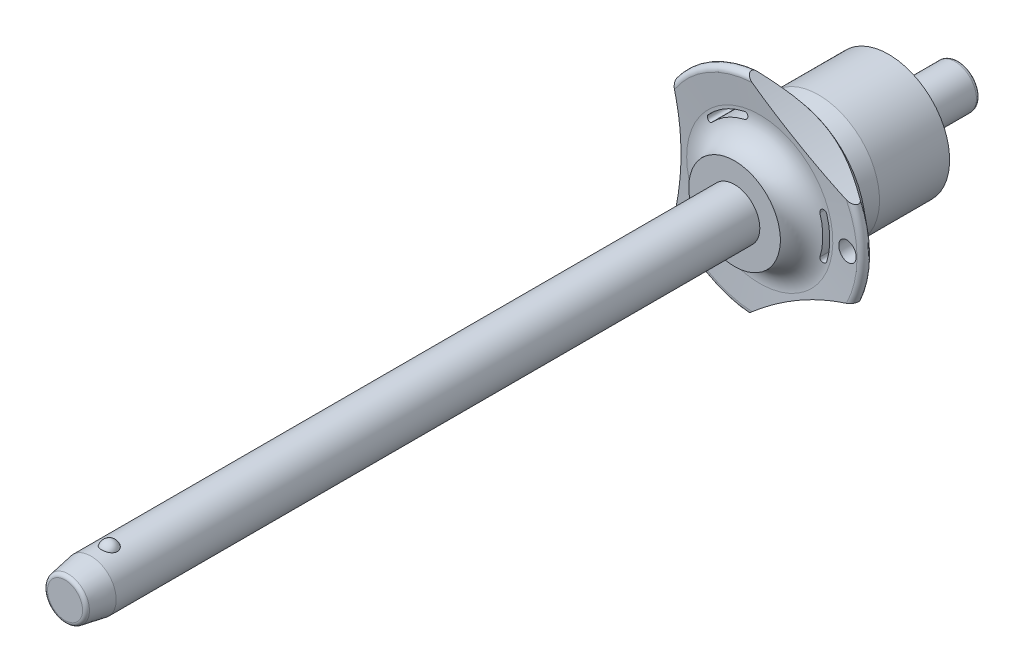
ISO-10303-21;
HEADER;
FILE_DESCRIPTION(('STEP AP214'),'2;1');
FILE_NAME('part.step','',(''),(''),'','','');
FILE_SCHEMA(('AUTOMOTIVE_DESIGN { 1 0 10303 214 1 1 1 1 }'));
ENDSEC;
DATA;
#1=APPLICATION_CONTEXT('core data for automotive mechanical design processes');
#2=APPLICATION_PROTOCOL_DEFINITION('international standard','automotive_design',2000,#1);
#3=PRODUCT_CONTEXT('',#1,'mechanical');
#4=PRODUCT('Part','Part','',(#3));
#5=PRODUCT_RELATED_PRODUCT_CATEGORY('part','',(#4));
#6=PRODUCT_DEFINITION_FORMATION('','',#4);
#7=PRODUCT_DEFINITION_CONTEXT('part definition',#1,'design');
#8=PRODUCT_DEFINITION('design','',#6,#7);
#9=PRODUCT_DEFINITION_SHAPE('','',#8);
#10=(LENGTH_UNIT() NAMED_UNIT(*) SI_UNIT(.MILLI.,.METRE.));
#11=(NAMED_UNIT(*) PLANE_ANGLE_UNIT() SI_UNIT($,.RADIAN.));
#12=(NAMED_UNIT(*) SI_UNIT($,.STERADIAN.) SOLID_ANGLE_UNIT());
#13=UNCERTAINTY_MEASURE_WITH_UNIT(LENGTH_MEASURE(1.E-05),#10,'distance_accuracy_value','');
#14=(GEOMETRIC_REPRESENTATION_CONTEXT(3) GLOBAL_UNCERTAINTY_ASSIGNED_CONTEXT((#13)) GLOBAL_UNIT_ASSIGNED_CONTEXT((#10,
#11,#12)) REPRESENTATION_CONTEXT('',''));
#15=CARTESIAN_POINT('',(0.,0.,0.));
#16=DIRECTION('',(0.,0.,1.));
#17=DIRECTION('',(1.,0.,0.));
#18=AXIS2_PLACEMENT_3D('',#15,#16,#17);
#19=CARTESIAN_POINT('',(0.,0.,-102.25));
#20=DIRECTION('',(0.,0.,-1.));
#21=DIRECTION('',(-1.,0.,0.));
#22=AXIS2_PLACEMENT_3D('',#19,#20,#21);
#23=TOROIDAL_SURFACE('',#22,15.8,0.8);
#24=CARTESIAN_POINT('',(-1.49270745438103,16.2455577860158,-102.863035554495));
#25=CARTESIAN_POINT('',(-1.52389763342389,16.2728541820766,-102.837869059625));
#26=CARTESIAN_POINT('',(-1.55388477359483,16.2991741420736,-102.809749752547));
#27=CARTESIAN_POINT('',(-1.61036647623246,16.348856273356,-102.747402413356));
#28=CARTESIAN_POINT('',(-1.63683006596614,16.3721921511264,-102.713125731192));
#29=CARTESIAN_POINT('',(-1.67985598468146,16.4102022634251,-102.646096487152));
#30=CARTESIAN_POINT('',(-1.69734050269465,16.4256758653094,-102.614401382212));
#31=CARTESIAN_POINT('',(-1.72812962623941,16.4529546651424,-102.547673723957));
#32=CARTESIAN_POINT('',(-1.74144647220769,16.4647706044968,-102.512651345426));
#33=CARTESIAN_POINT('',(-1.76322875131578,16.48411171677,-102.439615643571));
#34=CARTESIAN_POINT('',(-1.77165090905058,16.4915986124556,-102.401578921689));
#35=CARTESIAN_POINT('',(-1.7827920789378,16.5015048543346,-102.324014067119));
#36=CARTESIAN_POINT('',(-1.78551200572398,16.5039250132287,-102.284486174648));
#37=CARTESIAN_POINT('',(-1.78505109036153,16.5035150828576,-102.210618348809));
#38=CARTESIAN_POINT('',(-1.78258613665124,16.5013219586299,-102.176266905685));
#39=CARTESIAN_POINT('',(-1.77332954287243,16.4930910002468,-102.108638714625));
#40=CARTESIAN_POINT('',(-1.76653867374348,16.4870538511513,-102.075361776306));
#41=CARTESIAN_POINT('',(-1.74911857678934,16.4715812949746,-102.011009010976));
#42=CARTESIAN_POINT('',(-1.73852368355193,16.4621762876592,-101.97991637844));
#43=CARTESIAN_POINT('',(-1.7140204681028,16.4404504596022,-101.920164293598));
#44=CARTESIAN_POINT('',(-1.70011057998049,16.4281282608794,-101.891505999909));
#45=CARTESIAN_POINT('',(-1.66330482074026,16.3955695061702,-101.825843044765));
#46=CARTESIAN_POINT('',(-1.63905450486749,16.374151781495,-101.790180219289));
#47=CARTESIAN_POINT('',(-1.58648321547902,16.3278316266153,-101.724576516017));
#48=CARTESIAN_POINT('',(-1.55815427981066,16.3029223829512,-101.694647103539));
#49=CARTESIAN_POINT('',(-1.48812496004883,16.2415084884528,-101.630918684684));
#50=CARTESIAN_POINT('',(-1.4452133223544,16.2039954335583,-101.599427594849));
#51=CARTESIAN_POINT('',(-1.35603807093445,16.1263398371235,-101.545948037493));
#52=CARTESIAN_POINT('',(-1.30976966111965,16.0861935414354,-101.523973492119));
#53=CARTESIAN_POINT('',(-1.19950643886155,15.9909043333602,-101.482867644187));
#54=CARTESIAN_POINT('',(-1.13473079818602,15.9352116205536,-101.467108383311));
#55=CARTESIAN_POINT('',(-1.00380242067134,15.8232579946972,-101.449565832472));
#56=CARTESIAN_POINT('',(-0.937648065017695,15.7669964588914,-101.447800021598));
#57=CARTESIAN_POINT('',(-0.804514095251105,15.6543851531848,-101.457518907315));
#58=CARTESIAN_POINT('',(-0.737539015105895,15.5980494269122,-101.469224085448));
#59=CARTESIAN_POINT('',(-0.605520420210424,15.4875978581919,-101.506166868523));
#60=CARTESIAN_POINT('',(-0.540475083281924,15.4334799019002,-101.531391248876));
#61=CARTESIAN_POINT('',(-0.432668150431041,15.3442331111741,-101.586861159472));
#62=CARTESIAN_POINT('',(-0.388886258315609,15.3081260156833,-101.61356542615));
#63=CARTESIAN_POINT('',(-0.30464238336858,15.2388815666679,-101.674938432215));
#64=CARTESIAN_POINT('',(-0.264175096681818,15.2057394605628,-101.709594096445));
#65=CARTESIAN_POINT('',(-0.20029274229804,15.1535728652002,-101.775647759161));
#66=CARTESIAN_POINT('',(-0.175475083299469,15.1333526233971,-101.80473729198));
#67=CARTESIAN_POINT('',(-0.129461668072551,15.0959288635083,-101.867407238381));
#68=CARTESIAN_POINT('',(-0.108260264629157,15.0787206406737,-101.900980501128));
#69=CARTESIAN_POINT('',(-0.0753969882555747,15.0520829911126,-101.964045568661));
#70=CARTESIAN_POINT('',(-0.0626658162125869,15.0417770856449,-101.992603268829));
#71=CARTESIAN_POINT('',(-0.0409583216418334,15.0242179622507,-102.052010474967));
#72=CARTESIAN_POINT('',(-0.0319786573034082,15.0169620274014,-102.082857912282));
#73=CARTESIAN_POINT('',(-0.0184811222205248,15.0060595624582,-102.146452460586));
#74=CARTESIAN_POINT('',(-0.0140028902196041,15.002445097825,-102.179213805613));
#75=CARTESIAN_POINT('',(-0.0101438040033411,14.9993301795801,-102.245229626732));
#76=CARTESIAN_POINT('',(-0.0107604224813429,14.9998276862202,-102.27848385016));
#77=CARTESIAN_POINT('',(-0.0165942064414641,15.0045369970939,-102.339860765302));
#78=CARTESIAN_POINT('',(-0.0211975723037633,15.0082532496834,-102.368084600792));
#79=CARTESIAN_POINT('',(-0.0338045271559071,15.0184375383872,-102.423217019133));
#80=CARTESIAN_POINT('',(-0.0418074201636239,15.0249050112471,-102.450125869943));
#81=CARTESIAN_POINT('',(-0.063979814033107,15.0428397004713,-102.511232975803));
#82=CARTESIAN_POINT('',(-0.0793254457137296,15.0552630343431,-102.544721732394));
#83=CARTESIAN_POINT('',(-0.114028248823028,15.0834022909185,-102.608205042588));
#84=CARTESIAN_POINT('',(-0.133407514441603,15.0991363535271,-102.638178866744));
#85=CARTESIAN_POINT('',(-0.183817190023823,15.1401401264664,-102.706300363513));
#86=CARTESIAN_POINT('',(-0.216326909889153,15.1666427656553,-102.742609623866));
#87=CARTESIAN_POINT('',(-0.267595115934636,15.2085632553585,-102.791694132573));
#88=CARTESIAN_POINT('',(-0.284969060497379,15.2227887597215,-102.807067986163));
#89=CARTESIAN_POINT('',(-0.320429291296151,15.2518659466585,-102.836214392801));
#90=CARTESIAN_POINT('',(-0.338513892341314,15.266716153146,-102.849990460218));
#91=CARTESIAN_POINT('',(-0.356904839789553,15.2818411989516,-102.863035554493));
#92=B_SPLINE_CURVE_WITH_KNOTS('',3,(#24,#25,#26,#27,#28,#29,#30,#31,#32,#33,#34,#35,#36,#37,#38,
#39,#40,#41,#42,#43,#44,#45,#46,#47,#48,#49,#50,#51,#52,#53,#54,#55,#56,#57,#58,#59,#60,#61,#62,
#63,#64,#65,#66,#67,#68,#69,#70,#71,#72,#73,#74,#75,#76,#77,#78,#79,#80,#81,#82,#83,#84,#85,#86,
#87,#88,#89,#90,#91),.UNSPECIFIED.,.F.,.F.,(4,2,2,2,2,2,2,2,2,2,2,2,2,2,2,2,2,2,2,2,2,2,2,2,2,2,
2,2,2,2,2,2,2,4),(0.,0.145691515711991,0.292589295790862,0.410213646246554,0.527489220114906,
0.645786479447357,0.76406476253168,0.867086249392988,0.970089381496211,1.07218527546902,
1.17432949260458,1.31798900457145,1.46193286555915,1.65622269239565,1.85079580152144,
2.11003370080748,2.36959536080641,2.63346645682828,2.89707990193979,3.08473275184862,
3.27207921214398,3.40147244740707,3.53066173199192,3.62906309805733,3.7273766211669,
3.82654848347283,3.92567115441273,4.01179738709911,4.09790599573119,4.2138856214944,
4.33051808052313,4.49602656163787,4.57762374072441,4.6590378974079),.UNSPECIFIED.);
#93=CARTESIAN_POINT('',(-1.49295503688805,16.2457744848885,-102.862835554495));
#94=VERTEX_POINT('',#93);
#95=CARTESIAN_POINT('',(-0.872335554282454,15.7117519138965,-101.452568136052));
#96=VERTEX_POINT('',#95);
#97=EDGE_CURVE('E323',#94,#96,#92,.T.);
#98=ORIENTED_EDGE('',*,*,#97,.F.);
#99=CARTESIAN_POINT('',(0.,0.,-102.862835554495));
#100=DIRECTION('',(0.,0.,-1.));
#101=DIRECTION('',(-1.,0.,0.));
#102=AXIS2_PLACEMENT_3D('',#99,#100,#101);
#103=CIRCLE('',#102,16.3142300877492);
#104=CARTESIAN_POINT('',(-13.3227758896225,9.41582423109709,-102.862835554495));
#105=VERTEX_POINT('',#104);
#106=EDGE_CURVE('E223',#105,#94,#103,.T.);
#107=ORIENTED_EDGE('',*,*,#106,.F.);
#108=CARTESIAN_POINT('',(-13.0822913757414,8.10658632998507,-102.937162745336));
#109=CARTESIAN_POINT('',(-13.0777613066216,8.07986574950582,-102.926472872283));
#110=CARTESIAN_POINT('',(-13.0733058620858,8.05344811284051,-102.914997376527));
#111=CARTESIAN_POINT('',(-13.0645375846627,8.00120241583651,-102.890323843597));
#112=CARTESIAN_POINT('',(-13.0602258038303,7.97537901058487,-102.87711559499));
#113=CARTESIAN_POINT('',(-13.0478904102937,7.90114256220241,-102.835914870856));
#114=CARTESIAN_POINT('',(-13.0401276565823,7.85395899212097,-102.805559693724));
#115=CARTESIAN_POINT('',(-13.0255853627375,7.76482125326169,-102.737775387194));
#116=CARTESIAN_POINT('',(-13.0188034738,7.72285462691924,-102.700363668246));
#117=CARTESIAN_POINT('',(-13.0087713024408,7.66034209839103,-102.632428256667));
#118=CARTESIAN_POINT('',(-13.0051187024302,7.63745923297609,-102.604123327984));
#119=CARTESIAN_POINT('',(-12.9985586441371,7.59620631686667,-102.544303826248));
#120=CARTESIAN_POINT('',(-12.9956501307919,7.57782987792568,-102.512793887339));
#121=CARTESIAN_POINT('',(-12.9911823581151,7.54952737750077,-102.452460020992));
#122=CARTESIAN_POINT('',(-12.9894785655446,7.53870062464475,-102.424073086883));
#123=CARTESIAN_POINT('',(-12.9868350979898,7.52188159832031,-102.365860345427));
#124=CARTESIAN_POINT('',(-12.98589483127,7.51588558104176,-102.336035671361));
#125=CARTESIAN_POINT('',(-12.9848529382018,7.50924060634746,-102.275643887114));
#126=CARTESIAN_POINT('',(-12.9847548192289,7.50861401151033,-102.245074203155));
#127=CARTESIAN_POINT('',(-12.9854155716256,7.51282923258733,-102.184324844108));
#128=CARTESIAN_POINT('',(-12.9861746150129,7.51767214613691,-102.154145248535));
#129=CARTESIAN_POINT('',(-12.9884127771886,7.53192250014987,-102.096905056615));
#130=CARTESIAN_POINT('',(-12.9898449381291,7.54103215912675,-102.069766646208));
#131=CARTESIAN_POINT('',(-12.9933152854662,7.56304726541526,-102.017133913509));
#132=CARTESIAN_POINT('',(-12.9953537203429,7.57595426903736,-101.991640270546));
#133=CARTESIAN_POINT('',(-13.0011128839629,7.61229913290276,-101.930005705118));
#134=CARTESIAN_POINT('',(-13.005160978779,7.63774791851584,-101.895081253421));
#135=CARTESIAN_POINT('',(-13.0141294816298,7.69377777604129,-101.829749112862));
#136=CARTESIAN_POINT('',(-13.0190521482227,7.72437212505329,-101.799353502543));
#137=CARTESIAN_POINT('',(-13.0321614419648,7.80528186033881,-101.728873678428));
#138=CARTESIAN_POINT('',(-13.0407558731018,7.85785175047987,-101.691462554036));
#139=CARTESIAN_POINT('',(-13.0589660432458,7.96797444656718,-101.625310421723));
#140=CARTESIAN_POINT('',(-13.0685836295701,8.02553622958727,-101.596585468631));
#141=CARTESIAN_POINT('',(-13.0925327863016,8.16719325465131,-101.537233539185));
#142=CARTESIAN_POINT('',(-13.1072265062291,8.25279279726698,-101.510331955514));
#143=CARTESIAN_POINT('',(-13.1376466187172,8.42706715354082,-101.470855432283));
#144=CARTESIAN_POINT('',(-13.1533742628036,8.51574563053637,-101.458298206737));
#145=CARTESIAN_POINT('',(-13.1857087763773,8.69510369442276,-101.44752280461));
#146=CARTESIAN_POINT('',(-13.2023247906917,8.78579400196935,-101.449505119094));
#147=CARTESIAN_POINT('',(-13.2357535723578,8.96537221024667,-101.469295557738));
#148=CARTESIAN_POINT('',(-13.2525658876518,9.05426330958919,-101.487072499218));
#149=CARTESIAN_POINT('',(-13.2801815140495,9.19817203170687,-101.531394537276));
#150=CARTESIAN_POINT('',(-13.2911319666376,9.25466343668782,-101.553090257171));
#151=CARTESIAN_POINT('',(-13.3124583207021,9.36370324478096,-101.605050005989));
#152=CARTESIAN_POINT('',(-13.3228350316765,9.41625724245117,-101.635301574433));
#153=CARTESIAN_POINT('',(-13.3402139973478,9.50359190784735,-101.696822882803));
#154=CARTESIAN_POINT('',(-13.3474381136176,9.53965584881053,-101.72620228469));
#155=CARTESIAN_POINT('',(-13.360943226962,9.6067292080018,-101.790463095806));
#156=CARTESIAN_POINT('',(-13.367225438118,9.63774513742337,-101.825337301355));
#157=CARTESIAN_POINT('',(-13.3773736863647,9.68764727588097,-101.893062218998));
#158=CARTESIAN_POINT('',(-13.3814720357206,9.70771925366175,-101.925000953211));
#159=CARTESIAN_POINT('',(-13.3885776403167,9.74243605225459,-101.991835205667));
#160=CARTESIAN_POINT('',(-13.3915854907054,9.75708383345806,-102.026729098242));
#161=CARTESIAN_POINT('',(-13.3963158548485,9.78008866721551,-102.098894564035));
#162=CARTESIAN_POINT('',(-13.3980298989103,9.78840427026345,-102.136180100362));
#163=CARTESIAN_POINT('',(-13.399994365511,9.79793296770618,-102.211686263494));
#164=CARTESIAN_POINT('',(-13.4002455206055,9.79914961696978,-102.249906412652));
#165=CARTESIAN_POINT('',(-13.3993184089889,9.79465417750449,-102.321740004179));
#166=CARTESIAN_POINT('',(-13.3982919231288,9.78967781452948,-102.355404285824));
#167=CARTESIAN_POINT('',(-13.3951334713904,9.77433971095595,-102.421417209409));
#168=CARTESIAN_POINT('',(-13.3930014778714,9.76397783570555,-102.453765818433));
#169=CARTESIAN_POINT('',(-13.3877199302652,9.73824500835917,-102.516930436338));
#170=CARTESIAN_POINT('',(-13.3845539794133,9.72279330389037,-102.547711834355));
#171=CARTESIAN_POINT('',(-13.3773846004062,9.68769049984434,-102.606654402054));
#172=CARTESIAN_POINT('',(-13.3733807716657,9.66803739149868,-102.634814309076));
#173=CARTESIAN_POINT('',(-13.3625175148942,9.61451118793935,-102.701705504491));
#174=CARTESIAN_POINT('',(-13.3552346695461,9.57845758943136,-102.738630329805));
#175=CARTESIAN_POINT('',(-13.3396465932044,9.50075596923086,-102.805804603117));
#176=CARTESIAN_POINT('',(-13.3313386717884,9.4590931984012,-102.836035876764));
#177=CARTESIAN_POINT('',(-13.311440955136,9.35854720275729,-102.898311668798));
#178=CARTESIAN_POINT('',(-13.2996257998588,9.29830012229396,-102.928071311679));
#179=CARTESIAN_POINT('',(-13.2755139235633,9.17400307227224,-102.977440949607));
#180=CARTESIAN_POINT('',(-13.2632172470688,9.10995345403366,-102.99705188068));
#181=CARTESIAN_POINT('',(-13.2438346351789,9.00784990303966,-103.020550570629));
#182=CARTESIAN_POINT('',(-13.2367870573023,8.97048944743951,-103.027572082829));
#183=CARTESIAN_POINT('',(-13.229755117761,8.93295879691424,-103.033173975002));
#184=B_SPLINE_CURVE_WITH_KNOTS('',3,(#108,#109,#110,#111,#112,#113,#114,#115,#116,#117,#118,
#119,#120,#121,#122,#123,#124,#125,#126,#127,#128,#129,#130,#131,#132,#133,#134,#135,#136,#137,
#138,#139,#140,#141,#142,#143,#144,#145,#146,#147,#148,#149,#150,#151,#152,#153,#154,#155,#156,
#157,#158,#159,#160,#161,#162,#163,#164,#165,#166,#167,#168,#169,#170,#171,#172,#173,#174,#175,
#176,#177,#178,#179,#180,#181,#182,#183),.UNSPECIFIED.,.F.,.F.,(4,2,2,2,2,2,2,2,2,2,2,2,2,2,2,2,
2,2,2,2,2,2,2,2,2,2,2,2,2,2,2,2,2,2,2,2,2,4),(0.,0.0873826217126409,0.175305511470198,
0.344660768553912,0.513603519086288,0.623009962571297,0.732260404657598,0.823171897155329,
0.914012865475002,1.00523198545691,1.09646941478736,1.18211791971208,1.26780157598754,
1.39727127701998,1.52708032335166,1.72127992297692,1.91583630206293,2.18719453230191,
2.45888750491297,2.734333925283,3.00923774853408,3.19315566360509,3.37680709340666,
3.51753699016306,3.65808390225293,3.77146250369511,3.88477913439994,3.99883128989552,
4.11282632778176,4.21448231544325,4.3161408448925,4.41949686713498,4.52290241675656,
4.67831605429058,4.83414663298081,5.03774525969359,5.24132510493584,5.3571641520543),.UNSPECIFIED.);
#185=CARTESIAN_POINT('',(-13.170608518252,8.61134070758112,-101.452568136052));
#186=VERTEX_POINT('',#185);
#187=EDGE_CURVE('E604',#186,#105,#184,.T.);
#188=ORIENTED_EDGE('',*,*,#187,.F.);
#189=CARTESIAN_POINT('',(0.,0.,-101.452568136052));
#190=DIRECTION('',(0.,0.,-1.));
#191=DIRECTION('',(-1.,0.,0.));
#192=AXIS2_PLACEMENT_3D('',#189,#190,#191);
#193=CIRCLE('',#192,15.73594984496);
#194=EDGE_CURVE('E206',#186,#96,#193,.T.);
#195=ORIENTED_EDGE('',*,*,#194,.T.);
#196=EDGE_LOOP('',(#98,#107,#188,#195));
#197=FACE_BOUND('',#196,.T.);
#198=ADVANCED_FACE('F41',(#197),#23,.T.);
#199=CARTESIAN_POINT('',(-0.356904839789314,-15.2818411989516,-102.863035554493));
#200=CARTESIAN_POINT('',(-0.337948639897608,-15.2662512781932,-102.849588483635));
#201=CARTESIAN_POINT('',(-0.319318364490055,-15.2509537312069,-102.835366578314));
#202=CARTESIAN_POINT('',(-0.282811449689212,-15.221020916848,-102.80522254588));
#203=CARTESIAN_POINT('',(-0.264936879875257,-15.2063874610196,-102.789296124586));
#204=CARTESIAN_POINT('',(-0.212311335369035,-15.1633644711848,-102.738423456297));
#205=CARTESIAN_POINT('',(-0.179040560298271,-15.136248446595,-102.700713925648));
#206=CARTESIAN_POINT('',(-0.12963212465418,-15.0960705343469,-102.632383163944));
#207=CARTESIAN_POINT('',(-0.111616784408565,-15.0814460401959,-102.604033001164));
#208=CARTESIAN_POINT('',(-0.0791832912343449,-15.0551487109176,-102.544205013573));
#209=CARTESIAN_POINT('',(-0.0647490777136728,-15.0434626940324,-102.512742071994));
#210=CARTESIAN_POINT('',(-0.0424941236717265,-15.0254599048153,-102.452467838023));
#211=CARTESIAN_POINT('',(-0.033971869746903,-15.0185726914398,-102.424089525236));
#212=CARTESIAN_POINT('',(-0.0207257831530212,-15.0078721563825,-102.365877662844));
#213=CARTESIAN_POINT('',(-0.016001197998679,-15.0040582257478,-102.336044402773));
#214=CARTESIAN_POINT('',(-0.0107665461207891,-14.9998327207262,-102.275642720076));
#215=CARTESIAN_POINT('',(-0.0102730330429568,-14.9994345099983,-102.245071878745));
#216=CARTESIAN_POINT('',(-0.0135934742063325,-15.0021146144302,-102.184322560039));
#217=CARTESIAN_POINT('',(-0.0174079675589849,-15.0051933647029,-102.154144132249));
#218=CARTESIAN_POINT('',(-0.0286298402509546,-15.0142566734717,-102.096905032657));
#219=CARTESIAN_POINT('',(-0.0358029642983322,-15.0200517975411,-102.069766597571));
#220=CARTESIAN_POINT('',(-0.0531334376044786,-15.0340647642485,-102.0171338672));
#221=CARTESIAN_POINT('',(-0.0632920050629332,-15.0422835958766,-101.991640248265));
#222=CARTESIAN_POINT('',(-0.0918879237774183,-15.0654435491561,-101.930005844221));
#223=CARTESIAN_POINT('',(-0.111903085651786,-15.0816736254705,-101.895081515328));
#224=CARTESIAN_POINT('',(-0.155942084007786,-15.1174554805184,-101.829749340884));
#225=CARTESIAN_POINT('',(-0.179976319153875,-15.1370158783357,-101.799353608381));
#226=CARTESIAN_POINT('',(-0.243491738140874,-15.1888238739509,-101.728873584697));
#227=CARTESIAN_POINT('',(-0.284721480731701,-15.2225518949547,-101.691462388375));
#228=CARTESIAN_POINT('',(-0.370985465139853,-15.2933837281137,-101.625310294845));
#229=CARTESIAN_POINT('',(-0.416026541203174,-15.3304936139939,-101.596585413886));
#230=CARTESIAN_POINT('',(-0.526730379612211,-15.4220625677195,-101.53723357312));
#231=CARTESIAN_POINT('',(-0.593514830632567,-15.4775874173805,-101.510332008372));
#232=CARTESIAN_POINT('',(-0.729230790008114,-15.5910691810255,-101.470855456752));
#233=CARTESIAN_POINT('',(-0.79816484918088,-15.6490290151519,-101.458298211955));
#234=CARTESIAN_POINT('',(-0.937326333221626,-15.7667106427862,-101.447522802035));
#235=CARTESIAN_POINT('',(-1.00755846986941,-15.8264457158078,-101.449505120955));
#236=CARTESIAN_POINT('',(-1.14636336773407,-15.9451849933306,-101.469295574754));
#237=CARTESIAN_POINT('',(-1.21493912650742,-16.0041904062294,-101.487072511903));
#238=CARTESIAN_POINT('',(-1.32575988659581,-16.1000605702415,-101.531394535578));
#239=CARTESIAN_POINT('',(-1.36920764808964,-16.1377896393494,-101.553090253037));
#240=CARTESIAN_POINT('',(-1.45297571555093,-16.2107787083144,-101.605050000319));
#241=CARTESIAN_POINT('',(-1.49330046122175,-16.2460422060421,-101.635301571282));
#242=CARTESIAN_POINT('',(-1.56024496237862,-16.3047601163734,-101.696822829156));
#243=CARTESIAN_POINT('',(-1.58786514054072,-16.3290483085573,-101.72620216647));
#244=CARTESIAN_POINT('',(-1.63919983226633,-16.3742807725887,-101.79046295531));
#245=CARTESIAN_POINT('',(-1.66291936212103,-16.3952293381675,-101.82533722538));
#246=CARTESIAN_POINT('',(-1.70106203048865,-16.4289692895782,-101.893062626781));
#247=CARTESIAN_POINT('',(-1.7163958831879,-16.4425547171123,-101.925001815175));
#248=CARTESIAN_POINT('',(-1.74290859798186,-16.4660666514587,-101.991836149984));
#249=CARTESIAN_POINT('',(-1.75408983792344,-16.4759952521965,-102.026729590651));
#250=CARTESIAN_POINT('',(-1.77164670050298,-16.4915936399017,-102.098892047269));
#251=CARTESIAN_POINT('',(-1.77799093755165,-16.4972356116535,-102.136174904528));
#252=CARTESIAN_POINT('',(-1.78526153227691,-16.5037018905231,-102.21168094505));
#253=CARTESIAN_POINT('',(-1.78618985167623,-16.5045279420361,-102.249903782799));
#254=CARTESIAN_POINT('',(-1.78275968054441,-16.5014768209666,-102.321749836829));
#255=CARTESIAN_POINT('',(-1.77896156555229,-16.4980981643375,-102.355423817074));
#256=CARTESIAN_POINT('',(-1.76725509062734,-16.487691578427,-102.42143616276));
#257=CARTESIAN_POINT('',(-1.75934901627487,-16.4806656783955,-102.453775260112));
#258=CARTESIAN_POINT('',(-1.73971875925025,-16.4632379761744,-102.516895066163));
#259=CARTESIAN_POINT('',(-1.72793595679,-16.4527843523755,-102.54764288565));
#260=CARTESIAN_POINT('',(-1.70112596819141,-16.4290286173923,-102.606593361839));
#261=CARTESIAN_POINT('',(-1.68609016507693,-16.4157189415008,-102.634788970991));
#262=CARTESIAN_POINT('',(-1.64504748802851,-16.3794428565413,-102.701878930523));
#263=CARTESIAN_POINT('',(-1.61734756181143,-16.3550056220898,-102.738931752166));
#264=CARTESIAN_POINT('',(-1.55776221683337,-16.3025773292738,-102.806104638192));
#265=CARTESIAN_POINT('',(-1.52590395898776,-16.2746093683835,-102.836266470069));
#266=CARTESIAN_POINT('',(-1.49270745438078,-16.2455577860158,-102.863035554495));
#267=B_SPLINE_CURVE_WITH_KNOTS('',3,(#199,#200,#201,#202,#203,#204,#205,#206,#207,#208,#209,
#210,#211,#212,#213,#214,#215,#216,#217,#218,#219,#220,#221,#222,#223,#224,#225,#226,#227,#228,
#229,#230,#231,#232,#233,#234,#235,#236,#237,#238,#239,#240,#241,#242,#243,#244,#245,#246,#247,
#248,#249,#250,#251,#252,#253,#254,#255,#256,#257,#258,#259,#260,#261,#262,#263,#264,#265,#266),
.UNSPECIFIED.,.F.,.F.,(4,2,2,2,2,2,2,2,2,2,2,2,2,2,2,2,2,2,2,2,2,2,2,2,2,2,2,2,2,2,2,2,2,4),(0.,
0.0839131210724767,0.168042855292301,0.338401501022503,0.447980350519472,0.557058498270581,
0.647943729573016,0.738810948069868,0.830033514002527,0.921267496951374,1.00691607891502,
1.09259965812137,1.22206887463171,1.35187840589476,1.54607843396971,1.7406343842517,
2.01199234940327,2.28368558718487,2.55913213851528,2.83403583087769,3.01795372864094,
3.20160517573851,3.34233479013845,3.48288198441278,3.59626211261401,3.70957721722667,
3.82362146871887,3.93762440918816,4.03930992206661,4.14093891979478,4.24418127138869,
4.3477005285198,4.503808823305,4.65894421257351),.UNSPECIFIED.);
#268=CARTESIAN_POINT('',(-0.872335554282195,-15.7117519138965,-101.452568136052));
#269=VERTEX_POINT('',#268);
#270=CARTESIAN_POINT('',(-1.49295503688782,-16.2457744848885,-102.862835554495));
#271=VERTEX_POINT('',#270);
#272=EDGE_CURVE('E174',#269,#271,#267,.T.);
#273=ORIENTED_EDGE('',*,*,#272,.F.);
#274=CARTESIAN_POINT('',(-13.170608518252,-8.61134070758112,-101.452568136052));
#275=VERTEX_POINT('',#274);
#276=EDGE_CURVE('E190',#269,#275,#193,.T.);
#277=ORIENTED_EDGE('',*,*,#276,.T.);
#278=CARTESIAN_POINT('',(-13.229755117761,-8.93295879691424,-103.033173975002));
#279=CARTESIAN_POINT('',(-13.2420902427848,-8.99881663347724,-103.023328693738));
#280=CARTESIAN_POINT('',(-13.2545072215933,-9.06429386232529,-103.009094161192));
#281=CARTESIAN_POINT('',(-13.2789994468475,-9.19208173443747,-102.971094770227));
#282=CARTESIAN_POINT('',(-13.2910760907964,-9.25440656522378,-102.947377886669));
#283=CARTESIAN_POINT('',(-13.3095731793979,-9.3489329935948,-102.901764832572));
#284=CARTESIAN_POINT('',(-13.3162315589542,-9.38275584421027,-102.883317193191));
#285=CARTESIAN_POINT('',(-13.3308082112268,-9.45641140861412,-102.837697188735));
#286=CARTESIAN_POINT('',(-13.3386267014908,-9.49563999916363,-102.809496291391));
#287=CARTESIAN_POINT('',(-13.3533947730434,-9.56931268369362,-102.747135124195));
#288=CARTESIAN_POINT('',(-13.3603444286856,-9.60375718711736,-102.712975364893));
#289=CARTESIAN_POINT('',(-13.3717193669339,-9.6598754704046,-102.646126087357));
#290=CARTESIAN_POINT('',(-13.3763722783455,-9.68272846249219,-102.614470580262));
#291=CARTESIAN_POINT('',(-13.3846037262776,-9.72304176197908,-102.547752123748));
#292=CARTESIAN_POINT('',(-13.3881830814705,-9.74050617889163,-102.512691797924));
#293=CARTESIAN_POINT('',(-13.3940460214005,-9.76906105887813,-102.439605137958));
#294=CARTESIAN_POINT('',(-13.3963191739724,-9.78010021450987,-102.401557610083));
#295=CARTESIAN_POINT('',(-13.3993267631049,-9.79469759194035,-102.323992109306));
#296=CARTESIAN_POINT('',(-13.4000622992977,-9.79826115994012,-102.284475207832));
#297=CARTESIAN_POINT('',(-13.3999377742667,-9.79765716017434,-102.21062035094));
#298=CARTESIAN_POINT('',(-13.3992710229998,-9.79442624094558,-102.176270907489));
#299=CARTESIAN_POINT('',(-13.3967712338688,-9.78229496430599,-102.10864259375));
#300=CARTESIAN_POINT('',(-13.394938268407,-9.77339495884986,-102.075363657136));
#301=CARTESIAN_POINT('',(-13.3902485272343,-9.75057164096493,-102.01100864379));
#302=CARTESIAN_POINT('',(-13.3874009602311,-9.73669350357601,-101.979915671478));
#303=CARTESIAN_POINT('',(-13.3808374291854,-9.70461008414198,-101.920163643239));
#304=CARTESIAN_POINT('',(-13.3771210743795,-9.6864028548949,-101.891505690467));
#305=CARTESIAN_POINT('',(-13.3673273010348,-9.63824902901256,-101.825843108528));
#306=CARTESIAN_POINT('',(-13.3609041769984,-9.60653883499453,-101.790180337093));
#307=CARTESIAN_POINT('',(-13.3470753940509,-9.53785070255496,-101.72457661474));
#308=CARTESIAN_POINT('',(-13.3396678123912,-9.50086244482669,-101.694647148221));
#309=CARTESIAN_POINT('',(-13.3214964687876,-9.40950827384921,-101.63091869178));
#310=CARTESIAN_POINT('',(-13.3104650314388,-9.35358918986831,-101.599427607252));
#311=CARTESIAN_POINT('',(-13.2878009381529,-9.2375333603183,-101.545948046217));
#312=CARTESIAN_POINT('',(-13.2761674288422,-9.17739058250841,-101.523973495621));
#313=CARTESIAN_POINT('',(-13.2487761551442,-9.03425517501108,-101.482867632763));
#314=CARTESIAN_POINT('',(-13.2329326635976,-8.95031142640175,-101.46710836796));
#315=CARTESIAN_POINT('',(-13.2014421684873,-8.7809473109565,-101.449565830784));
#316=CARTESIAN_POINT('',(-13.185795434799,-8.6955252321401,-101.447800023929));
#317=CARTESIAN_POINT('',(-13.1548381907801,-8.52392230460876,-101.457518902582));
#318=CARTESIAN_POINT('',(-13.1395375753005,-8.43775240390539,-101.469224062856));
#319=CARTESIAN_POINT('',(-13.1098930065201,-8.26819515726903,-101.506166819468));
#320=CARTESIAN_POINT('',(-13.0955481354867,-8.18480518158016,-101.531391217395));
#321=CARTESIAN_POINT('',(-13.0721615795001,-8.04681804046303,-101.58686120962));
#322=CARTESIAN_POINT('',(-13.062782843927,-7.99084814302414,-101.613565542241));
#323=CARTESIAN_POINT('',(-13.0449373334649,-7.88326860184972,-101.674938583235));
#324=CARTESIAN_POINT('',(-13.0364690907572,-7.83165197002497,-101.709594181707));
#325=CARTESIAN_POINT('',(-13.0232327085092,-7.75024516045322,-101.775647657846));
#326=CARTESIAN_POINT('',(-13.0181303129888,-7.71864242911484,-101.804737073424));
#327=CARTESIAN_POINT('',(-13.0087270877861,-7.66008172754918,-101.867406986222));
#328=CARTESIAN_POINT('',(-13.0044250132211,-7.63311654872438,-101.900980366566));
#329=CARTESIAN_POINT('',(-12.9977877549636,-7.59133719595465,-101.964045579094));
#330=CARTESIAN_POINT('',(-12.9952281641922,-7.57515871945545,-101.992603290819));
#331=CARTESIAN_POINT('',(-12.9908752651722,-7.54757991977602,-102.052010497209));
#332=CARTESIAN_POINT('',(-12.9890812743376,-7.5361753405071,-102.082857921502));
#333=CARTESIAN_POINT('',(-12.9863881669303,-7.51903449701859,-102.146453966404));
#334=CARTESIAN_POINT('',(-12.98549704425,-7.51334887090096,-102.179216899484));
#335=CARTESIAN_POINT('',(-12.9847290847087,-7.5084499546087,-102.245232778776));
#336=CARTESIAN_POINT('',(-12.9848516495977,-7.50923284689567,-102.278485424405));
#337=CARTESIAN_POINT('',(-12.9860129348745,-7.5166383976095,-102.339851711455));
#338=CARTESIAN_POINT('',(-12.9869292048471,-7.52248050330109,-102.368066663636));
#339=CARTESIAN_POINT('',(-12.9894451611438,-7.53848793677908,-102.423199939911));
#340=CARTESIAN_POINT('',(-12.9910451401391,-7.54865511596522,-102.450117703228));
#341=CARTESIAN_POINT('',(-12.9954957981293,-7.57685575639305,-102.511293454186));
#342=CARTESIAN_POINT('',(-12.9985880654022,-7.59639602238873,-102.544836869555));
#343=CARTESIAN_POINT('',(-13.005609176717,-7.64053851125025,-102.608309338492));
#344=CARTESIAN_POINT('',(-13.0095398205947,-7.66515162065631,-102.638230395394));
#345=CARTESIAN_POINT('',(-13.0197842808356,-7.72893012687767,-102.705950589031));
#346=CARTESIAN_POINT('',(-13.0264151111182,-7.76992888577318,-102.741963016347));
#347=CARTESIAN_POINT('',(-13.0405875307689,-7.85675396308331,-102.807351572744));
#348=CARTESIAN_POINT('',(-13.0481306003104,-7.90258811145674,-102.836716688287));
#349=CARTESIAN_POINT('',(-13.0602242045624,-7.97536936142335,-102.877110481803));
#350=CARTESIAN_POINT('',(-13.0645344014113,-8.00118333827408,-102.890314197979));
#351=CARTESIAN_POINT('',(-13.0733026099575,-8.05342884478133,-102.91498890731));
#352=CARTESIAN_POINT('',(-13.0777596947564,-8.0798562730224,-102.926468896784));
#353=CARTESIAN_POINT('',(-13.0822913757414,-8.10658632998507,-102.937162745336));
#354=B_SPLINE_CURVE_WITH_KNOTS('',3,(#278,#279,#280,#281,#282,#283,#284,#285,#286,#287,#288,
#289,#290,#291,#292,#293,#294,#295,#296,#297,#298,#299,#300,#301,#302,#303,#304,#305,#306,#307,
#308,#309,#310,#311,#312,#313,#314,#315,#316,#317,#318,#319,#320,#321,#322,#323,#324,#325,#326,
#327,#328,#329,#330,#331,#332,#333,#334,#335,#336,#337,#338,#339,#340,#341,#342,#343,#344,#345,
#346,#347,#348,#349,#350,#351,#352,#353),.UNSPECIFIED.,.F.,.F.,(4,2,2,2,2,2,2,2,2,2,2,2,2,2,2,2,
2,2,2,2,2,2,2,2,2,2,2,2,2,2,2,2,2,2,2,2,2,4),(0.,0.203489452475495,0.405962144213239,
0.523066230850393,0.669367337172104,0.815655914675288,0.933150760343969,1.05055577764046,
1.16888588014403,1.28713132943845,1.39014683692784,1.49315594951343,1.59525299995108,
1.6973960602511,1.84105533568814,1.98499943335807,2.17928922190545,2.37386236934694,
2.63310039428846,2.89266192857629,3.15653276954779,3.42014646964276,3.60779972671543,
3.79514578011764,3.92453853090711,4.05372829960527,4.15212970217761,4.25044318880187,
4.34961971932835,4.44873772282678,4.53483670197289,4.62097257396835,4.73715255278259,
4.85358450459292,5.01766250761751,5.18201040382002,5.26990114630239,5.35731591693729),.UNSPECIFIED.);
#355=CARTESIAN_POINT('',(-13.3227758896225,-9.41582423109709,-102.862835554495));
#356=VERTEX_POINT('',#355);
#357=EDGE_CURVE('E606',#356,#275,#354,.T.);
#358=ORIENTED_EDGE('',*,*,#357,.F.);
#359=EDGE_CURVE('E192',#271,#356,#103,.T.);
#360=ORIENTED_EDGE('',*,*,#359,.F.);
#361=EDGE_LOOP('',(#273,#277,#358,#360));
#362=FACE_BOUND('',#361,.T.);
#363=ADVANCED_FACE('F188',(#362),#23,.T.);
#364=CARTESIAN_POINT('',(0.,0.,-111.1));
#365=DIRECTION('',(0.,0.,-1.));
#366=DIRECTION('',(-1.,0.,0.));
#367=AXIS2_PLACEMENT_3D('',#364,#365,#366);
#368=CONICAL_SURFACE('',#367,9.65,0.174532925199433);
#369=CARTESIAN_POINT('',(0.,0.,-105.034692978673));
#370=DIRECTION('',(0.,0.,-1.));
#371=DIRECTION('',(-1.,0.,0.));
#372=AXIS2_PLACEMENT_3D('',#369,#370,#371);
#373=CIRCLE('',#372,8.58052272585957);
#374=CARTESIAN_POINT('',(0.,8.58052272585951,-105.034692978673));
#375=VERTEX_POINT('',#374);
#376=EDGE_CURVE('E615',#375,#375,#373,.F.);
#377=ORIENTED_EDGE('',*,*,#376,.F.);
#378=EDGE_LOOP('',(#377));
#379=FACE_BOUND('',#378,.T.);
#380=CARTESIAN_POINT('',(0.,0.,-111.1));
#381=DIRECTION('',(0.,0.,-1.));
#382=DIRECTION('',(-1.,0.,0.));
#383=AXIS2_PLACEMENT_3D('',#380,#381,#382);
#384=CIRCLE('',#383,9.65);
#385=CARTESIAN_POINT('',(-9.65,0.,-111.1));
#386=VERTEX_POINT('',#385);
#387=EDGE_CURVE('E257',#386,#386,#384,.T.);
#388=ORIENTED_EDGE('',*,*,#387,.F.);
#389=EDGE_LOOP('',(#388));
#390=FACE_BOUND('',#389,.T.);
#391=ADVANCED_FACE('F305',(#379,#390),#368,.T.);
#392=CARTESIAN_POINT('',(0.,0.,-122.2));
#393=DIRECTION('',(0.,0.,-1.));
#394=DIRECTION('',(-1.,0.,0.));
#395=AXIS2_PLACEMENT_3D('',#392,#393,#394);
#396=CYLINDRICAL_SURFACE('',#395,9.65);
#397=ORIENTED_EDGE('',*,*,#387,.T.);
#398=EDGE_LOOP('',(#397));
#399=FACE_BOUND('',#398,.T.);
#400=CARTESIAN_POINT('',(0.,0.,-122.2));
#401=DIRECTION('',(0.,0.,-1.));
#402=DIRECTION('',(-1.,0.,0.));
#403=AXIS2_PLACEMENT_3D('',#400,#401,#402);
#404=CIRCLE('',#403,9.65);
#405=CARTESIAN_POINT('',(-9.65,0.,-122.2));
#406=VERTEX_POINT('',#405);
#407=EDGE_CURVE('E253',#406,#406,#404,.T.);
#408=ORIENTED_EDGE('',*,*,#407,.F.);
#409=EDGE_LOOP('',(#408));
#410=FACE_BOUND('',#409,.T.);
#411=ADVANCED_FACE('F737',(#399,#410),#396,.T.);
#412=CARTESIAN_POINT('',(0.,9.65,-122.2));
#413=DIRECTION('',(0.,0.,-1.));
#414=DIRECTION('',(-1.,0.,0.));
#415=AXIS2_PLACEMENT_3D('',#412,#413,#414);
#416=PLANE('',#415);
#417=CARTESIAN_POINT('',(0.,0.,-122.2));
#418=DIRECTION('',(0.,0.,-1.));
#419=DIRECTION('',(-1.,0.,0.));
#420=AXIS2_PLACEMENT_3D('',#417,#418,#419);
#421=CIRCLE('',#420,3.4);
#422=CARTESIAN_POINT('',(-3.4,0.,-122.2));
#423=VERTEX_POINT('',#422);
#424=EDGE_CURVE('E261',#423,#423,#421,.T.);
#425=ORIENTED_EDGE('',*,*,#424,.F.);
#426=EDGE_LOOP('',(#425));
#427=FACE_BOUND('',#426,.T.);
#428=ORIENTED_EDGE('',*,*,#407,.T.);
#429=EDGE_LOOP('',(#428));
#430=FACE_BOUND('',#429,.T.);
#431=ADVANCED_FACE('F509',(#427,#430),#416,.T.);
#432=CARTESIAN_POINT('',(0.,0.,-133.3));
#433=DIRECTION('',(0.,0.,-1.));
#434=DIRECTION('',(-1.,0.,0.));
#435=AXIS2_PLACEMENT_3D('',#432,#433,#434);
#436=PLANE('',#435);
#437=CARTESIAN_POINT('',(0.,0.,-133.3));
#438=DIRECTION('',(0.,0.,-1.));
#439=DIRECTION('',(-1.,0.,0.));
#440=AXIS2_PLACEMENT_3D('',#437,#438,#439);
#441=CIRCLE('',#440,2.8);
#442=CARTESIAN_POINT('',(-2.8,0.,-133.3));
#443=VERTEX_POINT('',#442);
#444=EDGE_CURVE('E602',#443,#443,#441,.T.);
#445=ORIENTED_EDGE('',*,*,#444,.T.);
#446=EDGE_LOOP('',(#445));
#447=FACE_BOUND('',#446,.T.);
#448=ADVANCED_FACE('F705',(#447),#436,.T.);
#449=CARTESIAN_POINT('',(0.,0.,-132.7));
#450=DIRECTION('',(0.,0.,-1.));
#451=DIRECTION('',(-1.,0.,0.));
#452=AXIS2_PLACEMENT_3D('',#449,#450,#451);
#453=TOROIDAL_SURFACE('',#452,2.8,0.6);
#454=CARTESIAN_POINT('',(0.,0.,-132.7));
#455=DIRECTION('',(0.,0.,-1.));
#456=DIRECTION('',(-1.,0.,0.));
#457=AXIS2_PLACEMENT_3D('',#454,#455,#456);
#458=CIRCLE('',#457,3.4);
#459=CARTESIAN_POINT('',(-3.4,0.,-132.7));
#460=VERTEX_POINT('',#459);
#461=EDGE_CURVE('E598',#460,#460,#458,.F.);
#462=ORIENTED_EDGE('',*,*,#461,.F.);
#463=EDGE_LOOP('',(#462));
#464=FACE_BOUND('',#463,.T.);
#465=ORIENTED_EDGE('',*,*,#444,.F.);
#466=EDGE_LOOP('',(#465));
#467=FACE_BOUND('',#466,.T.);
#468=ADVANCED_FACE('F703',(#464,#467),#453,.T.);
#469=CARTESIAN_POINT('',(0.,0.,-133.3));
#470=DIRECTION('',(0.,0.,1.));
#471=DIRECTION('',(1.,0.,0.));
#472=AXIS2_PLACEMENT_3D('',#469,#470,#471);
#473=CYLINDRICAL_SURFACE('',#472,3.4);
#474=ORIENTED_EDGE('',*,*,#424,.T.);
#475=EDGE_LOOP('',(#474));
#476=FACE_BOUND('',#475,.T.);
#477=ORIENTED_EDGE('',*,*,#461,.T.);
#478=EDGE_LOOP('',(#477));
#479=FACE_BOUND('',#478,.T.);
#480=ADVANCED_FACE('F507',(#476,#479),#473,.T.);
#481=CARTESIAN_POINT('',(0.,0.,-97.8));
#482=DIRECTION('',(0.,0.,-1.));
#483=DIRECTION('',(-1.,0.,0.));
#484=AXIS2_PLACEMENT_3D('',#481,#482,#483);
#485=TOROIDAL_SURFACE('',#484,11.25,4.);
#486=CARTESIAN_POINT('',(-7.45553996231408,-6.85806794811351,-101.640018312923));
#487=CARTESIAN_POINT('',(-7.473297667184,-6.83869966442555,-101.639996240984));
#488=CARTESIAN_POINT('',(-7.49266981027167,-6.82083740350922,-101.640666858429));
#489=CARTESIAN_POINT('',(-7.53396122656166,-6.7885650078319,-101.643262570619));
#490=CARTESIAN_POINT('',(-7.55587464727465,-6.77414716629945,-101.645184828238));
#491=CARTESIAN_POINT('',(-7.60164963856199,-6.74911431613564,-101.650153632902));
#492=CARTESIAN_POINT('',(-7.62551093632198,-6.73849877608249,-101.653200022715));
#493=CARTESIAN_POINT('',(-7.67451876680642,-6.72128997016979,-101.660196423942));
#494=CARTESIAN_POINT('',(-7.69966567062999,-6.71469787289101,-101.664146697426));
#495=CARTESIAN_POINT('',(-7.75118238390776,-6.70554866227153,-101.672798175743));
#496=CARTESIAN_POINT('',(-7.77756704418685,-6.70309000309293,-101.677514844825));
#497=CARTESIAN_POINT('',(-7.83031133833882,-6.70252586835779,-101.687344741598));
#498=CARTESIAN_POINT('',(-7.85667096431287,-6.70442148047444,-101.692458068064));
#499=CARTESIAN_POINT('',(-7.90960919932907,-6.71263749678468,-101.702986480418));
#500=CARTESIAN_POINT('',(-7.93616352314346,-6.71910954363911,-101.708405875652));
#501=CARTESIAN_POINT('',(-7.98781881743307,-6.7364685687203,-101.719099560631));
#502=CARTESIAN_POINT('',(-8.01291976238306,-6.74735562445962,-101.724373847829));
#503=CARTESIAN_POINT('',(-8.06117820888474,-6.77338280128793,-101.734591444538));
#504=CARTESIAN_POINT('',(-8.08431712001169,-6.78855872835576,-101.739531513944));
#505=CARTESIAN_POINT('',(-8.12771506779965,-6.82272393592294,-101.748851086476));
#506=CARTESIAN_POINT('',(-8.1479742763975,-6.84171298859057,-101.753230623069));
#507=CARTESIAN_POINT('',(-8.18470243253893,-6.88267095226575,-101.761256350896));
#508=CARTESIAN_POINT('',(-8.20122312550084,-6.90459150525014,-101.764912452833));
#509=CARTESIAN_POINT('',(-8.2303262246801,-6.95100141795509,-101.771527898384));
#510=CARTESIAN_POINT('',(-8.24290903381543,-6.9754905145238,-101.774487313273));
#511=CARTESIAN_POINT('',(-8.26354687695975,-7.02588250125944,-101.779681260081));
#512=CARTESIAN_POINT('',(-8.27167589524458,-7.05175392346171,-101.781927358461));
#513=CARTESIAN_POINT('',(-8.28347105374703,-7.10453678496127,-101.785824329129));
#514=CARTESIAN_POINT('',(-8.28713754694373,-7.13144814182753,-101.787475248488));
#515=CARTESIAN_POINT('',(-8.2898750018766,-7.18533227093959,-101.790262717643));
#516=CARTESIAN_POINT('',(-8.28897916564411,-7.21230317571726,-101.791402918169));
#517=CARTESIAN_POINT('',(-8.28268342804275,-7.26573572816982,-101.7932874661));
#518=CARTESIAN_POINT('',(-8.27728231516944,-7.29219723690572,-101.794031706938));
#519=CARTESIAN_POINT('',(-8.26211990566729,-7.34386813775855,-101.795219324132));
#520=CARTESIAN_POINT('',(-8.25235525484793,-7.3690765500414,-101.795662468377));
#521=CARTESIAN_POINT('',(-8.22874773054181,-7.41747151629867,-101.796323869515));
#522=CARTESIAN_POINT('',(-8.21491036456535,-7.44066074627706,-101.796542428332));
#523=CARTESIAN_POINT('',(-8.18784055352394,-7.47843993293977,-101.796760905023));
#524=CARTESIAN_POINT('',(-8.17546895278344,-7.49365230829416,-101.796804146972));
#525=CARTESIAN_POINT('',(-8.16220949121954,-7.50803611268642,-101.796806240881));
#526=B_SPLINE_CURVE_WITH_KNOTS('',3,(#486,#487,#488,#489,#490,#491,#492,#493,#494,#495,#496,
#497,#498,#499,#500,#501,#502,#503,#504,#505,#506,#507,#508,#509,#510,#511,#512,#513,#514,#515,
#516,#517,#518,#519,#520,#521,#522,#523,#524,#525),.UNSPECIFIED.,.F.,.F.,(4,2,2,2,2,2,2,2,2,2,2,
2,2,2,2,2,2,2,2,4),(0.,0.0787049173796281,0.157232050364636,0.235748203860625,0.314287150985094,
0.394671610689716,0.47507615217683,0.558277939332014,0.64148118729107,0.725400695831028,
0.80931519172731,0.891985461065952,0.97464726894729,1.05589074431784,1.13712779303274,
1.21777449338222,1.29844288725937,1.37917339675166,1.45979523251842,1.51846884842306),.UNSPECIFIED.);
#527=CARTESIAN_POINT('',(-7.45573996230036,-6.85785037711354,-101.640018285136));
#528=VERTEX_POINT('',#527);
#529=CARTESIAN_POINT('',(-8.16239355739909,-7.50783611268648,-101.796806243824));
#530=VERTEX_POINT('',#529);
#531=EDGE_CURVE('E580',#528,#530,#526,.T.);
#532=ORIENTED_EDGE('',*,*,#531,.F.);
#533=CARTESIAN_POINT('',(0.,0.,-101.640018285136));
#534=DIRECTION('',(0.,0.,1.));
#535=DIRECTION('',(1.,0.,0.));
#536=AXIS2_PLACEMENT_3D('',#533,#534,#535);
#537=CIRCLE('',#536,10.1300626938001);
#538=CARTESIAN_POINT('',(-2.21120266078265,-9.88578539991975,-101.640018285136));
#539=VERTEX_POINT('',#538);
#540=EDGE_CURVE('E497',#539,#528,#537,.F.);
#541=ORIENTED_EDGE('',*,*,#540,.F.);
#542=CARTESIAN_POINT('',(-2.42098002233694,-10.8227134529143,-101.796806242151));
#543=CARTESIAN_POINT('',(-2.39466175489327,-10.8286356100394,-101.796800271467));
#544=CARTESIAN_POINT('',(-2.36784287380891,-10.8322938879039,-101.796720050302));
#545=CARTESIAN_POINT('',(-2.31398956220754,-10.8350801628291,-101.796364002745));
#546=CARTESIAN_POINT('',(-2.28695529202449,-10.8342112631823,-101.796088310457));
#547=CARTESIAN_POINT('',(-2.23340573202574,-10.8279472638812,-101.795294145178));
#548=CARTESIAN_POINT('',(-2.20689069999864,-10.8225499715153,-101.794775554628));
#549=CARTESIAN_POINT('',(-2.15515410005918,-10.8073916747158,-101.79341081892));
#550=CARTESIAN_POINT('',(-2.12993225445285,-10.7976316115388,-101.792564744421));
#551=CARTESIAN_POINT('',(-2.08151388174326,-10.7740399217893,-101.790447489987));
#552=CARTESIAN_POINT('',(-2.0583158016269,-10.7602114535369,-101.789176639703));
#553=CARTESIAN_POINT('',(-2.01458027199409,-10.728885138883,-101.786109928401));
#554=CARTESIAN_POINT('',(-1.99404317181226,-10.7113868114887,-101.784313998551));
#555=CARTESIAN_POINT('',(-1.95623896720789,-10.6732671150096,-101.780117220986));
#556=CARTESIAN_POINT('',(-1.93896738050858,-10.652650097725,-101.777717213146));
#557=CARTESIAN_POINT('',(-1.9081341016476,-10.6088874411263,-101.772261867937));
#558=CARTESIAN_POINT('',(-1.89457216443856,-10.585741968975,-101.769206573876));
#559=CARTESIAN_POINT('',(-1.87147477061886,-10.5375257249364,-101.762427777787));
#560=CARTESIAN_POINT('',(-1.86195174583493,-10.5124492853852,-101.75870226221));
#561=CARTESIAN_POINT('',(-1.84721771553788,-10.4611538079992,-101.750643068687));
#562=CARTESIAN_POINT('',(-1.84200709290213,-10.4349346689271,-101.74630933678));
#563=CARTESIAN_POINT('',(-1.83595837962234,-10.3817387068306,-101.737086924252));
#564=CARTESIAN_POINT('',(-1.83517791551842,-10.354756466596,-101.732191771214));
#565=CARTESIAN_POINT('',(-1.83812595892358,-10.3011022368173,-101.722068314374));
#566=CARTESIAN_POINT('',(-1.84185500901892,-10.2744302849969,-101.716839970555));
#567=CARTESIAN_POINT('',(-1.85381275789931,-10.2216153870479,-101.706178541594));
#568=CARTESIAN_POINT('',(-1.8621235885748,-10.1954914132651,-101.700743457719));
#569=CARTESIAN_POINT('',(-1.88307799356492,-10.1450032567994,-101.690044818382));
#570=CARTESIAN_POINT('',(-1.89572176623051,-10.1206391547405,-101.684781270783));
#571=CARTESIAN_POINT('',(-1.92510206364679,-10.0742293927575,-101.674711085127));
#572=CARTESIAN_POINT('',(-1.94185883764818,-10.0521959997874,-101.66990687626));
#573=CARTESIAN_POINT('',(-1.9790126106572,-10.0112417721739,-101.661108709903));
#574=CARTESIAN_POINT('',(-1.99941022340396,-9.99232146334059,-101.657114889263));
#575=CARTESIAN_POINT('',(-2.04275966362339,-9.95861934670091,-101.650321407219));
#576=CARTESIAN_POINT('',(-2.06563897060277,-9.94374959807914,-101.647495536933));
#577=CARTESIAN_POINT('',(-2.113651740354,-9.91808821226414,-101.643135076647));
#578=CARTESIAN_POINT('',(-2.13878085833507,-9.90728891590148,-101.641598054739));
#579=CARTESIAN_POINT('',(-2.18022693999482,-9.89351011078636,-101.640254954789));
#580=CARTESIAN_POINT('',(-2.19607519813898,-9.8891286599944,-101.640003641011));
#581=CARTESIAN_POINT('',(-2.21210085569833,-9.88558539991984,-101.640018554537));
#582=B_SPLINE_CURVE_WITH_KNOTS('',3,(#542,#543,#544,#545,#546,#547,#548,#549,#550,#551,#552,
#553,#554,#555,#556,#557,#558,#559,#560,#561,#562,#563,#564,#565,#566,#567,#568,#569,#570,#571,
#572,#573,#574,#575,#576,#577,#578,#579,#580,#581),.UNSPECIFIED.,.F.,.F.,(4,2,2,2,2,2,2,2,2,2,2,
2,2,2,2,2,2,2,2,4),(0.,0.0808219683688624,0.161588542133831,0.242394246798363,0.323182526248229,
0.403908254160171,0.484644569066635,0.565269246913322,0.645888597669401,0.72675432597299,
0.807627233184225,0.889549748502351,0.971482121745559,1.05493333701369,1.13838837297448,
1.22226282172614,1.30615142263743,1.38803928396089,1.46977228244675,1.5190092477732),.UNSPECIFIED.);
#583=CARTESIAN_POINT('',(-2.42078002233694,-10.8227582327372,-101.796806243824));
#584=VERTEX_POINT('',#583);
#585=EDGE_CURVE('E489',#584,#539,#582,.T.);
#586=ORIENTED_EDGE('',*,*,#585,.F.);
#587=CARTESIAN_POINT('',(0.,0.,-101.796806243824));
#588=DIRECTION('',(0.,0.,1.));
#589=DIRECTION('',(1.,0.,0.));
#590=AXIS2_PLACEMENT_3D('',#587,#588,#589);
#591=CIRCLE('',#590,11.0901880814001);
#592=EDGE_CURVE('E498',#530,#584,#591,.T.);
#593=ORIENTED_EDGE('',*,*,#592,.F.);
#594=EDGE_LOOP('',(#532,#541,#586,#593));
#595=FACE_BOUND('',#594,.T.);
#596=CARTESIAN_POINT('',(-2.21210085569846,9.88558539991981,-101.640018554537));
#597=CARTESIAN_POINT('',(-2.18644404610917,9.89124585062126,-101.639986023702));
#598=CARTESIAN_POINT('',(-2.1612810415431,9.8990577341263,-101.640646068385));
#599=CARTESIAN_POINT('',(-2.11266514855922,9.91861516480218,-101.643221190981));
#600=CARTESIAN_POINT('',(-2.08920852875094,9.93035179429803,-101.645133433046));
#601=CARTESIAN_POINT('',(-2.04460913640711,9.95741636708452,-101.650083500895));
#602=CARTESIAN_POINT('',(-2.02346604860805,9.9727438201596,-101.65312117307));
#603=CARTESIAN_POINT('',(-1.98401610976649,10.0065263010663,-101.660101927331));
#604=CARTESIAN_POINT('',(-1.96571008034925,10.0249822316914,-101.664045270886));
#605=CARTESIAN_POINT('',(-1.93197753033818,10.0649727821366,-101.672684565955));
#606=CARTESIAN_POINT('',(-1.91662855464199,10.0865694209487,-101.677395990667));
#607=CARTESIAN_POINT('',(-1.88970924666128,10.1319218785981,-101.687217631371));
#608=CARTESIAN_POINT('',(-1.87813986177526,10.1556782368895,-101.692327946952));
#609=CARTESIAN_POINT('',(-1.85871852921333,10.2055987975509,-101.7028528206));
#610=CARTESIAN_POINT('',(-1.8510102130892,10.2318180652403,-101.708271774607));
#611=CARTESIAN_POINT('',(-1.84014143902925,10.285211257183,-101.718966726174));
#612=CARTESIAN_POINT('',(-1.83698106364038,10.3123851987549,-101.724242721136));
#613=CARTESIAN_POINT('',(-1.83531342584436,10.3671862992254,-101.734466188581));
#614=CARTESIAN_POINT('',(-1.83684704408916,10.3948153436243,-101.739410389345));
#615=CARTESIAN_POINT('',(-1.84465746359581,10.4494927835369,-101.748739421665));
#616=CARTESIAN_POINT('',(-1.85093398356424,10.4765412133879,-101.753124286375));
#617=CARTESIAN_POINT('',(-1.8679658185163,10.5288535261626,-101.761161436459));
#618=CARTESIAN_POINT('',(-1.8786536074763,10.5541378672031,-101.764823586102));
#619=CARTESIAN_POINT('',(-1.90422655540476,10.6025861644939,-101.771451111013));
#620=CARTESIAN_POINT('',(-1.91911128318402,10.6257503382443,-101.774416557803));
#621=CARTESIAN_POINT('',(-1.95237365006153,10.6688685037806,-101.779621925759));
#622=CARTESIAN_POINT('',(-1.97068686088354,10.6888708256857,-101.781873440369));
#623=CARTESIAN_POINT('',(-2.01045050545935,10.7255347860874,-101.785780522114));
#624=CARTESIAN_POINT('',(-2.03190069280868,10.7421966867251,-101.78743613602));
#625=CARTESIAN_POINT('',(-2.07715692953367,10.7715737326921,-101.790232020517));
#626=CARTESIAN_POINT('',(-2.10094461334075,10.7843168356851,-101.791375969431));
#627=CARTESIAN_POINT('',(-2.15033681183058,10.8056502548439,-101.793267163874));
#628=CARTESIAN_POINT('',(-2.17594180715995,10.8142394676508,-101.794014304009));
#629=CARTESIAN_POINT('',(-2.22825324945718,10.827017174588,-101.795206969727));
#630=CARTESIAN_POINT('',(-2.25496050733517,10.8312023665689,-101.7956522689));
#631=CARTESIAN_POINT('',(-2.30866972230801,10.8350305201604,-101.79631748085));
#632=CARTESIAN_POINT('',(-2.33567123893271,10.8346795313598,-101.796537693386));
#633=CARTESIAN_POINT('',(-2.38213182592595,10.8301714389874,-101.796759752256));
#634=CARTESIAN_POINT('',(-2.40169537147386,10.827046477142,-101.796803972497));
#635=CARTESIAN_POINT('',(-2.42098002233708,10.8227134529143,-101.796806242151));
#636=B_SPLINE_CURVE_WITH_KNOTS('',3,(#596,#597,#598,#599,#600,#601,#602,#603,#604,#605,#606,
#607,#608,#609,#610,#611,#612,#613,#614,#615,#616,#617,#618,#619,#620,#621,#622,#623,#624,#625,
#626,#627,#628,#629,#630,#631,#632,#633,#634,#635),.UNSPECIFIED.,.F.,.F.,(4,2,2,2,2,2,2,2,2,2,2,
2,2,2,2,2,2,2,2,4),(0.,0.0786962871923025,0.157214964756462,0.235722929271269,0.314253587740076,
0.394624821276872,0.475016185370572,0.558209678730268,0.641404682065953,0.725326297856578,
0.809242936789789,0.891920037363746,0.974588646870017,1.05583645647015,1.13707788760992,
1.21772550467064,1.2983945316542,1.37912400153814,1.45974581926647,1.5190256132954),.UNSPECIFIED.);
#637=CARTESIAN_POINT('',(-2.21120266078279,9.88578539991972,-101.640018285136));
#638=VERTEX_POINT('',#637);
#639=CARTESIAN_POINT('',(-2.4207800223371,10.8227582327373,-101.796806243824));
#640=VERTEX_POINT('',#639);
#641=EDGE_CURVE('E535',#638,#640,#636,.T.);
#642=ORIENTED_EDGE('',*,*,#641,.F.);
#643=CARTESIAN_POINT('',(0.,0.,-101.640018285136));
#644=DIRECTION('',(0.,0.,1.));
#645=DIRECTION('',(1.,0.,0.));
#646=AXIS2_PLACEMENT_3D('',#643,#644,#645);
#647=CIRCLE('',#646,10.1300626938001);
#648=CARTESIAN_POINT('',(-7.45573996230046,6.85785037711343,-101.640018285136));
#649=VERTEX_POINT('',#648);
#650=EDGE_CURVE('E541',#649,#638,#647,.F.);
#651=ORIENTED_EDGE('',*,*,#650,.F.);
#652=CARTESIAN_POINT('',(-8.16220949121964,7.50803611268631,-101.796806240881));
#653=CARTESIAN_POINT('',(-8.18050013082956,7.48820744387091,-101.79680041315));
#654=CARTESIAN_POINT('',(-8.19708071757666,7.46681305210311,-101.796720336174));
#655=CARTESIAN_POINT('',(-8.22642666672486,7.42157192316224,-101.796364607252));
#656=CARTESIAN_POINT('',(-8.23919463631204,7.39772687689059,-101.796089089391));
#657=CARTESIAN_POINT('',(-8.26055153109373,7.34822254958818,-101.795295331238));
#658=CARTESIAN_POINT('',(-8.26913842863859,7.32256239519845,-101.794776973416));
#659=CARTESIAN_POINT('',(-8.28188655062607,7.27017978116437,-101.793412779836));
#660=CARTESIAN_POINT('',(-8.28604872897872,7.24345755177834,-101.792567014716));
#661=CARTESIAN_POINT('',(-8.28983438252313,7.18973063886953,-101.790450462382));
#662=CARTESIAN_POINT('',(-8.28946136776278,7.16272618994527,-101.789180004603));
#663=CARTESIAN_POINT('',(-8.28420716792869,7.10918613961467,-101.786114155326));
#664=CARTESIAN_POINT('',(-8.27932539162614,7.08265060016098,-101.784318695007));
#665=CARTESIAN_POINT('',(-8.26522201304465,7.03084930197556,-101.780122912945));
#666=CARTESIAN_POINT('',(-8.25600642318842,7.00558183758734,-101.777723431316));
#667=CARTESIAN_POINT('',(-8.23353015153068,6.95699489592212,-101.772269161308));
#668=CARTESIAN_POINT('',(-8.22026973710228,6.93367529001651,-101.769214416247));
#669=CARTESIAN_POINT('',(-8.19006798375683,6.88956003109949,-101.762436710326));
#670=CARTESIAN_POINT('',(-8.17311553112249,6.86877230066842,-101.758711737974));
#671=CARTESIAN_POINT('',(-8.13606466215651,6.83035942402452,-101.750653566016));
#672=CARTESIAN_POINT('',(-8.11596596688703,6.81273455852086,-101.746320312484));
#673=CARTESIAN_POINT('',(-8.07292577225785,6.78089239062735,-101.737098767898));
#674=CARTESIAN_POINT('',(-8.04995077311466,6.7667222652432,-101.732204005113));
#675=CARTESIAN_POINT('',(-8.00201445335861,6.74244171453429,-101.722081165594));
#676=CARTESIAN_POINT('',(-7.97705289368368,6.73233177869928,-101.716853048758));
#677=CARTESIAN_POINT('',(-7.92533753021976,6.71627291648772,-101.706191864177));
#678=CARTESIAN_POINT('',(-7.89855907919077,6.71040460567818,-101.700756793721));
#679=CARTESIAN_POINT('',(-7.84435925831,6.70329999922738,-101.690057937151));
#680=CARTESIAN_POINT('',(-7.81693785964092,6.70206391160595,-101.684794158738));
#681=CARTESIAN_POINT('',(-7.76205565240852,6.70429529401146,-101.674723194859));
#682=CARTESIAN_POINT('',(-7.73459534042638,6.70778647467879,-101.669918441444));
#683=CARTESIAN_POINT('',(-7.68054938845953,6.71947776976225,-101.661118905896));
#684=CARTESIAN_POINT('',(-7.65396390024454,6.7276786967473,-101.657124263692));
#685=CARTESIAN_POINT('',(-7.60309887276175,6.74836230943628,-101.650328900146));
#686=CARTESIAN_POINT('',(-7.57877947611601,6.76073828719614,-101.647501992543));
#687=CARTESIAN_POINT('',(-7.53254499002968,6.78948186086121,-101.643139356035));
#688=CARTESIAN_POINT('',(-7.51062541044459,6.80584181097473,-101.641601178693));
#689=CARTESIAN_POINT('',(-7.47810477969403,6.83471777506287,-101.640262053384));
#690=CARTESIAN_POINT('',(-7.46651133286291,6.84611262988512,-101.640010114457));
#691=CARTESIAN_POINT('',(-7.45553996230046,6.85806794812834,-101.640018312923));
#692=B_SPLINE_CURVE_WITH_KNOTS('',3,(#652,#653,#654,#655,#656,#657,#658,#659,#660,#661,#662,
#663,#664,#665,#666,#667,#668,#669,#670,#671,#672,#673,#674,#675,#676,#677,#678,#679,#680,#681,
#682,#683,#684,#685,#686,#687,#688,#689,#690,#691),.UNSPECIFIED.,.F.,.F.,(4,2,2,2,2,2,2,2,2,2,2,
2,2,2,2,2,2,2,2,4),(0.,0.0808219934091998,0.161588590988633,0.242394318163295,0.323182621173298,
0.403908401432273,0.484644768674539,0.565269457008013,0.645888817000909,0.726754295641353,
0.807626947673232,0.889548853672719,0.971480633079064,1.05493134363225,1.13838580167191,
1.22226039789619,1.30614946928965,1.38803916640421,1.46977292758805,1.51845223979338),.UNSPECIFIED.);
#693=CARTESIAN_POINT('',(-8.16239355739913,7.50783611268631,-101.796806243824));
#694=VERTEX_POINT('',#693);
#695=EDGE_CURVE('E529',#694,#649,#692,.T.);
#696=ORIENTED_EDGE('',*,*,#695,.F.);
#697=CARTESIAN_POINT('',(0.,0.,-101.796806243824));
#698=DIRECTION('',(0.,0.,1.));
#699=DIRECTION('',(1.,0.,0.));
#700=AXIS2_PLACEMENT_3D('',#697,#698,#699);
#701=CIRCLE('',#700,11.0901880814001);
#702=EDGE_CURVE('E377',#640,#694,#701,.T.);
#703=ORIENTED_EDGE('',*,*,#702,.F.);
#704=EDGE_LOOP('',(#642,#651,#696,#703));
#705=FACE_BOUND('',#704,.T.);
#706=CARTESIAN_POINT('',(9.66700531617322,-3.02773502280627,-101.640018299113));
#707=CARTESIAN_POINT('',(9.65911510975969,-3.05279958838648,-101.63999766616));
#708=CARTESIAN_POINT('',(9.65333656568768,-3.07850888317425,-101.640669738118));
#709=CARTESIAN_POINT('',(9.64604287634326,-3.13040645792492,-101.643268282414));
#710=CARTESIAN_POINT('',(9.64451812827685,-3.1565935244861,-101.645191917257));
#711=CARTESIAN_POINT('',(9.64573610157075,-3.20875255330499,-101.650163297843));
#712=CARTESIAN_POINT('',(9.64847822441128,-3.2347245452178,-101.653210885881));
#713=CARTESIAN_POINT('',(9.65808838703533,-3.28576966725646,-101.660209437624));
#714=CARTESIAN_POINT('',(9.66495762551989,-3.31084253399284,-101.664160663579));
#715=CARTESIAN_POINT('',(9.68280193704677,-3.36002928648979,-101.672813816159));
#716=CARTESIAN_POINT('',(9.69386972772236,-3.38410677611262,-101.677531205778));
#717=CARTESIAN_POINT('',(9.71976251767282,-3.43006273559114,-101.687362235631));
#718=CARTESIAN_POINT('',(9.73458845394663,-3.45194065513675,-101.692475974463));
#719=CARTESIAN_POINT('',(9.7681814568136,-3.49367274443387,-101.703004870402));
#720=CARTESIAN_POINT('',(9.78706766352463,-3.51343006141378,-101.708424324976));
#721=CARTESIAN_POINT('',(9.8279363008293,-3.54947791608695,-101.719117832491));
#722=CARTESIAN_POINT('',(9.84991878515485,-3.56576839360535,-101.724391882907));
#723=CARTESIAN_POINT('',(9.89659422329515,-3.59453882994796,-101.734608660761));
#724=CARTESIAN_POINT('',(9.92130883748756,-3.60698485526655,-101.739548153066));
#725=CARTESIAN_POINT('',(9.97259981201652,-3.62747586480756,-101.748866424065));
#726=CARTESIAN_POINT('',(9.99917606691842,-3.63552109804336,-101.753245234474));
#727=CARTESIAN_POINT('',(10.0530131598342,-3.64683902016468,-101.761269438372));
#728=CARTESIAN_POINT('',(10.080258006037,-3.65018069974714,-101.764924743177));
#729=CARTESIAN_POINT('',(10.1350016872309,-3.65216890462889,-101.77153851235));
#730=CARTESIAN_POINT('',(10.1625004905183,-3.65081600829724,-101.774497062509));
#731=CARTESIAN_POINT('',(10.2164567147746,-3.64348265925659,-101.779689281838));
#732=CARTESIAN_POINT('',(10.2429239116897,-3.63758217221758,-101.781934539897));
#733=CARTESIAN_POINT('',(10.2945295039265,-3.62139618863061,-101.785830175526));
#734=CARTESIAN_POINT('',(10.3196678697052,-3.61111059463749,-101.787480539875));
#735=CARTESIAN_POINT('',(10.36770294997,-3.58652675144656,-101.790267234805));
#736=CARTESIAN_POINT('',(10.3906143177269,-3.5722575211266,-101.791407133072));
#737=CARTESIAN_POINT('',(10.4337331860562,-3.54007942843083,-101.793290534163));
#738=CARTESIAN_POINT('',(10.4539410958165,-3.52217111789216,-101.794034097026));
#739=CARTESIAN_POINT('',(10.4910817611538,-3.4832156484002,-101.795220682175));
#740=CARTESIAN_POINT('',(10.5080138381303,-3.46216784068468,-101.795663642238));
#741=CARTESIAN_POINT('',(10.5381206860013,-3.41752781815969,-101.796323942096));
#742=CARTESIAN_POINT('',(10.5512946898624,-3.393935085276,-101.796541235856));
#743=CARTESIAN_POINT('',(10.5735105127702,-3.34485123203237,-101.796797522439));
#744=CARTESIAN_POINT('',(10.5825484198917,-3.31935834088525,-101.796836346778));
#745=CARTESIAN_POINT('',(10.5962487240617,-3.26720452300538,-101.7967356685));
#746=CARTESIAN_POINT('',(10.6009079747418,-3.2405427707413,-101.79659603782));
#747=CARTESIAN_POINT('',(10.6032586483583,-3.21367104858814,-101.796367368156));
#748=B_SPLINE_CURVE_WITH_KNOTS('',3,(#706,#707,#708,#709,#710,#711,#712,#713,#714,#715,#716,
#717,#718,#719,#720,#721,#722,#723,#724,#725,#726,#727,#728,#729,#730,#731,#732,#733,#734,#735,
#736,#737,#738,#739,#740,#741,#742,#743,#744,#745,#746,#747),.UNSPECIFIED.,.F.,.F.,(4,2,2,2,2,2,
2,2,2,2,2,2,2,2,2,2,2,2,2,2,4),(0.,0.078706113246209,0.157234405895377,0.235751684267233,
0.314291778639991,0.394678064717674,0.4750844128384,0.558287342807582,0.641491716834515,
0.72541079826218,0.809325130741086,0.8919953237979,0.974655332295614,1.0558940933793,
1.13713465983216,1.21779821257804,1.29844954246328,1.37911756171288,1.45980203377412,
1.54056266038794,1.62138127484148),.UNSPECIFIED.);
#749=CARTESIAN_POINT('',(9.66694262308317,-3.02793502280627,-101.640018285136));
#750=VERTEX_POINT('',#749);
#751=CARTESIAN_POINT('',(10.5831735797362,-3.31492212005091,-101.796806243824));
#752=VERTEX_POINT('',#751);
#753=EDGE_CURVE('E211',#750,#752,#748,.T.);
#754=ORIENTED_EDGE('',*,*,#753,.F.);
#755=CARTESIAN_POINT('',(0.,0.,-101.640018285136));
#756=DIRECTION('',(0.,0.,1.));
#757=DIRECTION('',(1.,0.,0.));
#758=AXIS2_PLACEMENT_3D('',#755,#756,#757);
#759=CIRCLE('',#758,10.1300626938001);
#760=CARTESIAN_POINT('',(9.66694262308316,3.02793502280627,-101.640018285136));
#761=VERTEX_POINT('',#760);
#762=EDGE_CURVE('E589',#761,#750,#759,.F.);
#763=ORIENTED_EDGE('',*,*,#762,.F.);
#764=CARTESIAN_POINT('',(9.73755448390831,2.88805401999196,-101.647718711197));
#765=CARTESIAN_POINT('',(9.72210589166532,2.9091325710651,-101.645203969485));
#766=CARTESIAN_POINT('',(9.7083895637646,2.93154879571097,-101.643280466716));
#767=CARTESIAN_POINT('',(9.68476700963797,2.97834071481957,-101.640690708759));
#768=CARTESIAN_POINT('',(9.67485644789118,3.00271414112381,-101.640023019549));
#769=CARTESIAN_POINT('',(9.65914935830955,3.05277128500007,-101.640013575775));
#770=CARTESIAN_POINT('',(9.65335536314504,3.07845579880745,-101.640672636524));
#771=CARTESIAN_POINT('',(9.64603899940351,3.13035380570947,-101.643260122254));
#772=CARTESIAN_POINT('',(9.64451564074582,3.15656717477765,-101.645188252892));
#773=CARTESIAN_POINT('',(9.645737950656,3.20875165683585,-101.650164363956));
#774=CARTESIAN_POINT('',(9.64847856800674,3.23472301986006,-101.653211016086));
#775=CARTESIAN_POINT('',(9.65808749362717,3.28576827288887,-101.660208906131));
#776=CARTESIAN_POINT('',(9.66495723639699,3.31084184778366,-101.664160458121));
#777=CARTESIAN_POINT('',(9.68280284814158,3.36003140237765,-101.67281427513));
#778=CARTESIAN_POINT('',(9.69387166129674,3.38411089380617,-101.67753203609));
#779=CARTESIAN_POINT('',(9.71976501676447,3.43006648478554,-101.687363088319));
#780=CARTESIAN_POINT('',(9.73458985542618,3.45194241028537,-101.692476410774));
#781=CARTESIAN_POINT('',(9.76818075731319,3.49367186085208,-101.703004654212));
#782=CARTESIAN_POINT('',(9.78706609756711,3.51342842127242,-101.708423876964));
#783=CARTESIAN_POINT('',(9.82793447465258,3.54947656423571,-101.719117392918));
#784=CARTESIAN_POINT('',(9.84991782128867,3.56576779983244,-101.724391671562));
#785=CARTESIAN_POINT('',(9.8965945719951,3.59453904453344,-101.734608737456));
#786=CARTESIAN_POINT('',(9.92130957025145,3.60698522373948,-101.739548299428));
#787=CARTESIAN_POINT('',(9.97260059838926,3.6274761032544,-101.748866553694));
#788=CARTESIAN_POINT('',(9.99917646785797,3.63552118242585,-101.753245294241));
#789=CARTESIAN_POINT('',(10.0530130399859,3.64683899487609,-101.761269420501));
#790=CARTESIAN_POINT('',(10.0802577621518,3.6501806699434,-101.764924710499));
#791=CARTESIAN_POINT('',(10.1350014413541,3.65216891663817,-101.771538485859));
#792=CARTESIAN_POINT('',(10.1625003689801,3.65081602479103,-101.774497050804));
#793=CARTESIAN_POINT('',(10.2164567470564,3.64348265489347,-101.779689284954));
#794=CARTESIAN_POINT('',(10.2429239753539,3.63758215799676,-101.781934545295));
#795=CARTESIAN_POINT('',(10.2945295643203,3.62139616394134,-101.785830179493));
#796=CARTESIAN_POINT('',(10.3196678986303,3.6111105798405,-101.787480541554));
#797=CARTESIAN_POINT('',(10.3677029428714,3.58652675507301,-101.790267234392));
#798=CARTESIAN_POINT('',(10.390614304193,3.57225752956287,-101.791407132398));
#799=CARTESIAN_POINT('',(10.4337331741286,3.54007943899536,-101.793290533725));
#800=CARTESIAN_POINT('',(10.4539410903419,3.52217112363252,-101.794034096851));
#801=CARTESIAN_POINT('',(10.491081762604,3.48321564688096,-101.795220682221));
#802=CARTESIAN_POINT('',(10.5080138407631,3.46216783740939,-101.795663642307));
#803=CARTESIAN_POINT('',(10.5381206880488,3.41752781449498,-101.79632394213));
#804=CARTESIAN_POINT('',(10.5512946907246,3.39393508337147,-101.796541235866));
#805=CARTESIAN_POINT('',(10.5735105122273,3.34485123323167,-101.796797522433));
#806=CARTESIAN_POINT('',(10.5825484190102,3.31935834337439,-101.796836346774));
#807=CARTESIAN_POINT('',(10.5962487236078,3.26720452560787,-101.796735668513));
#808=CARTESIAN_POINT('',(10.6009079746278,3.24054277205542,-101.796596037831));
#809=CARTESIAN_POINT('',(10.6032586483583,3.21367104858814,-101.796367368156));
#810=B_SPLINE_CURVE_WITH_KNOTS('',3,(#764,#765,#766,#767,#768,#769,#770,#771,#772,#773,#774,
#775,#776,#777,#778,#779,#780,#781,#782,#783,#784,#785,#786,#787,#788,#789,#790,#791,#792,#793,
#794,#795,#796,#797,#798,#799,#800,#801,#802,#803,#804,#805,#806,#807,#808,#809),.UNSPECIFIED.,
.F.,.F.,(4,2,2,2,2,2,2,2,2,2,2,2,2,2,2,2,2,2,2,2,2,2,4),(0.,0.0786679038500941,
0.157245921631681,0.235872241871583,0.31448033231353,0.39299537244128,0.471537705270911,
0.551930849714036,0.632330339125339,0.715529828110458,0.798737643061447,0.882657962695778,
0.966571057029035,1.0492408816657,1.13190125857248,1.21314011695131,1.29438058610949,
1.37504411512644,1.45569546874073,1.53636349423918,1.61704796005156,1.69780858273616,
1.7786272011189),.UNSPECIFIED.);
#811=CARTESIAN_POINT('',(10.5831735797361,3.31492212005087,-101.796806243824));
#812=VERTEX_POINT('',#811);
#813=EDGE_CURVE('E514',#812,#761,#810,.F.);
#814=ORIENTED_EDGE('',*,*,#813,.F.);
#815=CARTESIAN_POINT('',(0.,0.,-101.796806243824));
#816=DIRECTION('',(0.,0.,1.));
#817=DIRECTION('',(1.,0.,0.));
#818=AXIS2_PLACEMENT_3D('',#815,#816,#817);
#819=CIRCLE('',#818,11.0901880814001);
#820=EDGE_CURVE('E587',#752,#812,#819,.T.);
#821=ORIENTED_EDGE('',*,*,#820,.F.);
#822=EDGE_LOOP('',(#754,#763,#814,#821));
#823=FACE_BOUND('',#822,.T.);
#824=CARTESIAN_POINT('',(0.,0.,-97.8));
#825=DIRECTION('',(0.,0.,-1.));
#826=DIRECTION('',(-1.,0.,0.));
#827=AXIS2_PLACEMENT_3D('',#824,#825,#826);
#828=CIRCLE('',#827,7.25);
#829=CARTESIAN_POINT('',(-7.25,0.,-97.8));
#830=VERTEX_POINT('',#829);
#831=EDGE_CURVE('E247',#830,#830,#828,.T.);
#832=ORIENTED_EDGE('',*,*,#831,.T.);
#833=EDGE_LOOP('',(#832));
#834=FACE_BOUND('',#833,.T.);
#835=CARTESIAN_POINT('',(0.,0.,-101.787159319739));
#836=DIRECTION('',(0.,0.,-1.));
#837=DIRECTION('',(-1.,0.,0.));
#838=AXIS2_PLACEMENT_3D('',#835,#836,#837);
#839=CIRCLE('',#838,11.5702507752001);
#840=CARTESIAN_POINT('',(-11.5702507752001,0.,-101.787159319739));
#841=VERTEX_POINT('',#840);
#842=EDGE_CURVE('E204',#841,#841,#839,.T.);
#843=ORIENTED_EDGE('',*,*,#842,.F.);
#844=EDGE_LOOP('',(#843));
#845=FACE_BOUND('',#844,.T.);
#846=ADVANCED_FACE('F501',(#595,#705,#823,#834,#845),#485,.F.);
#847=CARTESIAN_POINT('',(0.,0.,-97.8));
#848=DIRECTION('',(0.,0.,1.));
#849=DIRECTION('',(1.,0.,0.));
#850=AXIS2_PLACEMENT_3D('',#847,#848,#849);
#851=PLANE('',#850);
#852=CARTESIAN_POINT('',(0.,0.,-97.8));
#853=DIRECTION('',(0.,0.,1.));
#854=DIRECTION('',(1.,0.,0.));
#855=AXIS2_PLACEMENT_3D('',#852,#853,#854);
#856=CIRCLE('',#855,4.);
#857=CARTESIAN_POINT('',(4.,0.,-97.8));
#858=VERTEX_POINT('',#857);
#859=EDGE_CURVE('E609',#858,#858,#856,.F.);
#860=ORIENTED_EDGE('',*,*,#859,.T.);
#861=EDGE_LOOP('',(#860));
#862=FACE_BOUND('',#861,.T.);
#863=ORIENTED_EDGE('',*,*,#831,.F.);
#864=EDGE_LOOP('',(#863));
#865=FACE_BOUND('',#864,.T.);
#866=ADVANCED_FACE('F506',(#862,#865),#851,.T.);
#867=CARTESIAN_POINT('',(0.,0.,-116.862003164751));
#868=DIRECTION('',(0.,0.,-1.));
#869=DIRECTION('',(0.,1.,0.));
#870=AXIS2_PLACEMENT_3D('',#867,#868,#869);
#871=SPHERICAL_SURFACE('',#870,14.612003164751);
#872=CARTESIAN_POINT('',(0.,0.,-106.261488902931));
#873=DIRECTION('',(0.,0.,-1.));
#874=DIRECTION('',(-1.,0.,0.));
#875=AXIS2_PLACEMENT_3D('',#872,#873,#874);
#876=CIRCLE('',#875,10.0568252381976);
#877=CARTESIAN_POINT('',(0.,10.0568252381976,-106.261488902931));
#878=VERTEX_POINT('',#877);
#879=EDGE_CURVE('E240',#878,#878,#876,.T.);
#880=CARTESIAN_POINT('',(0.,8.58052272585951,-105.034692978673));
#881=CARTESIAN_POINT('',(0.,8.59671869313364,-105.046442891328));
#882=CARTESIAN_POINT('',(0.,8.61289052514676,-105.058226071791));
#883=CARTESIAN_POINT('',(0.,8.64518564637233,-105.081858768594));
#884=CARTESIAN_POINT('',(0.,8.66130893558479,-105.093708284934));
#885=CARTESIAN_POINT('',(0.,8.69350669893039,-105.117473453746));
#886=CARTESIAN_POINT('',(0.,8.70958117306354,-105.129389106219));
#887=CARTESIAN_POINT('',(0.,8.74168103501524,-105.153286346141));
#888=CARTESIAN_POINT('',(0.,8.75770642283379,-105.165267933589));
#889=CARTESIAN_POINT('',(0.,8.78970784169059,-105.189296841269));
#890=CARTESIAN_POINT('',(0.,8.80568387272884,-105.201344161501));
#891=CARTESIAN_POINT('',(0.,8.83758630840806,-105.225504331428));
#892=CARTESIAN_POINT('',(0.,8.85351271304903,-105.237617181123));
#893=CARTESIAN_POINT('',(0.,8.88531562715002,-105.261908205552));
#894=CARTESIAN_POINT('',(0.,8.90119213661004,-105.274086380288));
#895=CARTESIAN_POINT('',(0.,8.93289499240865,-105.298507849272));
#896=CARTESIAN_POINT('',(0.,8.94872133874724,-105.310751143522));
#897=CARTESIAN_POINT('',(0.,8.98032360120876,-105.335302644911));
#898=CARTESIAN_POINT('',(0.,8.99609951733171,-105.347610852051));
#899=CARTESIAN_POINT('',(0.,9.02760065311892,-105.372291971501));
#900=CARTESIAN_POINT('',(0.,9.04332587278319,-105.38466488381));
#901=CARTESIAN_POINT('',(0.,9.07472535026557,-105.409475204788));
#902=CARTESIAN_POINT('',(0.,9.09039960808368,-105.421912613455));
#903=CARTESIAN_POINT('',(0.,9.12169689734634,-105.446851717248));
#904=CARTESIAN_POINT('',(0.,9.13731992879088,-105.459353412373));
#905=CARTESIAN_POINT('',(0.,9.16851450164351,-105.484420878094));
#906=CARTESIAN_POINT('',(0.,9.1840860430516,-105.496986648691));
#907=CARTESIAN_POINT('',(0.,9.21517737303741,-105.522182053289));
#908=CARTESIAN_POINT('',(0.,9.23069716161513,-105.534811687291));
#909=CARTESIAN_POINT('',(0.,9.2616847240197,-105.560134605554));
#910=CARTESIAN_POINT('',(0.,9.27715249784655,-105.572827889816));
#911=CARTESIAN_POINT('',(0.,9.30803576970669,-105.598277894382));
#912=CARTESIAN_POINT('',(0.,9.32345126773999,-105.611034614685));
#913=CARTESIAN_POINT('',(0.,9.35422972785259,-105.636611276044));
#914=CARTESIAN_POINT('',(0.,9.3695926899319,-105.649431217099));
#915=CARTESIAN_POINT('',(0.,9.40026581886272,-105.675134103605));
#916=CARTESIAN_POINT('',(0.,9.41557598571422,-105.688017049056));
#917=CARTESIAN_POINT('',(0.,9.44614326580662,-105.713845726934));
#918=CARTESIAN_POINT('',(0.,9.46140037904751,-105.726791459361));
#919=CARTESIAN_POINT('',(0.,9.49186129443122,-105.752745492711));
#920=CARTESIAN_POINT('',(0.,9.50706509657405,-105.765753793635));
#921=CARTESIAN_POINT('',(0.,9.53741913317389,-105.791832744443));
#922=CARTESIAN_POINT('',(0.,9.5525693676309,-105.804903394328));
#923=CARTESIAN_POINT('',(0.,9.58281601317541,-105.831106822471));
#924=CARTESIAN_POINT('',(0.,9.59791242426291,-105.84423960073));
#925=CARTESIAN_POINT('',(0.,9.62805116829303,-105.870567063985));
#926=CARTESIAN_POINT('',(0.,9.64309350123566,-105.883761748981));
#927=CARTESIAN_POINT('',(0.,9.67312383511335,-105.910212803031));
#928=CARTESIAN_POINT('',(0.,9.68811183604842,-105.923469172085));
#929=CARTESIAN_POINT('',(0.,9.7180332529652,-105.950043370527));
#930=CARTESIAN_POINT('',(0.,9.73296666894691,-105.963361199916));
#931=CARTESIAN_POINT('',(0.,9.76277866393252,-105.99005809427));
#932=CARTESIAN_POINT('',(0.,9.7776572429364,-106.003437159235));
#933=CARTESIAN_POINT('',(0.,9.80735931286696,-106.030256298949));
#934=CARTESIAN_POINT('',(0.,9.82218280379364,-106.043696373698));
#935=CARTESIAN_POINT('',(0.,9.85177444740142,-106.070637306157));
#936=CARTESIAN_POINT('',(0.,9.86654260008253,-106.084138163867));
#937=CARTESIAN_POINT('',(0.,9.89602331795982,-106.111200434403));
#938=CARTESIAN_POINT('',(0.,9.910735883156,-106.12476184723));
#939=CARTESIAN_POINT('',(0.,9.94010517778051,-106.151944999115));
#940=CARTESIAN_POINT('',(0.,9.95476190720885,-106.165566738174));
#941=CARTESIAN_POINT('',(0.,9.98401928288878,-106.192870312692));
#942=CARTESIAN_POINT('',(0.,9.99861992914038,-106.206552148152));
#943=CARTESIAN_POINT('',(0.,10.0277648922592,-106.233975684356));
#944=CARTESIAN_POINT('',(0.,10.0423092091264,-106.247717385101));
#945=CARTESIAN_POINT('',(0.,10.0568252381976,-106.261488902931));
#946=B_SPLINE_CURVE_WITH_KNOTS('',3,(#880,#881,#882,#883,#884,#885,#886,#887,#888,#889,#890,
#891,#892,#893,#894,#895,#896,#897,#898,#899,#900,#901,#902,#903,#904,#905,#906,#907,#908,#909,
#910,#911,#912,#913,#914,#915,#916,#917,#918,#919,#920,#921,#922,#923,#924,#925,#926,#927,#928,
#929,#930,#931,#932,#933,#934,#935,#936,#937,#938,#939,#940,#941,#942,#943,#944,#945),
.UNSPECIFIED.,.F.,.F.,(4,2,2,2,2,2,2,2,2,2,2,2,2,2,2,2,2,2,2,2,2,2,2,2,2,2,2,2,2,2,2,2,4),(0.,
0.0600276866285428,0.120055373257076,0.180083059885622,0.240110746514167,0.300138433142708,
0.360166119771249,0.420193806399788,0.480221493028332,0.540249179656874,0.60027686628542,
0.660304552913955,0.7203322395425,0.78035992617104,0.840387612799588,0.900415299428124,
0.960442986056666,1.02047067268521,1.08049835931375,1.14052604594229,1.20055373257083,
1.26058141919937,1.32060910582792,1.38063679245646,1.44066447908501,1.50069216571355,
1.56071985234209,1.62074753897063,1.68077522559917,1.74080291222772,1.80083059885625,
1.86085828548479,1.92088597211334),.UNSPECIFIED.);
#947=EDGE_CURVE('BSEAM732',#375,#878,#946,.T.);
#948=ORIENTED_EDGE('',*,*,#376,.T.);
#949=ORIENTED_EDGE('',*,*,#879,.T.);
#950=ORIENTED_EDGE('',*,*,#947,.T.);
#951=ORIENTED_EDGE('',*,*,#947,.F.);
#952=EDGE_LOOP('',(#948,#950,#949,#951));
#953=FACE_BOUND('',#952,.T.);
#954=ADVANCED_FACE('F732',(#953),#871,.F.);
#955=CARTESIAN_POINT('',(0.,0.,-105.100742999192));
#956=DIRECTION('',(0.,0.,-1.));
#957=DIRECTION('',(-1.,0.,0.));
#958=AXIS2_PLACEMENT_3D('',#955,#956,#957);
#959=TOROIDAL_SURFACE('',#958,11.158037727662,1.6);
#960=CARTESIAN_POINT('',(-8.16220949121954,-7.50803611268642,-106.699303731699));
#961=CARTESIAN_POINT('',(-8.18047284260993,-7.48823718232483,-106.699287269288));
#962=CARTESIAN_POINT('',(-8.19703149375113,-7.46687652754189,-106.69921260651));
#963=CARTESIAN_POINT('',(-8.22634825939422,-7.42170504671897,-106.69882153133));
#964=CARTESIAN_POINT('',(-8.23910818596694,-7.39789539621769,-106.698505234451));
#965=CARTESIAN_POINT('',(-8.26046047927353,-7.34846529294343,-106.697505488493));
#966=CARTESIAN_POINT('',(-8.26905052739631,-7.32284384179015,-106.696821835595));
#967=CARTESIAN_POINT('',(-8.28181512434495,-7.27055195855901,-106.694859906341));
#968=CARTESIAN_POINT('',(-8.28599090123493,-7.24388182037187,-106.693581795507));
#969=CARTESIAN_POINT('',(-8.28981519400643,-7.19039046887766,-106.690171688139));
#970=CARTESIAN_POINT('',(-8.289483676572,-7.16357044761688,-106.688043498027));
#971=CARTESIAN_POINT('',(-8.28439101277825,-7.11046683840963,-106.682662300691));
#972=CARTESIAN_POINT('',(-8.27962983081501,-7.08418325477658,-106.679409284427));
#973=CARTESIAN_POINT('',(-8.26598721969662,-7.03327919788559,-106.67160025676));
#974=CARTESIAN_POINT('',(-8.25715904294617,-7.00864180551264,-106.667061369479));
#975=CARTESIAN_POINT('',(-8.23578326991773,-6.96138026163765,-106.656528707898));
#976=CARTESIAN_POINT('',(-8.22323610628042,-6.93875587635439,-106.650535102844));
#977=CARTESIAN_POINT('',(-8.19489725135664,-6.89604359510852,-106.637047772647));
#978=CARTESIAN_POINT('',(-8.17909602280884,-6.87596344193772,-106.629549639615));
#979=CARTESIAN_POINT('',(-8.14486948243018,-6.83884520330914,-106.613156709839));
#980=CARTESIAN_POINT('',(-8.12644347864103,-6.82180792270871,-106.604261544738));
#981=CARTESIAN_POINT('',(-8.0865275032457,-6.79021356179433,-106.584758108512));
#982=CARTESIAN_POINT('',(-8.0649261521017,-6.77583871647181,-106.574083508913));
#983=CARTESIAN_POINT('',(-8.02012089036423,-6.7509005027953,-106.55171556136));
#984=CARTESIAN_POINT('',(-7.9969165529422,-6.74033815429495,-106.540021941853));
#985=CARTESIAN_POINT('',(-7.94698111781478,-6.722173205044,-106.514752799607));
#986=CARTESIAN_POINT('',(-7.92013320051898,-6.71498858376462,-106.501107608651));
#987=CARTESIAN_POINT('',(-7.86566513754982,-6.7053253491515,-106.473614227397));
#988=CARTESIAN_POINT('',(-7.83804396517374,-6.70285332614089,-106.45976578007));
#989=CARTESIAN_POINT('',(-7.78017397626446,-6.70270483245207,-106.431438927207));
#990=CARTESIAN_POINT('',(-7.74990022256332,-6.70545092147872,-106.417006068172));
#991=CARTESIAN_POINT('',(-7.68966475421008,-6.71686180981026,-106.389928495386));
#992=CARTESIAN_POINT('',(-7.65970255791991,-6.72551541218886,-106.377280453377));
#993=CARTESIAN_POINT('',(-7.6104017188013,-6.74528681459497,-106.358817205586));
#994=CARTESIAN_POINT('',(-7.59072524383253,-6.75473596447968,-106.352109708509));
#995=CARTESIAN_POINT('',(-7.5524367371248,-6.77653886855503,-106.340806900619));
#996=CARTESIAN_POINT('',(-7.53382167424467,-6.78888377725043,-106.336205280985));
#997=CARTESIAN_POINT('',(-7.5052704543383,-6.8108849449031,-106.330899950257));
#998=CARTESIAN_POINT('',(-7.49481079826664,-6.81967680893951,-106.329374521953));
#999=CARTESIAN_POINT('',(-7.4746012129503,-6.83819531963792,-106.327326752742));
#1000=CARTESIAN_POINT('',(-7.46485311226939,-6.84792423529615,-106.326806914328));
#1001=CARTESIAN_POINT('',(-7.45553996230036,-6.85806794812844,-106.32682110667));
#1002=B_SPLINE_CURVE_WITH_KNOTS('',3,(#960,#961,#962,#963,#964,#965,#966,#967,#968,#969,#970,
#971,#972,#973,#974,#975,#976,#977,#978,#979,#980,#981,#982,#983,#984,#985,#986,#987,#988,#989,
#990,#991,#992,#993,#994,#995,#996,#997,#998,#999,#1000,#1001),.UNSPECIFIED.,.F.,.F.,(4,2,2,2,2,
2,2,2,2,2,2,2,2,2,2,2,2,2,2,2,4),(0.,0.0807024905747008,0.161366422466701,0.242075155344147,
0.322761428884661,0.403090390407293,0.483419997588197,0.562726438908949,0.642023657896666,
0.721556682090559,0.801110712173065,0.884935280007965,0.968782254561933,1.06128292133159,
1.15391285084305,1.25436440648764,1.35462609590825,1.42287955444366,1.49092717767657,
1.53209312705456,1.57336139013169),.UNSPECIFIED.);
#1003=CARTESIAN_POINT('',(-8.16239355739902,-7.50783611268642,-106.699303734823));
#1004=VERTEX_POINT('',#1003);
#1005=CARTESIAN_POINT('',(-7.45573996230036,-6.85785037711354,-106.326821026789));
#1006=VERTEX_POINT('',#1005);
#1007=EDGE_CURVE('E12',#1004,#1006,#1002,.T.);
#1008=ORIENTED_EDGE('',*,*,#1007,.F.);
#1009=CARTESIAN_POINT('',(0.,0.,-106.699303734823));
#1010=DIRECTION('',(0.,0.,1.));
#1011=DIRECTION('',(1.,0.,0.));
#1012=AXIS2_PLACEMENT_3D('',#1009,#1010,#1011);
#1013=CIRCLE('',#1012,11.0901880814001);
#1014=CARTESIAN_POINT('',(-2.42078002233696,-10.8227582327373,-106.699303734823));
#1015=VERTEX_POINT('',#1014);
#1016=EDGE_CURVE('E556',#1015,#1004,#1013,.F.);
#1017=ORIENTED_EDGE('',*,*,#1016,.F.);
#1018=CARTESIAN_POINT('',(-2.21210085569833,-9.88558539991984,-106.326821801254));
#1019=CARTESIAN_POINT('',(-2.1895943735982,-9.89053847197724,-106.326730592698));
#1020=CARTESIAN_POINT('',(-2.16752828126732,-9.89716221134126,-106.328199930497));
#1021=CARTESIAN_POINT('',(-2.12504558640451,-9.9132485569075,-106.333803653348));
#1022=CARTESIAN_POINT('',(-2.10461533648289,-9.9226836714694,-106.337912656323));
#1023=CARTESIAN_POINT('',(-2.06579299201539,-9.94396337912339,-106.348336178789));
#1024=CARTESIAN_POINT('',(-2.04739405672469,-9.95579947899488,-106.354642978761));
#1025=CARTESIAN_POINT('',(-2.01272648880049,-9.98150200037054,-106.368909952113));
#1026=CARTESIAN_POINT('',(-1.99646419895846,-9.99537421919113,-106.37687487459));
#1027=CARTESIAN_POINT('',(-1.96049967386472,-10.0303414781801,-106.397154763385));
#1028=CARTESIAN_POINT('',(-1.94181244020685,-10.0521876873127,-106.409977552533));
#1029=CARTESIAN_POINT('',(-1.90881344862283,-10.0983932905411,-106.436660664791));
#1030=CARTESIAN_POINT('',(-1.89450554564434,-10.1227548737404,-106.450521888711));
#1031=CARTESIAN_POINT('',(-1.87025713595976,-10.1737568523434,-106.478577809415));
#1032=CARTESIAN_POINT('',(-1.86036123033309,-10.2004174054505,-106.492774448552));
#1033=CARTESIAN_POINT('',(-1.84537983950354,-10.2553076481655,-106.520661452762));
#1034=CARTESIAN_POINT('',(-1.84029328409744,-10.2835369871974,-106.534351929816));
#1035=CARTESIAN_POINT('',(-1.83512544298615,-10.3423745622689,-106.561280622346));
#1036=CARTESIAN_POINT('',(-1.83530049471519,-10.3730316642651,-106.574464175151));
#1037=CARTESIAN_POINT('',(-1.84166783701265,-10.4344480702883,-106.599043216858));
#1038=CARTESIAN_POINT('',(-1.84785639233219,-10.4652072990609,-106.610439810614));
#1039=CARTESIAN_POINT('',(-1.86550536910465,-10.5225960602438,-106.630026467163));
#1040=CARTESIAN_POINT('',(-1.87638555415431,-10.5493336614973,-106.638421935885));
#1041=CARTESIAN_POINT('',(-1.90305577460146,-10.6008138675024,-106.653308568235));
#1042=CARTESIAN_POINT('',(-1.91884265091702,-10.6255577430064,-106.659800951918));
#1043=CARTESIAN_POINT('',(-1.95321546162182,-10.6698102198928,-106.670427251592));
#1044=CARTESIAN_POINT('',(-1.97140066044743,-10.6895921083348,-106.674725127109));
#1045=CARTESIAN_POINT('',(-2.0109645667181,-10.7259436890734,-106.681990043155));
#1046=CARTESIAN_POINT('',(-2.03234268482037,-10.7425139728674,-106.684957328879));
#1047=CARTESIAN_POINT('',(-2.07706464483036,-10.7714837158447,-106.689749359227));
#1048=CARTESIAN_POINT('',(-2.10034214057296,-10.7839812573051,-106.691602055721));
#1049=CARTESIAN_POINT('',(-2.14867824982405,-10.8050058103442,-106.694546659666));
#1050=CARTESIAN_POINT('',(-2.17373734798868,-10.8135317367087,-106.69563835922));
#1051=CARTESIAN_POINT('',(-2.22519812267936,-10.8264247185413,-106.697314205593));
#1052=CARTESIAN_POINT('',(-2.25161121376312,-10.8307467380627,-106.69789285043));
#1053=CARTESIAN_POINT('',(-2.30477712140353,-10.8349417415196,-106.698724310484));
#1054=CARTESIAN_POINT('',(-2.33152949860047,-10.834819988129,-106.69897751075));
#1055=CARTESIAN_POINT('',(-2.36864984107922,-10.8315567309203,-106.699188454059));
#1056=CARTESIAN_POINT('',(-2.37920661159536,-10.8302731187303,-106.699232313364));
#1057=CARTESIAN_POINT('',(-2.40019286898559,-10.8270112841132,-106.699289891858));
#1058=CARTESIAN_POINT('',(-2.41062255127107,-10.8250343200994,-106.699303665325));
#1059=CARTESIAN_POINT('',(-2.42098002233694,-10.8227134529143,-106.699303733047));
#1060=B_SPLINE_CURVE_WITH_KNOTS('',3,(#1018,#1019,#1020,#1021,#1022,#1023,#1024,#1025,#1026,
#1027,#1028,#1029,#1030,#1031,#1032,#1033,#1034,#1035,#1036,#1037,#1038,#1039,#1040,#1041,#1042,
#1043,#1044,#1045,#1046,#1047,#1048,#1049,#1050,#1051,#1052,#1053,#1054,#1055,#1056,#1057,#1058,
#1059),.UNSPECIFIED.,.F.,.F.,(4,2,2,2,2,2,2,2,2,2,2,2,2,2,2,2,2,2,2,2,4),(0.,0.0689116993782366,
0.137170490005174,0.205191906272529,0.273410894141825,0.367352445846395,0.461376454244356,
0.556330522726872,0.65126345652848,0.750828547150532,0.850331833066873,0.94002002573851,
1.02965059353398,1.11088495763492,1.19210434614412,1.27119132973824,1.35029991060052,
1.43024693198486,1.5100992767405,1.54198446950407,1.5738120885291),.UNSPECIFIED.);
#1061=CARTESIAN_POINT('',(-2.21120266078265,-9.88578539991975,-106.326821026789));
#1062=VERTEX_POINT('',#1061);
#1063=EDGE_CURVE('E481',#1062,#1015,#1060,.T.);
#1064=ORIENTED_EDGE('',*,*,#1063,.F.);
#1065=CARTESIAN_POINT('',(0.,0.,-106.326821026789));
#1066=DIRECTION('',(0.,0.,1.));
#1067=DIRECTION('',(1.,0.,0.));
#1068=AXIS2_PLACEMENT_3D('',#1065,#1066,#1067);
#1069=CIRCLE('',#1068,10.1300626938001);
#1070=EDGE_CURVE('E56',#1006,#1062,#1069,.T.);
#1071=ORIENTED_EDGE('',*,*,#1070,.F.);
#1072=EDGE_LOOP('',(#1008,#1017,#1064,#1071));
#1073=FACE_BOUND('',#1072,.T.);
#1074=CARTESIAN_POINT('',(-2.42098002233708,10.8227134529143,-106.699303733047));
#1075=CARTESIAN_POINT('',(-2.39470119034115,10.8286268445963,-106.699287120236));
#1076=CARTESIAN_POINT('',(-2.36792253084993,10.8322829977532,-106.699212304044));
#1077=CARTESIAN_POINT('',(-2.31414419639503,10.8350788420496,-106.698820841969));
#1078=CARTESIAN_POINT('',(-2.28714463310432,10.8342206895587,-106.698504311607));
#1079=CARTESIAN_POINT('',(-2.23366171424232,10.8279898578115,-106.697503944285));
#1080=CARTESIAN_POINT('',(-2.20717865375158,10.8226146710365,-106.696819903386));
#1081=CARTESIAN_POINT('',(-2.15551245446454,10.8075160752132,-106.694856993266));
#1082=CARTESIAN_POINT('',(-2.13032895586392,10.797793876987,-106.693578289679));
#1083=CARTESIAN_POINT('',(-2.08209539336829,10.7743535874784,-106.690166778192));
#1084=CARTESIAN_POINT('',(-2.05903637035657,10.7606533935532,-106.688037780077));
#1085=CARTESIAN_POINT('',(-2.01559820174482,10.7296855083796,-106.682654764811));
#1086=CARTESIAN_POINT('',(-1.9952190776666,10.7124177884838,-106.679400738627));
#1087=CARTESIAN_POINT('',(-1.95796161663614,10.6751462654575,-106.67158956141));
#1088=CARTESIAN_POINT('',(-1.94104199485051,10.655180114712,-106.667049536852));
#1089=CARTESIAN_POINT('',(-1.9108062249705,10.6130339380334,-106.656514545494));
#1090=CARTESIAN_POINT('',(-1.89748965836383,10.5908541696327,-106.650519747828));
#1091=CARTESIAN_POINT('',(-1.87467539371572,10.5449533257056,-106.637029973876));
#1092=CARTESIAN_POINT('',(-1.86518922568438,10.5212278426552,-106.629530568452));
#1093=CARTESIAN_POINT('',(-1.85016350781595,10.4730259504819,-106.613135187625));
#1094=CARTESIAN_POINT('',(-1.84462500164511,10.4485493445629,-106.604238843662));
#1095=CARTESIAN_POINT('',(-1.83722793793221,10.3981826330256,-106.584732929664));
#1096=CARTESIAN_POINT('',(-1.83558298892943,10.3722872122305,-106.574057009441));
#1097=CARTESIAN_POINT('',(-1.83639529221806,10.3210147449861,-106.551686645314));
#1098=CARTESIAN_POINT('',(-1.83885364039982,10.2956378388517,-106.539991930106));
#1099=CARTESIAN_POINT('',(-1.84809740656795,10.2433097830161,-106.514720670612));
#1100=CARTESIAN_POINT('',(-1.85530327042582,10.2164665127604,-106.501074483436));
#1101=CARTESIAN_POINT('',(-1.87417685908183,10.1644646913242,-106.473579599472));
#1102=CARTESIAN_POINT('',(-1.88585081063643,10.1393085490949,-106.459730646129));
#1103=CARTESIAN_POINT('',(-1.91466580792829,10.0891198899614,-106.431403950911));
#1104=CARTESIAN_POINT('',(-1.93218514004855,10.0642770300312,-106.41697180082));
#1105=CARTESIAN_POINT('',(-1.97219354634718,10.0178217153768,-106.389896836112));
#1106=CARTESIAN_POINT('',(-1.99467314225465,9.99620322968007,-106.377250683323));
#1107=CARTESIAN_POINT('',(-2.03645119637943,9.96340014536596,-106.358792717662));
#1108=CARTESIAN_POINT('',(-2.05447327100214,9.95108814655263,-106.352088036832));
#1109=CARTESIAN_POINT('',(-2.09249987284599,9.92883825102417,-106.340790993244));
#1110=CARTESIAN_POINT('',(-2.11249826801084,9.91889331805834,-106.336192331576));
#1111=CARTESIAN_POINT('',(-2.14591238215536,9.90513842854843,-106.330878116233));
#1112=CARTESIAN_POINT('',(-2.15884524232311,9.90044996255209,-106.329347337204));
#1113=CARTESIAN_POINT('',(-2.18517085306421,9.89217008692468,-106.327302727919));
#1114=CARTESIAN_POINT('',(-2.19856468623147,9.88858148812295,-106.326791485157));
#1115=CARTESIAN_POINT('',(-2.21210085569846,9.88558539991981,-106.326821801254));
#1116=B_SPLINE_CURVE_WITH_KNOTS('',3,(#1074,#1075,#1076,#1077,#1078,#1079,#1080,#1081,#1082,
#1083,#1084,#1085,#1086,#1087,#1088,#1089,#1090,#1091,#1092,#1093,#1094,#1095,#1096,#1097,#1098,
#1099,#1100,#1101,#1102,#1103,#1104,#1105,#1106,#1107,#1108,#1109,#1110,#1111,#1112,#1113,#1114,
#1115),.UNSPECIFIED.,.F.,.F.,(4,2,2,2,2,2,2,2,2,2,2,2,2,2,2,2,2,2,2,2,4),(0.,0.0807023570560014,
0.161366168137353,0.242074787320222,0.322760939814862,0.403089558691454,0.483418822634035,
0.562724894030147,0.642021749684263,0.721555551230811,0.801110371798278,0.884937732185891,
0.968787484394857,1.0612921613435,1.1539262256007,1.2543791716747,1.3546418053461,
1.42288815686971,1.49092903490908,1.53237111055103,1.57391822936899),.UNSPECIFIED.);
#1117=CARTESIAN_POINT('',(-2.42078002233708,10.8227582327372,-106.699303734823));
#1118=VERTEX_POINT('',#1117);
#1119=CARTESIAN_POINT('',(-2.21120266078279,9.88578539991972,-106.326821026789));
#1120=VERTEX_POINT('',#1119);
#1121=EDGE_CURVE('E549',#1118,#1120,#1116,.T.);
#1122=ORIENTED_EDGE('',*,*,#1121,.F.);
#1123=CARTESIAN_POINT('',(0.,0.,-106.699303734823));
#1124=DIRECTION('',(0.,0.,1.));
#1125=DIRECTION('',(1.,0.,0.));
#1126=AXIS2_PLACEMENT_3D('',#1123,#1124,#1125);
#1127=CIRCLE('',#1126,11.0901880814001);
#1128=CARTESIAN_POINT('',(-8.16239355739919,7.50783611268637,-106.699303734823));
#1129=VERTEX_POINT('',#1128);
#1130=EDGE_CURVE('E326',#1129,#1118,#1127,.F.);
#1131=ORIENTED_EDGE('',*,*,#1130,.F.);
#1132=CARTESIAN_POINT('',(-7.45553996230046,6.85806794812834,-106.32682110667));
#1133=CARTESIAN_POINT('',(-7.47111698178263,6.84106042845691,-106.326756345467));
#1134=CARTESIAN_POINT('',(-7.48791923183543,6.82527457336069,-106.328254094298));
#1135=CARTESIAN_POINT('',(-7.52315333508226,6.79655844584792,-106.333914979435));
#1136=CARTESIAN_POINT('',(-7.54156822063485,6.7836025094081,-106.338052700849));
#1137=CARTESIAN_POINT('',(-7.57946045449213,6.76066599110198,-106.34853081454));
#1138=CARTESIAN_POINT('',(-7.59893385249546,6.7506751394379,-106.354863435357));
#1139=CARTESIAN_POINT('',(-7.63857029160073,6.73355684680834,-106.369178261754));
#1140=CARTESIAN_POINT('',(-7.65873517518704,6.7264378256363,-106.377165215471));
#1141=CARTESIAN_POINT('',(-7.70704852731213,6.71284481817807,-106.397494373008));
#1142=CARTESIAN_POINT('',(-7.73533880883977,6.70762748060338,-106.410342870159));
#1143=CARTESIAN_POINT('',(-7.79190318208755,6.70224548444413,-106.437069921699));
#1144=CARTESIAN_POINT('',(-7.82017723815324,6.70208523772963,-106.450949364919));
#1145=CARTESIAN_POINT('',(-7.87650695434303,6.70669445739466,-106.479033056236));
#1146=CARTESIAN_POINT('',(-7.90455775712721,6.71151226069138,-106.493239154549));
#1147=CARTESIAN_POINT('',(-7.95960461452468,6.72610603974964,-106.52113702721));
#1148=CARTESIAN_POINT('',(-7.98660090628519,6.73588089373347,-106.534828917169));
#1149=CARTESIAN_POINT('',(-8.04010863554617,6.76095105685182,-106.561736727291));
#1150=CARTESIAN_POINT('',(-8.06653570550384,6.77648717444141,-106.574898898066));
#1151=CARTESIAN_POINT('',(-8.11645903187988,6.81281502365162,-106.599430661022));
#1152=CARTESIAN_POINT('',(-8.13995711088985,6.83360346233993,-106.610801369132));
#1153=CARTESIAN_POINT('',(-8.18072787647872,6.8776581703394,-106.630333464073));
#1154=CARTESIAN_POINT('',(-8.19838656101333,6.90047543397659,-106.638701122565));
#1155=CARTESIAN_POINT('',(-8.2295181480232,6.94935120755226,-106.653534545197));
#1156=CARTESIAN_POINT('',(-8.24299371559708,6.97540763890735,-106.660001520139));
#1157=CARTESIAN_POINT('',(-8.26402111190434,7.0273214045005,-106.67058531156));
#1158=CARTESIAN_POINT('',(-8.27200849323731,7.05297026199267,-106.6748651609));
#1159=CARTESIAN_POINT('',(-8.28360460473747,7.10541740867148,-106.682097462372));
#1160=CARTESIAN_POINT('',(-8.2872141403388,7.13221548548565,-106.68505015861));
#1161=CARTESIAN_POINT('',(-8.2898422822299,7.18542841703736,-106.689817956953));
#1162=CARTESIAN_POINT('',(-8.28897745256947,7.21183520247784,-106.691660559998));
#1163=CARTESIAN_POINT('',(-8.28291937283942,7.26419763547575,-106.694587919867));
#1164=CARTESIAN_POINT('',(-8.27772491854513,7.29015315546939,-106.695672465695));
#1165=CARTESIAN_POINT('',(-8.26306415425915,7.34114128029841,-106.697336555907));
#1166=CARTESIAN_POINT('',(-8.25355282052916,7.36616107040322,-106.697910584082));
#1167=CARTESIAN_POINT('',(-8.23051040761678,7.41426208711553,-106.698734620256));
#1168=CARTESIAN_POINT('',(-8.21698417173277,7.43734560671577,-106.698985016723));
#1169=CARTESIAN_POINT('',(-8.19562016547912,7.46770688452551,-106.699191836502));
#1170=CARTESIAN_POINT('',(-8.18930253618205,7.47608580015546,-106.699234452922));
#1171=CARTESIAN_POINT('',(-8.17614406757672,7.4923974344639,-106.699290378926));
#1172=CARTESIAN_POINT('',(-8.16930419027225,7.50033092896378,-106.69930374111));
#1173=CARTESIAN_POINT('',(-8.16220949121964,7.50803611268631,-106.699303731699));
#1174=B_SPLINE_CURVE_WITH_KNOTS('',3,(#1132,#1133,#1134,#1135,#1136,#1137,#1138,#1139,#1140,
#1141,#1142,#1143,#1144,#1145,#1146,#1147,#1148,#1149,#1150,#1151,#1152,#1153,#1154,#1155,#1156,
#1157,#1158,#1159,#1160,#1161,#1162,#1163,#1164,#1165,#1166,#1167,#1168,#1169,#1170,#1171,#1172,
#1173),.UNSPECIFIED.,.F.,.F.,(4,2,2,2,2,2,2,2,2,2,2,2,2,2,2,2,2,2,2,2,4),(0.,0.0689640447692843,
0.137273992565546,0.205344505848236,0.273613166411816,0.367637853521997,0.461744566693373,
0.556773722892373,0.651781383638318,0.751315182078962,0.850786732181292,0.940411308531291,
1.02997866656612,1.11118489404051,1.19237617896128,1.27146312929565,1.35057208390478,
1.4305257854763,1.51038342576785,1.541847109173,1.57325417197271),.UNSPECIFIED.);
#1175=CARTESIAN_POINT('',(-7.45573996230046,6.85785037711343,-106.326821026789));
#1176=VERTEX_POINT('',#1175);
#1177=EDGE_CURVE('E330',#1176,#1129,#1174,.T.);
#1178=ORIENTED_EDGE('',*,*,#1177,.F.);
#1179=CARTESIAN_POINT('',(0.,0.,-106.326821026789));
#1180=DIRECTION('',(0.,0.,1.));
#1181=DIRECTION('',(1.,0.,0.));
#1182=AXIS2_PLACEMENT_3D('',#1179,#1180,#1181);
#1183=CIRCLE('',#1182,10.1300626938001);
#1184=EDGE_CURVE('E557',#1120,#1176,#1183,.T.);
#1185=ORIENTED_EDGE('',*,*,#1184,.F.);
#1186=EDGE_LOOP('',(#1122,#1131,#1178,#1185));
#1187=FACE_BOUND('',#1186,.T.);
#1188=CARTESIAN_POINT('',(9.72555376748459,-2.90523977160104,-106.343436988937));
#1189=CARTESIAN_POINT('',(9.71314303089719,-2.9237869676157,-106.33807446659));
#1190=CARTESIAN_POINT('',(9.70191697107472,-2.94351843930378,-106.333920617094));
#1191=CARTESIAN_POINT('',(9.68227859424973,-2.98458297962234,-106.328305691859));
#1192=CARTESIAN_POINT('',(9.67385480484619,-3.00590906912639,-106.326833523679));
#1193=CARTESIAN_POINT('',(9.66014460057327,-3.04959675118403,-106.326808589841));
#1194=CARTESIAN_POINT('',(9.65486335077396,-3.0719599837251,-106.3282606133));
#1195=CARTESIAN_POINT('',(9.64756567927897,-3.11685241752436,-106.333878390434));
#1196=CARTESIAN_POINT('',(9.64554882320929,-3.1393815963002,-106.338043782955));
#1197=CARTESIAN_POINT('',(9.64464389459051,-3.18378602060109,-106.348565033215));
#1198=CARTESIAN_POINT('',(9.64573264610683,-3.20566488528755,-106.354904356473));
#1199=CARTESIAN_POINT('',(9.65073798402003,-3.24855151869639,-106.369226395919));
#1200=CARTESIAN_POINT('',(9.65465852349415,-3.26955802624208,-106.377211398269));
#1201=CARTESIAN_POINT('',(9.66705121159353,-3.31817863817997,-106.397540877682));
#1202=CARTESIAN_POINT('',(9.67668410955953,-3.34528644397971,-106.410391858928));
#1203=CARTESIAN_POINT('',(9.70031919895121,-3.39696353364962,-106.43712461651));
#1204=CARTESIAN_POINT('',(9.71432567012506,-3.42153029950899,-106.451007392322));
#1205=CARTESIAN_POINT('',(9.74649806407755,-3.46800610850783,-106.479095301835));
#1206=CARTESIAN_POINT('',(9.76470303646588,-3.48988704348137,-106.49330225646));
#1207=CARTESIAN_POINT('',(9.80488081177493,-3.53025620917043,-106.52120161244));
#1208=CARTESIAN_POINT('',(9.82685297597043,-3.54874501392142,-106.534894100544));
#1209=CARTESIAN_POINT('',(9.87533230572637,-3.58253731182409,-106.561799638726));
#1210=CARTESIAN_POINT('',(9.90200523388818,-3.59764793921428,-106.574959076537));
#1211=CARTESIAN_POINT('',(9.95843476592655,-3.62270177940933,-106.599484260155));
#1212=CARTESIAN_POINT('',(9.98818932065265,-3.63264839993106,-106.61085118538));
#1213=CARTESIAN_POINT('',(10.0467285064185,-3.64591175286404,-106.630375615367));
#1214=CARTESIAN_POINT('',(10.0753174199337,-3.64978746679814,-106.638739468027));
#1215=CARTESIAN_POINT('',(10.133207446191,-3.65229380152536,-106.653565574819));
#1216=CARTESIAN_POINT('',(10.1625080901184,-3.65092778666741,-106.660029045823));
#1217=CARTESIAN_POINT('',(10.2179740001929,-3.64316687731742,-106.670606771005));
#1218=CARTESIAN_POINT('',(10.2441766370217,-3.63725329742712,-106.674883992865));
#1219=CARTESIAN_POINT('',(10.295389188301,-3.62105983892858,-106.682111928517));
#1220=CARTESIAN_POINT('',(10.3203992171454,-3.61078038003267,-106.685062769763));
#1221=CARTESIAN_POINT('',(10.3677955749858,-3.58643521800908,-106.689827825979));
#1222=CARTESIAN_POINT('',(10.390232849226,-3.57247372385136,-106.691669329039));
#1223=CARTESIAN_POINT('',(10.4325419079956,-3.54103440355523,-106.69459395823));
#1224=CARTESIAN_POINT('',(10.4524139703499,-3.52355695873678,-106.695677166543));
#1225=CARTESIAN_POINT('',(10.4892146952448,-3.48537176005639,-106.697339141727));
#1226=CARTESIAN_POINT('',(10.5061114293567,-3.46463301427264,-106.697912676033));
#1227=CARTESIAN_POINT('',(10.5362386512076,-3.42063194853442,-106.69873516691));
#1228=CARTESIAN_POINT('',(10.5494682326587,-3.39736900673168,-106.698984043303));
#1229=CARTESIAN_POINT('',(10.5719800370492,-3.34875134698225,-106.69928545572));
#1230=CARTESIAN_POINT('',(10.581225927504,-3.32337979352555,-106.699336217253));
#1231=CARTESIAN_POINT('',(10.595366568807,-3.27143457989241,-106.699243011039));
#1232=CARTESIAN_POINT('',(10.6002583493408,-3.24486011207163,-106.699098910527));
#1233=CARTESIAN_POINT('',(10.602851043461,-3.21805575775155,-106.698860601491));
#1234=B_SPLINE_CURVE_WITH_KNOTS('',3,(#1188,#1189,#1190,#1191,#1192,#1193,#1194,#1195,#1196,
#1197,#1198,#1199,#1200,#1201,#1202,#1203,#1204,#1205,#1206,#1207,#1208,#1209,#1210,#1211,#1212,
#1213,#1214,#1215,#1216,#1217,#1218,#1219,#1220,#1221,#1222,#1223,#1224,#1225,#1226,#1227,#1228,
#1229,#1230,#1231,#1232,#1233),.UNSPECIFIED.,.F.,.F.,(4,2,2,2,2,2,2,2,2,2,2,2,2,2,2,2,2,2,2,2,2,
2,4),(0.,0.0688217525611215,0.137358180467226,0.206006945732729,0.274646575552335,
0.342775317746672,0.410999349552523,0.505030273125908,0.599153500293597,0.694190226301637,
0.789210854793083,0.888742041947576,0.98820746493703,1.07782347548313,1.16738197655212,
1.24858078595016,1.32977179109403,1.40887406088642,1.48796775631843,1.56786438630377,
1.64778074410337,1.72841128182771,1.80909678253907),.UNSPECIFIED.);
#1235=CARTESIAN_POINT('',(10.5831735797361,-3.31492212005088,-106.699303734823));
#1236=VERTEX_POINT('',#1235);
#1237=CARTESIAN_POINT('',(9.66694262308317,-3.02793502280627,-106.326821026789));
#1238=VERTEX_POINT('',#1237);
#1239=EDGE_CURVE('E184',#1236,#1238,#1234,.F.);
#1240=ORIENTED_EDGE('',*,*,#1239,.F.);
#1241=CARTESIAN_POINT('',(0.,0.,-106.699303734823));
#1242=DIRECTION('',(0.,0.,1.));
#1243=DIRECTION('',(1.,0.,0.));
#1244=AXIS2_PLACEMENT_3D('',#1241,#1242,#1243);
#1245=CIRCLE('',#1244,11.0901880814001);
#1246=CARTESIAN_POINT('',(10.5831735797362,3.3149221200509,-106.699303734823));
#1247=VERTEX_POINT('',#1246);
#1248=EDGE_CURVE('E596',#1247,#1236,#1245,.F.);
#1249=ORIENTED_EDGE('',*,*,#1248,.F.);
#1250=CARTESIAN_POINT('',(9.66700531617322,3.02773502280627,-106.326821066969));
#1251=CARTESIAN_POINT('',(9.66006809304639,3.0497324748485,-106.32675994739));
#1252=CARTESIAN_POINT('',(9.65480196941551,3.07217966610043,-106.32826160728));
#1253=CARTESIAN_POINT('',(9.64755815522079,3.11705650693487,-106.333930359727));
#1254=CARTESIAN_POINT('',(9.64554974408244,3.1394843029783,-106.338072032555));
#1255=CARTESIAN_POINT('',(9.644641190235,3.18377134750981,-106.348557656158));
#1256=CARTESIAN_POINT('',(9.64573016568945,3.2056323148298,-106.354893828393));
#1257=CARTESIAN_POINT('',(9.65073288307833,3.24851914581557,-106.369215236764));
#1258=CARTESIAN_POINT('',(9.65465484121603,3.26954239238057,-106.377205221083));
#1259=CARTESIAN_POINT('',(9.66705126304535,3.31818047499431,-106.397541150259));
#1260=CARTESIAN_POINT('',(9.6766850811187,3.3452895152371,-106.410393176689));
#1261=CARTESIAN_POINT('',(9.70032083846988,3.39696617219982,-106.437126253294));
#1262=CARTESIAN_POINT('',(9.71432657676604,3.42153155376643,-106.451008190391));
#1263=CARTESIAN_POINT('',(9.74649849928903,3.46800679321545,-106.479095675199));
#1264=CARTESIAN_POINT('',(9.76470407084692,3.48988829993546,-106.493303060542));
#1265=CARTESIAN_POINT('',(9.80488207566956,3.53025726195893,-106.521202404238));
#1266=CARTESIAN_POINT('',(9.82685365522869,3.54874548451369,-106.534894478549));
#1267=CARTESIAN_POINT('',(9.87533184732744,3.58253699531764,-106.561799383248));
#1268=CARTESIAN_POINT('',(9.90200425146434,3.59764738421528,-106.574958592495));
#1269=CARTESIAN_POINT('',(9.95843367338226,3.62270141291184,-106.599483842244));
#1270=CARTESIAN_POINT('',(9.98818875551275,3.63264827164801,-106.610850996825));
#1271=CARTESIAN_POINT('',(10.0467287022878,3.64591179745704,-106.630375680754));
#1272=CARTESIAN_POINT('',(10.0753178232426,3.64978752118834,-106.638739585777));
#1273=CARTESIAN_POINT('',(10.1332078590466,3.65229378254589,-106.65356566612));
#1274=CARTESIAN_POINT('',(10.1625082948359,3.65092775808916,-106.660029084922));
#1275=CARTESIAN_POINT('',(10.217973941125,3.64316688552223,-106.670606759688));
#1276=CARTESIAN_POINT('',(10.2441765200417,3.6372533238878,-106.674883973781));
#1277=CARTESIAN_POINT('',(10.2953890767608,3.62105988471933,-106.682111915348));
#1278=CARTESIAN_POINT('',(10.3203991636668,3.61078040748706,-106.685062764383));
#1279=CARTESIAN_POINT('',(10.3677955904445,3.58643521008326,-106.689827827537));
#1280=CARTESIAN_POINT('',(10.3902328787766,3.57247370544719,-106.691669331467));
#1281=CARTESIAN_POINT('',(10.4325419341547,3.54103438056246,-106.694593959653));
#1282=CARTESIAN_POINT('',(10.4524139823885,3.52355694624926,-106.695677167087));
#1283=CARTESIAN_POINT('',(10.4892146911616,3.48537176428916,-106.697339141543));
#1284=CARTESIAN_POINT('',(10.5061114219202,3.4646330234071,-106.697912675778));
#1285=CARTESIAN_POINT('',(10.5362386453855,3.42063195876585,-106.698735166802));
#1286=CARTESIAN_POINT('',(10.5494682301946,3.39736901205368,-106.69898404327));
#1287=CARTESIAN_POINT('',(10.5719800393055,3.34875134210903,-106.69928545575));
#1288=CARTESIAN_POINT('',(10.5812259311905,3.32337978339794,-106.699336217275));
#1289=CARTESIAN_POINT('',(10.5953665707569,3.27143456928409,-106.699243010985));
#1290=CARTESIAN_POINT('',(10.6002583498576,3.24486010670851,-106.699098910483));
#1291=CARTESIAN_POINT('',(10.602851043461,3.21805575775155,-106.698860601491));
#1292=B_SPLINE_CURVE_WITH_KNOTS('',3,(#1250,#1251,#1252,#1253,#1254,#1255,#1256,#1257,#1258,
#1259,#1260,#1261,#1262,#1263,#1264,#1265,#1266,#1267,#1268,#1269,#1270,#1271,#1272,#1273,#1274,
#1275,#1276,#1277,#1278,#1279,#1280,#1281,#1282,#1283,#1284,#1285,#1286,#1287,#1288,#1289,#1290,
#1291),.UNSPECIFIED.,.F.,.F.,(4,2,2,2,2,2,2,2,2,2,2,2,2,2,2,2,2,2,2,2,4),(0.,0.0689712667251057,
0.137288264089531,0.205365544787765,0.273641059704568,0.367677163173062,0.461795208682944,
0.55683464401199,0.651852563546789,0.751381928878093,0.850849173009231,0.940465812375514,
1.03002368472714,1.11122231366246,1.19241349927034,1.27151582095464,1.35060946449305,
1.43050607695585,1.51042245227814,1.59105300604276,1.67173849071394),.UNSPECIFIED.);
#1293=CARTESIAN_POINT('',(9.66694262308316,3.02793502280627,-106.326821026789));
#1294=VERTEX_POINT('',#1293);
#1295=EDGE_CURVE('E592',#1294,#1247,#1292,.T.);
#1296=ORIENTED_EDGE('',*,*,#1295,.F.);
#1297=CARTESIAN_POINT('',(0.,0.,-106.326821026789));
#1298=DIRECTION('',(0.,0.,1.));
#1299=DIRECTION('',(1.,0.,0.));
#1300=AXIS2_PLACEMENT_3D('',#1297,#1298,#1299);
#1301=CIRCLE('',#1300,10.1300626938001);
#1302=EDGE_CURVE('E595',#1238,#1294,#1301,.T.);
#1303=ORIENTED_EDGE('',*,*,#1302,.F.);
#1304=EDGE_LOOP('',(#1240,#1249,#1296,#1303));
#1305=FACE_BOUND('',#1304,.T.);
#1306=CARTESIAN_POINT('',(0.,0.,-106.326414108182));
#1307=DIRECTION('',(0.,0.,-1.));
#1308=DIRECTION('',(-1.,0.,0.));
#1309=AXIS2_PLACEMENT_3D('',#1306,#1307,#1308);
#1310=CIRCLE('',#1309,12.1864979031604);
#1311=CARTESIAN_POINT('',(-12.1864979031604,0.,-106.326414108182));
#1312=VERTEX_POINT('',#1311);
#1313=EDGE_CURVE('E233',#1312,#1312,#1310,.T.);
#1314=ORIENTED_EDGE('',*,*,#1313,.T.);
#1315=EDGE_LOOP('',(#1314));
#1316=FACE_BOUND('',#1315,.T.);
#1317=ORIENTED_EDGE('',*,*,#879,.F.);
#1318=EDGE_LOOP('',(#1317));
#1319=FACE_BOUND('',#1318,.T.);
#1320=ADVANCED_FACE('F316',(#1073,#1187,#1305,#1316,#1319),#959,.T.);
#1321=CARTESIAN_POINT('',(0.,0.,-106.326414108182));
#1322=DIRECTION('',(0.,0.,1.));
#1323=DIRECTION('',(1.,0.,0.));
#1324=AXIS2_PLACEMENT_3D('',#1321,#1322,#1323);
#1325=CONICAL_SURFACE('',#1324,12.1864979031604,0.872664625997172);
#1326=CARTESIAN_POINT('',(12.9329091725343,-0.954309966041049,-105.670596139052));
#1327=CARTESIAN_POINT('',(12.8897125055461,-0.901924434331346,-105.709979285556));
#1328=CARTESIAN_POINT('',(12.8492032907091,-0.845555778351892,-105.747127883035));
#1329=CARTESIAN_POINT('',(12.7750979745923,-0.724947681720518,-105.815384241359));
#1330=CARTESIAN_POINT('',(12.7415096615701,-0.660699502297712,-105.846485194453));
#1331=CARTESIAN_POINT('',(12.6828649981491,-0.524398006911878,-105.900967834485));
#1332=CARTESIAN_POINT('',(12.6578980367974,-0.452272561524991,-105.924268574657));
#1333=CARTESIAN_POINT('',(12.619024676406,-0.30268318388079,-105.960616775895));
#1334=CARTESIAN_POINT('',(12.6050970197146,-0.225229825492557,-105.973683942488));
#1335=CARTESIAN_POINT('',(12.5907705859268,-0.0794612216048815,-105.987129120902));
#1336=CARTESIAN_POINT('',(12.5887016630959,-0.0114512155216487,-105.989073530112));
#1337=CARTESIAN_POINT('',(12.5937831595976,0.123912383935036,-105.984302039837));
#1338=CARTESIAN_POINT('',(12.6009323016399,0.191266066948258,-105.977587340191));
#1339=CARTESIAN_POINT('',(12.6228797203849,0.317418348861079,-105.957018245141));
#1340=CARTESIAN_POINT('',(12.6369673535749,0.376454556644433,-105.943827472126));
#1341=CARTESIAN_POINT('',(12.6715305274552,0.490906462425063,-105.911553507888));
#1342=CARTESIAN_POINT('',(12.6920080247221,0.546321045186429,-105.892468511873));
#1343=CARTESIAN_POINT('',(12.7469281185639,0.672267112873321,-105.841459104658));
#1344=CARTESIAN_POINT('',(12.7837385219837,0.740899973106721,-105.807392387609));
#1345=CARTESIAN_POINT('',(12.8652704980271,0.869125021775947,-105.732374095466));
#1346=CARTESIAN_POINT('',(12.9100082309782,0.928698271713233,-105.691408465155));
#1347=CARTESIAN_POINT('',(13.0211339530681,1.05662591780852,-105.590306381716));
#1348=CARTESIAN_POINT('',(13.0898186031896,1.12148476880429,-105.528280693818));
#1349=CARTESIAN_POINT('',(13.2345578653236,1.23547623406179,-105.398783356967));
#1350=CARTESIAN_POINT('',(13.3106187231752,1.28459536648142,-105.331307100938));
#1351=CARTESIAN_POINT('',(13.4695822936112,1.36861271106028,-105.191621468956));
#1352=CARTESIAN_POINT('',(13.5525987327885,1.40317419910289,-105.119340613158));
#1353=CARTESIAN_POINT('',(13.7221062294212,1.45685371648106,-104.973184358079));
#1354=CARTESIAN_POINT('',(13.8085980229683,1.47596845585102,-104.899308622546));
#1355=CARTESIAN_POINT('',(14.0015483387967,1.50115466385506,-104.736075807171));
#1356=CARTESIAN_POINT('',(14.1084418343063,1.50371766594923,-104.646672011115));
#1357=CARTESIAN_POINT('',(14.3221204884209,1.48583194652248,-104.469926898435));
#1358=CARTESIAN_POINT('',(14.4289056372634,1.4653813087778,-104.382585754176));
#1359=CARTESIAN_POINT('',(14.6208070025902,1.40596151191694,-104.227228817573));
#1360=CARTESIAN_POINT('',(14.7064942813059,1.3707772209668,-104.158470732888));
#1361=CARTESIAN_POINT('',(14.8728087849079,1.28308855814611,-104.026049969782));
#1362=CARTESIAN_POINT('',(14.9534427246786,1.23060777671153,-103.962380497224));
#1363=CARTESIAN_POINT('',(15.090461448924,1.12049241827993,-103.854919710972));
#1364=CARTESIAN_POINT('',(15.1484131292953,1.06616633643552,-103.80974008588));
#1365=CARTESIAN_POINT('',(15.2568124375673,0.94630606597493,-103.725622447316));
#1366=CARTESIAN_POINT('',(15.3072685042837,0.880784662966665,-103.686677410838));
#1367=CARTESIAN_POINT('',(15.3905168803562,0.751038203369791,-103.622656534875));
#1368=CARTESIAN_POINT('',(15.4248514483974,0.688413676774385,-103.596351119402));
#1369=CARTESIAN_POINT('',(15.484876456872,0.556832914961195,-103.550468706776));
#1370=CARTESIAN_POINT('',(15.5105707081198,0.4878794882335,-103.530888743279));
#1371=CARTESIAN_POINT('',(15.5519138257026,0.344857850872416,-103.499427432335));
#1372=CARTESIAN_POINT('',(15.5675040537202,0.270762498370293,-103.487591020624));
#1373=CARTESIAN_POINT('',(15.5872866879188,0.120207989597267,-103.472577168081));
#1374=CARTESIAN_POINT('',(15.5914846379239,0.0437500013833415,-103.469395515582));
#1375=CARTESIAN_POINT('',(15.5883541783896,-0.10103094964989,-103.47176984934));
#1376=CARTESIAN_POINT('',(15.5821460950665,-0.169396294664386,-103.476476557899));
#1377=CARTESIAN_POINT('',(15.5606716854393,-0.303826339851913,-103.492779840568));
#1378=CARTESIAN_POINT('',(15.545405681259,-0.369891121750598,-103.504376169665));
#1379=CARTESIAN_POINT('',(15.5066520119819,-0.498121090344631,-103.533875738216));
#1380=CARTESIAN_POINT('',(15.4831560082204,-0.560282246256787,-103.551785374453));
#1381=CARTESIAN_POINT('',(15.4290820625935,-0.679447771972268,-103.593115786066));
#1382=CARTESIAN_POINT('',(15.3985023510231,-0.736450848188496,-103.616537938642));
#1383=CARTESIAN_POINT('',(15.3276032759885,-0.850784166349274,-103.671021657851));
#1384=CARTESIAN_POINT('',(15.286567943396,-0.907396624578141,-103.702652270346));
#1385=CARTESIAN_POINT('',(15.1987688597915,-1.0128003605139,-103.770619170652));
#1386=CARTESIAN_POINT('',(15.152000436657,-1.06158518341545,-103.806959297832));
#1387=CARTESIAN_POINT('',(15.0319244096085,-1.17150514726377,-103.900707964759));
#1388=CARTESIAN_POINT('',(14.9561894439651,-1.22822875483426,-103.960204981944));
#1389=CARTESIAN_POINT('',(14.7989458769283,-1.32522648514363,-104.084706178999));
#1390=CARTESIAN_POINT('',(14.717428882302,-1.36547609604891,-104.149718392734));
#1391=CARTESIAN_POINT('',(14.5501658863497,-1.43058486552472,-104.284238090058));
#1392=CARTESIAN_POINT('',(14.4643789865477,-1.45523948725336,-104.353792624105));
#1393=CARTESIAN_POINT('',(14.2916513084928,-1.48901293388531,-104.495087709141));
#1394=CARTESIAN_POINT('',(14.2047106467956,-1.49813331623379,-104.56682804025));
#1395=CARTESIAN_POINT('',(14.0141362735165,-1.50166922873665,-104.725532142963));
#1396=CARTESIAN_POINT('',(13.9106025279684,-1.4928189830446,-104.812700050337));
#1397=CARTESIAN_POINT('',(13.7067116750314,-1.4538675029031,-104.986287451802));
#1398=CARTESIAN_POINT('',(13.6063583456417,-1.42374191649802,-105.072705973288));
#1399=CARTESIAN_POINT('',(13.4241604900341,-1.34717983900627,-105.23133445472));
#1400=CARTESIAN_POINT('',(13.3415878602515,-1.30331407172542,-105.30395072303));
#1401=CARTESIAN_POINT('',(13.183552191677,-1.19872383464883,-105.44421544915));
#1402=CARTESIAN_POINT('',(13.1080621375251,-1.13806722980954,-105.511882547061));
#1403=CARTESIAN_POINT('',(13.0012941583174,-1.03291481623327,-105.608377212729));
#1404=CARTESIAN_POINT('',(12.9662988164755,-0.994802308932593,-105.640154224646));
#1405=CARTESIAN_POINT('',(12.9329091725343,-0.954309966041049,-105.670596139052));
#1406=B_SPLINE_CURVE_WITH_KNOTS('',3,(#1326,#1327,#1328,#1329,#1330,#1331,#1332,#1333,#1334,
#1335,#1336,#1337,#1338,#1339,#1340,#1341,#1342,#1343,#1344,#1345,#1346,#1347,#1348,#1349,#1350,
#1351,#1352,#1353,#1354,#1355,#1356,#1357,#1358,#1359,#1360,#1361,#1362,#1363,#1364,#1365,#1366,
#1367,#1368,#1369,#1370,#1371,#1372,#1373,#1374,#1375,#1376,#1377,#1378,#1379,#1380,#1381,#1382,
#1383,#1384,#1385,#1386,#1387,#1388,#1389,#1390,#1391,#1392,#1393,#1394,#1395,#1396,#1397,#1398,
#1399,#1400,#1401,#1402,#1403,#1404,#1405),.UNSPECIFIED.,.T.,.F.,(4,2,2,2,2,2,2,2,2,2,2,2,2,2,2,
2,2,2,2,2,2,2,2,2,2,2,2,2,2,2,2,2,2,2,2,2,2,2,2,4),(0.,0.235347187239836,0.470957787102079,
0.708942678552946,0.946468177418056,1.14952025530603,1.35254420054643,1.53810939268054,
1.72373146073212,1.97735167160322,2.23149497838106,2.56871679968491,2.90622670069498,
3.25116367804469,3.59617410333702,4.01242812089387,4.42871680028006,4.77349065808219,
5.11779621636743,5.39092137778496,5.66373667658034,5.89112861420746,6.1184201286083,
6.34701918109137,6.57550697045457,6.78093916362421,6.98636405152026,7.1919976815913,
7.3976827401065,7.62704637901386,7.85659819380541,8.1901019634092,8.5241001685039,
8.86239276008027,9.2006514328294,9.60582362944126,10.0114603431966,10.3653554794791,
10.7178406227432,10.8997564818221),.UNSPECIFIED.);
#1407=CARTESIAN_POINT('',(12.9329091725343,-0.954309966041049,-105.670596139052));
#1408=VERTEX_POINT('',#1407);
#1409=EDGE_CURVE('E429',#1408,#1408,#1406,.T.);
#1410=ORIENTED_EDGE('',*,*,#1409,.F.);
#1411=EDGE_LOOP('',(#1410));
#1412=FACE_BOUND('',#1411,.T.);
#1413=CARTESIAN_POINT('',(14.8160422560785,6.82984423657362,-102.862635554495));
#1414=CARTESIAN_POINT('',(14.6047483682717,6.90179826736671,-102.998354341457));
#1415=CARTESIAN_POINT('',(14.3928114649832,6.97559355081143,-103.132126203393));
#1416=CARTESIAN_POINT('',(13.9674484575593,7.12706165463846,-103.395134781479));
#1417=CARTESIAN_POINT('',(13.7540220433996,7.20473530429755,-103.524370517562));
#1418=CARTESIAN_POINT('',(13.3247411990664,7.36443179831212,-103.77809503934));
#1419=CARTESIAN_POINT('',(13.1088805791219,7.44647026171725,-103.902563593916));
#1420=CARTESIAN_POINT('',(12.6754049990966,7.61481453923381,-104.145389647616));
#1421=CARTESIAN_POINT('',(12.4577901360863,7.70112011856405,-104.263747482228));
#1422=CARTESIAN_POINT('',(12.0154578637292,7.880319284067,-104.496133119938));
#1423=CARTESIAN_POINT('',(11.7906944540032,7.97332060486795,-104.60999151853));
#1424=CARTESIAN_POINT('',(11.3390779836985,8.16424018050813,-104.82911086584));
#1425=CARTESIAN_POINT('',(11.1122247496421,8.26215884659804,-104.934371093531));
#1426=CARTESIAN_POINT('',(10.4290723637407,8.56335370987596,-105.234949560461));
#1427=CARTESIAN_POINT('',(9.96939364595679,8.77438616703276,-105.415488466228));
#1428=CARTESIAN_POINT('',(9.20460490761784,9.14054566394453,-105.670397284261));
#1429=CARTESIAN_POINT('',(8.90153057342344,9.28948476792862,-105.7598314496));
#1430=CARTESIAN_POINT('',(8.29335081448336,9.59643602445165,-105.912936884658));
#1431=CARTESIAN_POINT('',(7.98824539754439,9.75444814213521,-105.976608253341));
#1432=CARTESIAN_POINT('',(7.38101478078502,10.0772753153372,-106.074526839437));
#1433=CARTESIAN_POINT('',(7.07889172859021,10.2420021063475,-106.109074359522));
#1434=CARTESIAN_POINT('',(6.47675383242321,10.578731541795,-106.147957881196));
#1435=CARTESIAN_POINT('',(6.17673884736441,10.7507336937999,-106.15229592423));
#1436=CARTESIAN_POINT('',(5.58097211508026,11.1008105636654,-106.130500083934));
#1437=CARTESIAN_POINT('',(5.28522539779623,11.2788917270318,-106.104332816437));
#1438=CARTESIAN_POINT('',(4.70051879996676,11.6394599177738,-106.022948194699));
#1439=CARTESIAN_POINT('',(4.41155961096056,11.8219473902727,-105.96772789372));
#1440=CARTESIAN_POINT('',(3.83908441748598,12.1918835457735,-105.830326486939));
#1441=CARTESIAN_POINT('',(3.55565493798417,12.3793639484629,-105.747873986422));
#1442=CARTESIAN_POINT('',(2.9981772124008,12.7564410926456,-105.559731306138));
#1443=CARTESIAN_POINT('',(2.72412908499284,12.9460378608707,-105.454040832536));
#1444=CARTESIAN_POINT('',(2.09014099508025,13.3941822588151,-105.182132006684));
#1445=CARTESIAN_POINT('',(1.73417015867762,13.6533595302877,-105.007735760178));
#1446=CARTESIAN_POINT('',(1.03873959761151,14.1739058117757,-104.630975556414));
#1447=CARTESIAN_POINT('',(0.699293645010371,14.4352764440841,-104.428588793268));
#1448=CARTESIAN_POINT('',(0.205447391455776,14.8257823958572,-104.111366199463));
#1449=CARTESIAN_POINT('',(0.0451642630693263,14.9542080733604,-104.004668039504));
#1450=CARTESIAN_POINT('',(-0.271912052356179,15.2115476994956,-103.786742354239));
#1451=CARTESIAN_POINT('',(-0.428705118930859,15.3404616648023,-103.675514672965));
#1452=CARTESIAN_POINT('',(-0.738613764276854,15.5985057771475,-103.449337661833));
#1453=CARTESIAN_POINT('',(-0.891736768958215,15.7276347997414,-103.334397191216));
#1454=CARTESIAN_POINT('',(-1.19480615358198,15.9864112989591,-103.10102539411));
#1455=CARTESIAN_POINT('',(-1.34475296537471,16.1160587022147,-102.982594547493));
#1456=CARTESIAN_POINT('',(-1.49320251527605,16.2459910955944,-102.862635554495));
#1457=B_SPLINE_CURVE_WITH_KNOTS('',3,(#1413,#1414,#1415,#1416,#1417,#1418,#1419,#1420,#1421,
#1422,#1423,#1424,#1425,#1426,#1427,#1428,#1429,#1430,#1431,#1432,#1433,#1434,#1435,#1436,#1437,
#1438,#1439,#1440,#1441,#1442,#1443,#1444,#1445,#1446,#1447,#1448,#1449,#1450,#1451,#1452,#1453,
#1454,#1455,#1456),.UNSPECIFIED.,.F.,.F.,(4,2,2,2,2,2,2,2,2,2,2,2,2,2,2,2,2,2,2,2,2,4),(0.,
0.783704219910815,1.5675767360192,2.35447258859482,3.14132519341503,3.94685012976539,
4.75244254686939,6.36079062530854,7.40791389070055,8.45503313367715,9.49121842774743,
10.5273336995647,11.5645839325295,12.6019393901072,13.6499618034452,14.6979974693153,
16.1173498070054,17.5378654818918,18.2321552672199,18.9264689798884,19.6192332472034,
20.3119027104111),.UNSPECIFIED.);
#1458=CARTESIAN_POINT('',(14.8157309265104,6.82995025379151,-102.862835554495));
#1459=VERTEX_POINT('',#1458);
#1460=EDGE_CURVE('E370',#1459,#94,#1457,.T.);
#1461=ORIENTED_EDGE('',*,*,#1460,.F.);
#1462=CARTESIAN_POINT('',(14.8157309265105,-6.82995025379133,-102.862835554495));
#1463=VERTEX_POINT('',#1462);
#1464=EDGE_CURVE('E222',#1459,#1463,#103,.T.);
#1465=ORIENTED_EDGE('',*,*,#1464,.T.);
#1466=CARTESIAN_POINT('',(-1.49320251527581,-16.2459910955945,-102.862635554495));
#1467=CARTESIAN_POINT('',(-1.32524155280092,-16.098982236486,-102.998354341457));
#1468=CARTESIAN_POINT('',(-1.15536451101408,-15.9523371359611,-103.132126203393));
#1469=CARTESIAN_POINT('',(-0.811507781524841,-15.6596960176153,-103.395134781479));
#1470=CARTESIAN_POINT('',(-0.637527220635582,-15.513700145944,-103.524370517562));
#1471=CARTESIAN_POINT('',(-0.284585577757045,-15.2217802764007,-103.77809503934));
#1472=CARTESIAN_POINT('',(-0.105607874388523,-15.0758587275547,-103.902563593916));
#1473=CARTESIAN_POINT('',(0.256920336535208,-14.7846300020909,-104.145389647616));
#1474=CARTESIAN_POINT('',(0.440470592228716,-14.6393227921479,-104.263747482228));
#1475=CARTESIAN_POINT('',(0.816827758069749,-14.3458513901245,-104.496133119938));
#1476=CARTESIAN_POINT('',(1.0097509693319,-14.197701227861,-104.60999151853));
#1477=CARTESIAN_POINT('',(1.40090040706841,-13.9020496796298,-104.82911086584));
#1478=CARTESIAN_POINT('',(1.59912707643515,-13.7545483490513,-104.934371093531));
#1479=CARTESIAN_POINT('',(2.20154567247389,-13.3135184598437,-105.234949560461));
#1480=CARTESIAN_POINT('',(2.61414450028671,-13.0209412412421,-105.415488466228));
#1481=CARTESIAN_POINT('',(3.31364229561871,-12.5416945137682,-105.670397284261));
#1482=CARTESIAN_POINT('',(3.59416451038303,-12.3536939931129,-105.7598314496));
#1483=CARTESIAN_POINT('',(4.16408197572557,-11.9804705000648,-105.912936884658));
#1484=CARTESIAN_POINT('',(4.4534771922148,-11.7952475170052,-105.976608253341));
#1485=CARTESIAN_POINT('',(5.0366690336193,-11.4307839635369,-106.074526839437));
#1486=CARTESIAN_POINT('',(5.33038814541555,-11.2515011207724,-106.109074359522));
#1487=CARTESIAN_POINT('',(5.92307333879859,-10.8983991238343,-106.147957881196));
#1488=CARTESIAN_POINT('',(6.22203906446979,-10.7245796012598,-106.15229592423));
#1489=CARTESIAN_POINT('',(6.82309789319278,-10.3836689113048,-106.130500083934));
#1490=CARTESIAN_POINT('',(7.12519406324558,-10.2165853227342,-106.104332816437));
#1491=CARTESIAN_POINT('',(7.72980857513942,-9.89049865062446,-106.022948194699));
#1492=CARTESIAN_POINT('',(8.03232695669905,-9.73149638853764,-105.96772789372));
#1493=CARTESIAN_POINT('',(8.63893866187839,-9.42068640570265,-105.830326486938));
#1494=CARTESIAN_POINT('',(8.94301619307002,-9.26896947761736,-105.747873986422));
#1495=CARTESIAN_POINT('',(9.54831344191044,-8.97471817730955,-105.559731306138));
#1496=CARTESIAN_POINT('',(9.84953312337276,-8.83218392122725,-105.454040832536));
#1497=CARTESIAN_POINT('',(10.5546316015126,-8.5072063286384,-105.182132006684));
#1498=CARTESIAN_POINT('',(10.9570711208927,-8.3285151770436,-105.007735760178));
#1499=CARTESIAN_POINT('',(11.7555927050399,-7.98652778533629,-104.630975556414));
#1500=CARTESIAN_POINT('',(12.1516692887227,-7.8232442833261,-104.428588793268));
#1501=CARTESIAN_POINT('',(12.7367804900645,-7.59081385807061,-104.111366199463));
#1502=CARTESIAN_POINT('',(12.9281419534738,-7.51621743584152,-104.004668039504));
#1503=CARTESIAN_POINT('',(13.30954276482,-7.37029110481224,-103.786742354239));
#1504=CARTESIAN_POINT('',(13.4995820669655,-7.29896130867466,-103.675514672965));
#1505=CARTESIAN_POINT('',(13.8780091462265,-7.15959460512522,-103.449337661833));
#1506=CARTESIAN_POINT('',(14.0663996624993,-7.09155070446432,-103.334397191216));
#1507=CARTESIAN_POINT('',(14.4420413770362,-6.95847316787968,-103.10102539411));
#1508=CARTESIAN_POINT('',(14.6292927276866,-6.89343912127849,-102.982594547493));
#1509=CARTESIAN_POINT('',(14.8160422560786,-6.82984423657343,-102.862635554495));
#1510=B_SPLINE_CURVE_WITH_KNOTS('',3,(#1466,#1467,#1468,#1469,#1470,#1471,#1472,#1473,#1474,
#1475,#1476,#1477,#1478,#1479,#1480,#1481,#1482,#1483,#1484,#1485,#1486,#1487,#1488,#1489,#1490,
#1491,#1492,#1493,#1494,#1495,#1496,#1497,#1498,#1499,#1500,#1501,#1502,#1503,#1504,#1505,#1506,
#1507,#1508,#1509),.UNSPECIFIED.,.F.,.F.,(4,2,2,2,2,2,2,2,2,2,2,2,2,2,2,2,2,2,2,2,2,4),(0.,
0.783704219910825,1.56757673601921,2.35447258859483,3.14132519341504,3.9468501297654,
4.7524425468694,6.36079062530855,7.40791389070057,8.45503313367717,9.49121842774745,
10.5273336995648,11.5645839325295,12.6019393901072,13.6499618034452,14.6979974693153,
16.1173498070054,17.5378654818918,18.2321552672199,18.9264689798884,19.6192332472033,
20.3119027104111),.UNSPECIFIED.);
#1511=EDGE_CURVE('E194',#271,#1463,#1510,.T.);
#1512=ORIENTED_EDGE('',*,*,#1511,.F.);
#1513=ORIENTED_EDGE('',*,*,#359,.T.);
#1514=CARTESIAN_POINT('',(-13.3228397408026,9.41614685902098,-102.862635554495));
#1515=CARTESIAN_POINT('',(-13.2795068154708,9.19718396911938,-102.998354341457));
#1516=CARTESIAN_POINT('',(-13.2374469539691,8.97674358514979,-103.132126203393));
#1517=CARTESIAN_POINT('',(-13.1559406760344,8.532634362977,-103.395134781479));
#1518=CARTESIAN_POINT('',(-13.116494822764,8.30896484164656,-103.524370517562));
#1519=CARTESIAN_POINT('',(-13.0401556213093,7.85734847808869,-103.77809503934));
#1520=CARTESIAN_POINT('',(-13.0032727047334,7.62938846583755,-103.902563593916));
#1521=CARTESIAN_POINT('',(-12.9323253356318,7.16981546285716,-104.145389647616));
#1522=CARTESIAN_POINT('',(-12.898260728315,6.93820267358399,-104.263747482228));
#1523=CARTESIAN_POINT('',(-12.832285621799,6.46553210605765,-104.496133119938));
#1524=CARTESIAN_POINT('',(-12.8004454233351,6.22438062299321,-104.60999151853));
#1525=CARTESIAN_POINT('',(-12.7399783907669,5.73780949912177,-104.82911086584));
#1526=CARTESIAN_POINT('',(-12.7113518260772,5.49238950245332,-104.934371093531));
#1527=CARTESIAN_POINT('',(-12.6306180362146,4.75016474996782,-105.234949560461));
#1528=CARTESIAN_POINT('',(-12.5835381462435,4.24655507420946,-105.415488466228));
#1529=CARTESIAN_POINT('',(-12.5182472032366,3.4011488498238,-105.670397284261));
#1530=CARTESIAN_POINT('',(-12.4956950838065,3.06420922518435,-105.7598314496));
#1531=CARTESIAN_POINT('',(-12.4574327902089,2.38403447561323,-105.912936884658));
#1532=CARTESIAN_POINT('',(-12.4417225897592,2.04079937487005,-105.976608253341));
#1533=CARTESIAN_POINT('',(-12.4176838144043,1.35350864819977,-106.074526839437));
#1534=CARTESIAN_POINT('',(-12.4092798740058,1.009499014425,-106.109074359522));
#1535=CARTESIAN_POINT('',(-12.3998271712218,0.319667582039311,-106.147957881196));
#1536=CARTESIAN_POINT('',(-12.3987779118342,-0.0261540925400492,-106.15229592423));
#1537=CARTESIAN_POINT('',(-12.4040700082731,-0.717141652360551,-106.130500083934));
#1538=CARTESIAN_POINT('',(-12.4104194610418,-1.06230640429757,-106.104332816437));
#1539=CARTESIAN_POINT('',(-12.4303273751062,-1.74896126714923,-106.022948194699));
#1540=CARTESIAN_POINT('',(-12.4438865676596,-2.09045100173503,-105.96772789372));
#1541=CARTESIAN_POINT('',(-12.4780230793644,-2.77119714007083,-105.830326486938));
#1542=CARTESIAN_POINT('',(-12.4986711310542,-3.11039447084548,-105.747873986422));
#1543=CARTESIAN_POINT('',(-12.5464906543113,-3.78172291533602,-105.559731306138));
#1544=CARTESIAN_POINT('',(-12.5736622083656,-4.1138539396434,-105.454040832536));
#1545=CARTESIAN_POINT('',(-12.6447725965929,-4.88697593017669,-105.182132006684));
#1546=CARTESIAN_POINT('',(-12.6912412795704,-5.32484435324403,-105.007735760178));
#1547=CARTESIAN_POINT('',(-12.7943323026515,-6.18737802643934,-104.630975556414));
#1548=CARTESIAN_POINT('',(-12.8509629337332,-6.61203216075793,-104.428588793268));
#1549=CARTESIAN_POINT('',(-12.9422278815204,-7.23496853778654,-104.111366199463));
#1550=CARTESIAN_POINT('',(-12.9733062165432,-7.43799063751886,-104.004668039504));
#1551=CARTESIAN_POINT('',(-13.0376307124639,-7.84125659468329,-103.786742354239));
#1552=CARTESIAN_POINT('',(-13.0708769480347,-8.04150035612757,-103.675514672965));
#1553=CARTESIAN_POINT('',(-13.1393953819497,-8.43891117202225,-103.449337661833));
#1554=CARTESIAN_POINT('',(-13.1746628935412,-8.63608409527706,-103.334397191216));
#1555=CARTESIAN_POINT('',(-13.2472352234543,-9.02793813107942,-103.10102539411));
#1556=CARTESIAN_POINT('',(-13.284539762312,-9.22261958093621,-102.982594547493));
#1557=CARTESIAN_POINT('',(-13.3228397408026,-9.41614685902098,-102.862635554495));
#1558=B_SPLINE_CURVE_WITH_KNOTS('',3,(#1514,#1515,#1516,#1517,#1518,#1519,#1520,#1521,#1522,
#1523,#1524,#1525,#1526,#1527,#1528,#1529,#1530,#1531,#1532,#1533,#1534,#1535,#1536,#1537,#1538,
#1539,#1540,#1541,#1542,#1543,#1544,#1545,#1546,#1547,#1548,#1549,#1550,#1551,#1552,#1553,#1554,
#1555,#1556,#1557),.UNSPECIFIED.,.F.,.F.,(4,2,2,2,2,2,2,2,2,2,2,2,2,2,2,2,2,2,2,2,2,4),(0.,
0.783704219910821,1.56757673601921,2.35447258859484,3.14132519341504,3.94685012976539,
4.7524425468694,6.36079062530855,7.40791389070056,8.45503313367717,9.49121842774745,
10.5273336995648,11.5645839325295,12.6019393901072,13.6499618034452,14.6979974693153,
16.1173498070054,17.5378654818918,18.2321552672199,18.9264689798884,19.6192332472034,
20.3119027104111),.UNSPECIFIED.);
#1559=EDGE_CURVE('E386',#105,#356,#1558,.T.);
#1560=ORIENTED_EDGE('',*,*,#1559,.F.);
#1561=ORIENTED_EDGE('',*,*,#106,.T.);
#1562=EDGE_LOOP('',(#1461,#1465,#1512,#1513,#1560,#1561));
#1563=FACE_BOUND('',#1562,.T.);
#1564=ORIENTED_EDGE('',*,*,#1313,.F.);
#1565=EDGE_LOOP('',(#1564));
#1566=FACE_BOUND('',#1565,.T.);
#1567=ADVANCED_FACE('F309',(#1412,#1563,#1566),#1325,.T.);
#1568=CARTESIAN_POINT('',(13.8214700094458,7.18063552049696,-103.017838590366));
#1569=CARTESIAN_POINT('',(13.7861420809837,7.19352909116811,-103.010401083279));
#1570=CARTESIAN_POINT('',(13.7510583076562,7.20638083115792,-103.001688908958));
#1571=CARTESIAN_POINT('',(13.6815333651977,7.23193817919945,-102.981629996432));
#1572=CARTESIAN_POINT('',(13.6470932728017,7.24464353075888,-102.970279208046));
#1573=CARTESIAN_POINT('',(13.5785965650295,7.26999920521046,-102.944684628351));
#1574=CARTESIAN_POINT('',(13.5445540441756,7.28264566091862,-102.930398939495));
#1575=CARTESIAN_POINT('',(13.477718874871,7.30755688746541,-102.898932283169));
#1576=CARTESIAN_POINT('',(13.4449254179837,7.31982190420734,-102.881753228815));
#1577=CARTESIAN_POINT('',(13.3664672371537,7.3492588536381,-102.835875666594));
#1578=CARTESIAN_POINT('',(13.3216682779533,7.36614891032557,-102.805476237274));
#1579=CARTESIAN_POINT('',(13.2372179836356,7.39811794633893,-102.737673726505));
#1580=CARTESIAN_POINT('',(13.1975413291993,7.41320580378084,-102.700307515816));
#1581=CARTESIAN_POINT('',(13.1384411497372,7.43575360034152,-102.632433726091));
#1582=CARTESIAN_POINT('',(13.1168019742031,7.44403015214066,-102.604135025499));
#1583=CARTESIAN_POINT('',(13.0777941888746,7.45897606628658,-102.544316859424));
#1584=CARTESIAN_POINT('',(13.0604212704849,7.4656470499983,-102.512800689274));
#1585=CARTESIAN_POINT('',(13.0336733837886,7.47593037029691,-102.45245938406));
#1586=CARTESIAN_POINT('',(13.0234450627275,7.47986828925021,-102.424071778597));
#1587=CARTESIAN_POINT('',(13.0075578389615,7.48598841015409,-102.365858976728));
#1588=CARTESIAN_POINT('',(13.0018951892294,7.48817205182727,-102.336034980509));
#1589=CARTESIAN_POINT('',(12.9956195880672,7.49059220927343,-102.275643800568));
#1590=CARTESIAN_POINT('',(12.9950278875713,7.49082053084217,-102.245074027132));
#1591=CARTESIAN_POINT('',(12.9990087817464,7.48928513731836,-102.18432466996));
#1592=CARTESIAN_POINT('',(13.0035823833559,7.4875210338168,-102.154145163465));
#1593=CARTESIAN_POINT('',(13.0170425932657,7.48233417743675,-102.096905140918));
#1594=CARTESIAN_POINT('',(13.0256478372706,7.47901964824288,-102.069766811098));
#1595=CARTESIAN_POINT('',(13.046448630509,7.47101751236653,-102.017134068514));
#1596=CARTESIAN_POINT('',(13.0586456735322,7.46632933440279,-101.991640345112));
#1597=CARTESIAN_POINT('',(13.0930009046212,7.45314445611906,-101.930005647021));
#1598=CARTESIAN_POINT('',(13.1170642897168,7.44392579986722,-101.895081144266));
#1599=CARTESIAN_POINT('',(13.1700718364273,7.42367781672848,-101.829749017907));
#1600=CARTESIAN_POINT('',(13.1990286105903,7.4126438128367,-101.799353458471));
#1601=CARTESIAN_POINT('',(13.2756530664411,7.38354195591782,-101.728873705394));
#1602=CARTESIAN_POINT('',(13.3254771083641,7.36470001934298,-101.691462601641));
#1603=CARTESIAN_POINT('',(13.4299512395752,7.32540914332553,-101.625310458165));
#1604=CARTESIAN_POINT('',(13.4846100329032,7.30495731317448,-101.596585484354));
#1605=CARTESIAN_POINT('',(13.6192632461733,7.2548693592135,-101.537233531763));
#1606=CARTESIAN_POINT('',(13.7007415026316,7.22479471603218,-101.510331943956));
#1607=CARTESIAN_POINT('',(13.8668775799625,7.16400212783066,-101.470855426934));
#1608=CARTESIAN_POINT('',(13.9515391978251,7.13328343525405,-101.458298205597));
#1609=CARTESIAN_POINT('',(14.1230350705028,7.07160692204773,-101.447522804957));
#1610=CARTESIAN_POINT('',(14.209883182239,7.04065166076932,-101.449505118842));
#1611=CARTESIAN_POINT('',(14.3821168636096,6.97981273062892,-101.469295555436));
#1612=CARTESIAN_POINT('',(14.4675049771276,6.94992707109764,-101.487072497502));
#1613=CARTESIAN_POINT('',(14.6059414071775,6.90188854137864,-101.531394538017));
#1614=CARTESIAN_POINT('',(14.6603396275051,6.88312620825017,-101.553090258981));
#1615=CARTESIAN_POINT('',(14.7654340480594,6.84707546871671,-101.605050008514));
#1616=CARTESIAN_POINT('',(14.816135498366,6.82978496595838,-101.635301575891));
#1617=CARTESIAN_POINT('',(14.9004590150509,6.80116826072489,-101.696822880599));
#1618=CARTESIAN_POINT('',(14.9353033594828,6.78939255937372,-101.726202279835));
#1619=CARTESIAN_POINT('',(15.0001431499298,6.76755165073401,-101.790463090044));
#1620=CARTESIAN_POINT('',(15.0301448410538,6.75748423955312,-101.825337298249));
#1621=CARTESIAN_POINT('',(15.0784354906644,6.74132180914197,-101.893062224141));
#1622=CARTESIAN_POINT('',(15.0978675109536,6.73483509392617,-101.925000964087));
#1623=CARTESIAN_POINT('',(15.1314859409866,6.72363032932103,-101.99183521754));
#1624=CARTESIAN_POINT('',(15.1456752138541,6.71891131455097,-102.026729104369));
#1625=CARTESIAN_POINT('',(15.1679631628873,6.71150551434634,-102.098894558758));
#1626=CARTESIAN_POINT('',(15.1760217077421,6.70883211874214,-102.136180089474));
#1627=CARTESIAN_POINT('',(15.185256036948,6.70576904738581,-102.211686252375));
#1628=CARTESIAN_POINT('',(15.1864352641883,6.70537822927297,-102.24990640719));
#1629=CARTESIAN_POINT('',(15.1820785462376,6.70682304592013,-102.321739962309));
#1630=CARTESIAN_POINT('',(15.1772556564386,6.70842226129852,-102.355404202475));
#1631=CARTESIAN_POINT('',(15.1623932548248,6.71335600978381,-102.421417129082));
#1632=CARTESIAN_POINT('',(15.1523535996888,6.71669059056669,-102.453765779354));
#1633=CARTESIAN_POINT('',(15.1274274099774,6.72498309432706,-102.516930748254));
#1634=CARTESIAN_POINT('',(15.1124627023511,6.72996720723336,-102.54771243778));
#1635=CARTESIAN_POINT('',(15.0784779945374,6.74130977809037,-102.606654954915));
#1636=CARTESIAN_POINT('',(15.0594561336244,6.74766886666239,-102.634814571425));
#1637=CARTESIAN_POINT('',(15.0076716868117,6.76502336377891,-102.701702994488));
#1638=CARTESIAN_POINT('',(14.9728095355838,6.77674215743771,-102.738625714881));
#1639=CARTESIAN_POINT('',(14.8977241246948,6.80209321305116,-102.805800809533));
#1640=CARTESIAN_POINT('',(14.8574860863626,6.81573075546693,-102.836034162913));
#1641=CARTESIAN_POINT('',(14.7604430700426,6.84877823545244,-102.898323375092));
#1642=CARTESIAN_POINT('',(14.702343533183,6.86867526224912,-102.928091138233));
#1643=CARTESIAN_POINT('',(14.5826307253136,6.90994663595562,-102.97745387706));
#1644=CARTESIAN_POINT('',(14.521020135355,6.93131985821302,-102.99705650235));
#1645=CARTESIAN_POINT('',(14.4392609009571,6.9598739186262,-103.016644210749));
#1646=CARTESIAN_POINT('',(14.4199115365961,6.96664528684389,-103.020819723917));
#1647=CARTESIAN_POINT('',(14.400504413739,6.97345107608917,-103.024568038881));
#1648=B_SPLINE_CURVE_WITH_KNOTS('',3,(#1568,#1569,#1570,#1571,#1572,#1573,#1574,#1575,#1576,
#1577,#1578,#1579,#1580,#1581,#1582,#1583,#1584,#1585,#1586,#1587,#1588,#1589,#1590,#1591,#1592,
#1593,#1594,#1595,#1596,#1597,#1598,#1599,#1600,#1601,#1602,#1603,#1604,#1605,#1606,#1607,#1608,
#1609,#1610,#1611,#1612,#1613,#1614,#1615,#1616,#1617,#1618,#1619,#1620,#1621,#1622,#1623,#1624,
#1625,#1626,#1627,#1628,#1629,#1630,#1631,#1632,#1633,#1634,#1635,#1636,#1637,#1638,#1639,#1640,
#1641,#1642,#1643,#1644,#1645,#1646,#1647),.UNSPECIFIED.,.F.,.F.,(4,2,2,2,2,2,2,2,2,2,2,2,2,2,2,
2,2,2,2,2,2,2,2,2,2,2,2,2,2,2,2,2,2,2,2,2,2,2,2,4),(0.,0.114996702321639,0.230171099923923,
0.34712087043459,0.463993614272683,0.633579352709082,0.802291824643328,0.91167572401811,
1.02094869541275,1.11186227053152,1.2027011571,1.29392053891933,1.38515770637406,
1.47080595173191,1.55648986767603,1.68595977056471,1.81576861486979,2.009968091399,
2.20452459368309,2.47588288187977,2.7475757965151,3.0230221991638,3.29792604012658,
3.4818439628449,3.66549538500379,3.80622527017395,3.94677219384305,4.06015081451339,
4.17346742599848,4.28751956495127,4.40151461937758,4.50317048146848,4.60482913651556,
4.7081861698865,4.81159070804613,4.96699463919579,5.12283493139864,5.32650088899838,
5.53001335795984,5.59275165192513),.UNSPECIFIED.);
#1649=CARTESIAN_POINT('',(14.0429440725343,7.10041120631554,-101.452568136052));
#1650=VERTEX_POINT('',#1649);
#1651=EDGE_CURVE('E320',#1650,#1459,#1648,.T.);
#1652=ORIENTED_EDGE('',*,*,#1651,.F.);
#1653=CARTESIAN_POINT('',(14.0429440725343,-7.10041120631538,-101.452568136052));
#1654=VERTEX_POINT('',#1653);
#1655=EDGE_CURVE('E203',#1650,#1654,#193,.T.);
#1656=ORIENTED_EDGE('',*,*,#1655,.T.);
#1657=CARTESIAN_POINT('',(14.4005044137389,-6.97345107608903,-103.024568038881));
#1658=CARTESIAN_POINT('',(14.4635106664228,-6.95134948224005,-103.012382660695));
#1659=CARTESIAN_POINT('',(14.5261278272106,-6.92954420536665,-102.995654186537));
#1660=CARTESIAN_POINT('',(14.6477617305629,-6.88744982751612,-102.9524604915));
#1661=CARTESIAN_POINT('',(14.706803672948,-6.86714981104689,-102.926075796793));
#1662=CARTESIAN_POINT('',(14.7808704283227,-6.84183227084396,-102.884479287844));
#1663=CARTESIAN_POINT('',(14.7982934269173,-6.83588836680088,-102.874027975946));
#1664=CARTESIAN_POINT('',(14.8548777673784,-6.8166193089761,-102.837709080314));
#1665=CARTESIAN_POINT('',(14.8927597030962,-6.80377606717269,-102.809510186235));
#1666=CARTESIAN_POINT('',(14.963953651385,-6.77972664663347,-102.747148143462));
#1667=CARTESIAN_POINT('',(14.9972640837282,-6.76852103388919,-102.712982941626));
#1668=CARTESIAN_POINT('',(15.051557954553,-6.75031069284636,-102.646124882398));
#1669=CARTESIAN_POINT('',(15.0736770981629,-6.74291326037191,-102.614467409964));
#1670=CARTESIAN_POINT('',(15.1127049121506,-6.72988533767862,-102.547748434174));
#1671=CARTESIAN_POINT('',(15.1296180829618,-6.72425332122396,-102.512689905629));
#1672=CARTESIAN_POINT('',(15.1572778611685,-6.71505365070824,-102.439605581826));
#1673=CARTESIAN_POINT('',(15.1679745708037,-6.71150269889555,-102.401558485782));
#1674=CARTESIAN_POINT('',(15.1821202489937,-6.70680859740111,-102.32399300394));
#1675=CARTESIAN_POINT('',(15.1855742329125,-6.70566378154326,-102.284475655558));
#1676=CARTESIAN_POINT('',(15.1849888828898,-6.70585794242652,-102.210620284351));
#1677=CARTESIAN_POINT('',(15.1818574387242,-6.70689598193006,-102.176270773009));
#1678=CARTESIAN_POINT('',(15.1701015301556,-6.71079674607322,-102.108642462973));
#1679=CARTESIAN_POINT('',(15.161477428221,-6.71365935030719,-102.075363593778));
#1680=CARTESIAN_POINT('',(15.1393670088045,-6.72100956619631,-102.011008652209));
#1681=CARTESIAN_POINT('',(15.1259244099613,-6.72548256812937,-101.979915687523));
#1682=CARTESIAN_POINT('',(15.0948575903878,-6.73584009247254,-101.920163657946));
#1683=CARTESIAN_POINT('',(15.0772314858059,-6.74172525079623,-101.891505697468));
#1684=CARTESIAN_POINT('',(15.0306321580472,-6.75732050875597,-101.825843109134));
#1685=CARTESIAN_POINT('',(14.9999587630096,-6.7676130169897,-101.79018033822));
#1686=CARTESIAN_POINT('',(14.9335587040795,-6.78998100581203,-101.724576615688));
#1687=CARTESIAN_POINT('',(14.8978221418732,-6.80205998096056,-101.69464714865));
#1688=CARTESIAN_POINT('',(14.8096214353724,-6.83200022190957,-101.630918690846));
#1689=CARTESIAN_POINT('',(14.7556783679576,-6.85040625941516,-101.599427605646));
#1690=CARTESIAN_POINT('',(14.6438390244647,-6.88880649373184,-101.545948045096));
#1691=CARTESIAN_POINT('',(14.5859370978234,-6.90880296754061,-101.523973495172));
#1692=CARTESIAN_POINT('',(14.4482825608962,-6.95664913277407,-101.482867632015));
#1693=CARTESIAN_POINT('',(14.367663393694,-6.98490014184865,-101.467108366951));
#1694=CARTESIAN_POINT('',(14.2052445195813,-7.04231063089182,-101.449565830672));
#1695=CARTESIAN_POINT('',(14.123443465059,-7.0714712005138,-101.447800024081));
#1696=CARTESIAN_POINT('',(13.9593523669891,-7.13046289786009,-101.457518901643));
#1697=CARTESIAN_POINT('',(13.8770767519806,-7.16029712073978,-101.469224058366));
#1698=CARTESIAN_POINT('',(13.7154135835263,-7.21940279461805,-101.506166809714));
#1699=CARTESIAN_POINT('',(13.6360232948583,-7.24867476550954,-101.531391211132));
#1700=CARTESIAN_POINT('',(13.5048295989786,-7.29741500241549,-101.586861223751));
#1701=CARTESIAN_POINT('',(13.4516688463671,-7.3172777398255,-101.61356557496));
#1702=CARTESIAN_POINT('',(13.3495794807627,-7.35561284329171,-101.674938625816));
#1703=CARTESIAN_POINT('',(13.3006440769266,-7.37408743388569,-101.70959420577));
#1704=CARTESIAN_POINT('',(13.2235255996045,-7.40332776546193,-101.775647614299));
#1705=CARTESIAN_POINT('',(13.1936056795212,-7.41471030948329,-101.804736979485));
#1706=CARTESIAN_POINT('',(13.138188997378,-7.43584723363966,-101.867406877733));
#1707=CARTESIAN_POINT('',(13.1126853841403,-7.4456041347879,-101.900980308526));
#1708=CARTESIAN_POINT('',(13.0731846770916,-7.4607458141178,-101.964045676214));
#1709=CARTESIAN_POINT('',(13.0578938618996,-7.46661840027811,-101.992603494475));
#1710=CARTESIAN_POINT('',(13.0318335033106,-7.47663806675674,-102.05201071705));
#1711=CARTESIAN_POINT('',(13.0210599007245,-7.48078669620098,-102.082858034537));
#1712=CARTESIAN_POINT('',(13.0048690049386,-7.48702479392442,-102.146453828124));
#1713=CARTESIAN_POINT('',(12.9994995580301,-7.4890958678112,-102.17921661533));
#1714=CARTESIAN_POINT('',(12.9948729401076,-7.49088027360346,-102.245232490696));
#1715=CARTESIAN_POINT('',(12.9956122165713,-7.49059497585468,-102.278485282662));
#1716=CARTESIAN_POINT('',(13.0026062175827,-7.48789791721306,-102.339851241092));
#1717=CARTESIAN_POINT('',(13.0081236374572,-7.48577042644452,-102.368065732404));
#1718=CARTESIAN_POINT('',(13.0232443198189,-7.47994564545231,-102.423199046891));
#1719=CARTESIAN_POINT('',(13.0328494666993,-7.47624763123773,-102.450117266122));
#1720=CARTESIAN_POINT('',(13.0595002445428,-7.4660005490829,-102.511299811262));
#1721=CARTESIAN_POINT('',(13.0779727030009,-7.45890687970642,-102.544849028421));
#1722=CARTESIAN_POINT('',(13.1197134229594,-7.4429154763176,-102.608320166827));
#1723=CARTESIAN_POINT('',(13.1429902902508,-7.43401450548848,-102.63823542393));
#1724=CARTESIAN_POINT('',(13.2032994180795,-7.41101510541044,-102.705902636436));
#1725=CARTESIAN_POINT('',(13.2420703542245,-7.39627731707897,-102.741876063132));
#1726=CARTESIAN_POINT('',(13.3243354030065,-7.36514339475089,-102.807279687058));
#1727=CARTESIAN_POINT('',(13.3678481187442,-7.34874074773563,-102.836682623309));
#1728=CARTESIAN_POINT('',(13.4448963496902,-7.31983281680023,-102.881736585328));
#1729=CARTESIAN_POINT('',(13.4776602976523,-7.30757879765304,-102.898901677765));
#1730=CARTESIAN_POINT('',(13.5444346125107,-7.2826900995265,-102.930345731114));
#1731=CARTESIAN_POINT('',(13.5784458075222,-7.27005516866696,-102.944622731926));
#1732=CARTESIAN_POINT('',(13.6469397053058,-7.24470022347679,-102.970227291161));
#1733=CARTESIAN_POINT('',(13.6814099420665,-7.23198363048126,-102.981591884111));
#1734=CARTESIAN_POINT('',(13.7509960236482,-7.20640364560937,-103.001673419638));
#1735=CARTESIAN_POINT('',(13.7861107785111,-7.19354051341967,-103.010394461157));
#1736=CARTESIAN_POINT('',(13.821470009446,-7.18063552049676,-103.017838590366));
#1737=B_SPLINE_CURVE_WITH_KNOTS('',3,(#1657,#1658,#1659,#1660,#1661,#1662,#1663,#1664,#1665,
#1666,#1667,#1668,#1669,#1670,#1671,#1672,#1673,#1674,#1675,#1676,#1677,#1678,#1679,#1680,#1681,
#1682,#1683,#1684,#1685,#1686,#1687,#1688,#1689,#1690,#1691,#1692,#1693,#1694,#1695,#1696,#1697,
#1698,#1699,#1700,#1701,#1702,#1703,#1704,#1705,#1706,#1707,#1708,#1709,#1710,#1711,#1712,#1713,
#1714,#1715,#1716,#1717,#1718,#1719,#1720,#1721,#1722,#1723,#1724,#1725,#1726,#1727,#1728,#1729,
#1730,#1731,#1732,#1733,#1734,#1735,#1736),.UNSPECIFIED.,.F.,.F.,(4,2,2,2,2,2,2,2,2,2,2,2,2,2,2,
2,2,2,2,2,2,2,2,2,2,2,2,2,2,2,2,2,2,2,2,2,2,2,2,4),(0.,0.204067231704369,0.406470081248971,
0.469955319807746,0.61622493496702,0.76254498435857,0.880045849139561,0.997444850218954,
1.11577360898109,1.23402040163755,1.33703611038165,1.44004502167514,1.54214204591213,
1.64428513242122,1.78794440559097,1.93188850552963,2.12617829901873,2.32075144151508,
2.57998947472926,2.83955100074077,3.10342179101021,3.36703554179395,3.55468891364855,
3.74203485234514,3.87142739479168,4.00061737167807,4.09901912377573,4.19733226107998,
4.29650836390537,4.39562679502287,4.48172435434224,4.56786164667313,4.68406261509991,
4.80047356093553,4.96435268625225,5.12889961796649,5.24566830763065,5.36251598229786,
5.47779445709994,5.59289326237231),.UNSPECIFIED.);
#1738=EDGE_CURVE('E177',#1463,#1654,#1737,.T.);
#1739=ORIENTED_EDGE('',*,*,#1738,.F.);
#1740=ORIENTED_EDGE('',*,*,#1464,.F.);
#1741=EDGE_LOOP('',(#1652,#1656,#1739,#1740));
#1742=FACE_BOUND('',#1741,.T.);
#1743=ADVANCED_FACE('F301',(#1742),#23,.T.);
#1744=CARTESIAN_POINT('',(0.,0.,-101.452568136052));
#1745=DIRECTION('',(0.,0.,1.));
#1746=DIRECTION('',(1.,0.,0.));
#1747=AXIS2_PLACEMENT_3D('',#1744,#1745,#1746);
#1748=CONICAL_SURFACE('',#1747,15.73594984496,1.49064785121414);
#1749=CARTESIAN_POINT('',(13.0315455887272,-1.06267510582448,-101.666312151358));
#1750=CARTESIAN_POINT('',(13.0913971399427,-1.1222944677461,-101.661131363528));
#1751=CARTESIAN_POINT('',(13.156324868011,-1.17687253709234,-101.65555066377));
#1752=CARTESIAN_POINT('',(13.2944564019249,-1.27435196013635,-101.643781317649));
#1753=CARTESIAN_POINT('',(13.3676704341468,-1.31723865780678,-101.637591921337));
#1754=CARTESIAN_POINT('',(13.5202035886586,-1.39005486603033,-101.624815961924));
#1755=CARTESIAN_POINT('',(13.5995190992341,-1.41999197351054,-101.618229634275));
#1756=CARTESIAN_POINT('',(13.7620158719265,-1.4660951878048,-101.604861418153));
#1757=CARTESIAN_POINT('',(13.8451961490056,-1.48226478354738,-101.598079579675));
#1758=CARTESIAN_POINT('',(14.0132336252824,-1.50041028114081,-101.584504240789));
#1759=CARTESIAN_POINT('',(14.0980934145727,-1.50236221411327,-101.57771073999));
#1760=CARTESIAN_POINT('',(14.266948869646,-1.49194879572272,-101.564310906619));
#1761=CARTESIAN_POINT('',(14.3509444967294,-1.47958280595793,-101.557704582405));
#1762=CARTESIAN_POINT('',(14.5156877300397,-1.44087137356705,-101.544852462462));
#1763=CARTESIAN_POINT('',(14.5964350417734,-1.41452466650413,-101.538606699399));
#1764=CARTESIAN_POINT('',(14.7523686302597,-1.34858538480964,-101.526633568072));
#1765=CARTESIAN_POINT('',(14.8275549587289,-1.30899293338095,-101.520906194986));
#1766=CARTESIAN_POINT('',(14.9700870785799,-1.21775420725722,-101.510118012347));
#1767=CARTESIAN_POINT('',(15.0374462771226,-1.1661290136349,-101.505056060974));
#1768=CARTESIAN_POINT('',(15.162540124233,-1.05224302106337,-101.495705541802));
#1769=CARTESIAN_POINT('',(15.2202749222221,-0.989982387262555,-101.491416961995));
#1770=CARTESIAN_POINT('',(15.3243139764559,-0.856771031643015,-101.483721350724));
#1771=CARTESIAN_POINT('',(15.3706484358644,-0.785844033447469,-101.480311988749));
#1772=CARTESIAN_POINT('',(15.4507501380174,-0.637181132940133,-101.474435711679));
#1773=CARTESIAN_POINT('',(15.4845175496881,-0.559445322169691,-101.471968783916));
#1774=CARTESIAN_POINT('',(15.5384388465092,-0.399584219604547,-101.468036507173));
#1775=CARTESIAN_POINT('',(15.5586271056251,-0.317470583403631,-101.466568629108));
#1776=CARTESIAN_POINT('',(15.5849444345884,-0.151009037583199,-101.464656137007));
#1777=CARTESIAN_POINT('',(15.5910736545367,-0.0666611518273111,-101.464211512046));
#1778=CARTESIAN_POINT('',(15.589097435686,0.101738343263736,-101.464354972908));
#1779=CARTESIAN_POINT('',(15.5810135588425,0.185790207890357,-101.464941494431));
#1780=CARTESIAN_POINT('',(15.5508862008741,0.351339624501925,-101.467131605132));
#1781=CARTESIAN_POINT('',(15.528842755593,0.432837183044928,-101.468735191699));
#1782=CARTESIAN_POINT('',(15.4714312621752,0.590967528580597,-101.472924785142));
#1783=CARTESIAN_POINT('',(15.4360632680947,0.667600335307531,-101.475510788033));
#1784=CARTESIAN_POINT('',(15.3530183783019,0.813836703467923,-101.481608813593));
#1785=CARTESIAN_POINT('',(15.3053414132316,0.88344022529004,-101.485120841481));
#1786=CARTESIAN_POINT('',(15.1989618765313,1.0137584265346,-101.492999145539));
#1787=CARTESIAN_POINT('',(15.1402428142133,1.07445956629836,-101.497366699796));
#1788=CARTESIAN_POINT('',(15.0135025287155,1.18514528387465,-101.506853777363));
#1789=CARTESIAN_POINT('',(14.9454811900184,1.23512972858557,-101.511973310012));
#1790=CARTESIAN_POINT('',(14.8018863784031,1.32309973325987,-101.522859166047));
#1791=CARTESIAN_POINT('',(14.7262942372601,1.3610546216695,-101.528627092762));
#1792=CARTESIAN_POINT('',(14.569848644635,1.42373704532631,-101.540660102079));
#1793=CARTESIAN_POINT('',(14.488995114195,1.4484643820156,-101.546925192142));
#1794=CARTESIAN_POINT('',(14.3240913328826,1.48405633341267,-101.559812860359));
#1795=CARTESIAN_POINT('',(14.240033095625,1.49488361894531,-101.56643635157));
#1796=CARTESIAN_POINT('',(14.071305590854,1.50225648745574,-101.579851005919));
#1797=CARTESIAN_POINT('',(13.9866363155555,1.498801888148,-101.586642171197));
#1798=CARTESIAN_POINT('',(13.818932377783,1.4776925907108,-101.600216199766));
#1799=CARTESIAN_POINT('',(13.7359008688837,1.46001280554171,-101.60699902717));
#1800=CARTESIAN_POINT('',(13.5739837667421,1.41091814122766,-101.620345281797));
#1801=CARTESIAN_POINT('',(13.4950981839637,1.37950322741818,-101.626908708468));
#1802=CARTESIAN_POINT('',(13.3437224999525,1.30382099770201,-101.639611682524));
#1803=CARTESIAN_POINT('',(13.2712319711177,1.25955454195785,-101.645751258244));
#1804=CARTESIAN_POINT('',(13.1347132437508,1.15941110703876,-101.657404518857));
#1805=CARTESIAN_POINT('',(13.0706849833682,1.10353421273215,-101.662918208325));
#1806=CARTESIAN_POINT('',(12.9530637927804,0.981881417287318,-101.673115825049));
#1807=CARTESIAN_POINT('',(12.899448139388,0.916127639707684,-101.677801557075));
#1808=CARTESIAN_POINT('',(12.8040258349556,0.776490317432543,-101.68618626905));
#1809=CARTESIAN_POINT('',(12.7622189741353,0.702606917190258,-101.689885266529));
#1810=CARTESIAN_POINT('',(12.6917573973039,0.549089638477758,-101.696143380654));
#1811=CARTESIAN_POINT('',(12.6630562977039,0.469477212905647,-101.69870651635));
#1812=CARTESIAN_POINT('',(12.6194243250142,0.306539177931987,-101.702610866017));
#1813=CARTESIAN_POINT('',(12.6044926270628,0.223213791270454,-101.703952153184));
#1814=CARTESIAN_POINT('',(12.5888589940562,0.055505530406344,-101.705356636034));
#1815=CARTESIAN_POINT('',(12.588110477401,-0.0288729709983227,-101.705424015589));
#1816=CARTESIAN_POINT('',(12.6007490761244,-0.196578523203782,-101.704288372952));
#1817=CARTESIAN_POINT('',(12.6141395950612,-0.27990531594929,-101.703085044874));
#1818=CARTESIAN_POINT('',(12.6546560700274,-0.443073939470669,-101.699457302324));
#1819=CARTESIAN_POINT('',(12.6817760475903,-0.522917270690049,-101.697033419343));
#1820=CARTESIAN_POINT('',(12.7489486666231,-0.676839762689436,-101.691061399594));
#1821=CARTESIAN_POINT('',(12.7889857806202,-0.750925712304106,-101.687514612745));
#1822=CARTESIAN_POINT('',(12.8633602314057,-0.86464399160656,-101.680970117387));
#1823=CARTESIAN_POINT('',(12.8941036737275,-0.906689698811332,-101.678274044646));
#1824=CARTESIAN_POINT('',(12.9597718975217,-0.98735227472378,-101.672539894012));
#1825=CARTESIAN_POINT('',(12.9946966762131,-1.02596914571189,-101.669501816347));
#1826=CARTESIAN_POINT('',(13.0315455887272,-1.06267510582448,-101.666312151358));
#1827=B_SPLINE_CURVE_WITH_KNOTS('',3,(#1749,#1750,#1751,#1752,#1753,#1754,#1755,#1756,#1757,
#1758,#1759,#1760,#1761,#1762,#1763,#1764,#1765,#1766,#1767,#1768,#1769,#1770,#1771,#1772,#1773,
#1774,#1775,#1776,#1777,#1778,#1779,#1780,#1781,#1782,#1783,#1784,#1785,#1786,#1787,#1788,#1789,
#1790,#1791,#1792,#1793,#1794,#1795,#1796,#1797,#1798,#1799,#1800,#1801,#1802,#1803,#1804,#1805,
#1806,#1807,#1808,#1809,#1810,#1811,#1812,#1813,#1814,#1815,#1816,#1817,#1818,#1819,#1820,#1821,
#1822,#1823,#1824,#1825,#1826),.UNSPECIFIED.,.T.,.F.,(4,2,2,2,2,2,2,2,2,2,2,2,2,2,2,2,2,2,2,2,2,
2,2,2,2,2,2,2,2,2,2,2,2,2,2,2,2,2,4),(0.,0.253721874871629,0.50776036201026,0.761649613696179,
1.0154745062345,1.26972721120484,1.52399125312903,1.77827829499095,2.0325629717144,
2.28640545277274,2.54024399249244,2.79340261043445,3.04655782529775,3.29906977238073,
3.55157902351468,3.80370553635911,4.05583140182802,4.30795624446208,4.56008250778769,
4.81258834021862,5.06509730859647,5.31824500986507,5.5713965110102,5.82522644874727,
6.07905962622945,6.33334143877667,6.58762389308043,6.84188933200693,7.09615291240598,
7.34985522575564,7.60355303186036,7.85634586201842,8.10912354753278,8.36107089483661,
8.61307890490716,8.86497727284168,9.11657395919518,9.27278346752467,9.42899287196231),.UNSPECIFIED.);
#1828=CARTESIAN_POINT('',(13.0315455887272,-1.06267510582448,-101.666312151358));
#1829=VERTEX_POINT('',#1828);
#1830=EDGE_CURVE('E45',#1829,#1829,#1827,.T.);
#1831=ORIENTED_EDGE('',*,*,#1830,.F.);
#1832=EDGE_LOOP('',(#1831));
#1833=FACE_BOUND('',#1832,.T.);
#1834=CARTESIAN_POINT('',(-0.875101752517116,15.7140919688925,-101.452368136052));
#1835=CARTESIAN_POINT('',(-0.322209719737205,15.2463237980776,-101.492313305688));
#1836=CARTESIAN_POINT('',(0.241321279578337,14.7908340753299,-101.529284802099));
#1837=CARTESIAN_POINT('',(1.38858182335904,13.9052826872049,-101.595088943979));
#1838=CARTESIAN_POINT('',(1.97231377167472,13.475224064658,-101.62392061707));
#1839=CARTESIAN_POINT('',(3.1535069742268,12.6452124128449,-101.671033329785));
#1840=CARTESIAN_POINT('',(3.75080071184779,12.2450263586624,-101.689405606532));
#1841=CARTESIAN_POINT('',(4.96273189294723,11.4715168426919,-101.714145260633));
#1842=CARTESIAN_POINT('',(5.57736820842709,11.0981916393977,-101.720513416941));
#1843=CARTESIAN_POINT('',(6.82263179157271,10.3792383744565,-101.720513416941));
#1844=CARTESIAN_POINT('',(7.45325905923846,10.0336103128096,-101.714145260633));
#1845=CARTESIAN_POINT('',(8.72910354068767,9.37080188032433,-101.689405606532));
#1846=CARTESIAN_POINT('',(9.37432169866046,9.05362335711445,-101.671033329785));
#1847=CARTESIAN_POINT('',(10.6837294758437,8.44568586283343,-101.62392061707));
#1848=CARTESIAN_POINT('',(11.3480371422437,8.15518847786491,-101.595088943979));
#1849=CARTESIAN_POINT('',(12.6885774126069,7.60440739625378,-101.529284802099));
#1850=CARTESIAN_POINT('',(13.3648085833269,7.34412009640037,-101.492313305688));
#1851=CARTESIAN_POINT('',(14.0463537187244,7.09918563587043,-101.452368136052));
#1852=B_SPLINE_CURVE_WITH_KNOTS('',3,(#1834,#1835,#1836,#1837,#1838,#1839,#1840,#1841,#1842,
#1843,#1844,#1845,#1846,#1847,#1848,#1849,#1850,#1851),.UNSPECIFIED.,.F.,.F.,(4,2,2,2,2,2,2,2,
4),(0.,2.1758216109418,4.3519030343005,6.50869965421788,8.66535631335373,10.8220129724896,
12.9788095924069,15.1548910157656,17.3307126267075),.UNSPECIFIED.);
#1853=EDGE_CURVE('E183',#96,#1650,#1852,.T.);
#1854=ORIENTED_EDGE('',*,*,#1853,.F.);
#1855=ORIENTED_EDGE('',*,*,#194,.F.);
#1856=CARTESIAN_POINT('',(-13.1712519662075,-8.61490633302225,-101.452368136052));
#1857=CARTESIAN_POINT('',(-13.0425988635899,-7.90220370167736,-101.492313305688));
#1858=CARTESIAN_POINT('',(-12.9298986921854,-7.18642667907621,-101.529284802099));
#1859=CARTESIAN_POINT('',(-12.736618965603,-5.75009420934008,-101.595088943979));
#1860=CARTESIAN_POINT('',(-12.6560432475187,-5.02953820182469,-101.62392061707));
#1861=CARTESIAN_POINT('',(-12.5278286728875,-3.59158905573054,-101.671033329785));
#1862=CARTESIAN_POINT('',(-12.4799042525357,-2.87422447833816,-101.689405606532));
#1863=CARTESIAN_POINT('',(-12.4159909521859,-1.43790652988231,-101.714145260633));
#1864=CARTESIAN_POINT('',(-12.4,-0.718953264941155,-101.720513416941));
#1865=CARTESIAN_POINT('',(-12.4,0.718953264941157,-101.720513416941));
#1866=CARTESIAN_POINT('',(-12.4159909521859,1.43790652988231,-101.714145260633));
#1867=CARTESIAN_POINT('',(-12.4799042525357,2.87422447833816,-101.689405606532));
#1868=CARTESIAN_POINT('',(-12.5278286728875,3.59158905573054,-101.671033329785));
#1869=CARTESIAN_POINT('',(-12.6560432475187,5.02953820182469,-101.62392061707));
#1870=CARTESIAN_POINT('',(-12.736618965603,5.75009420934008,-101.595088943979));
#1871=CARTESIAN_POINT('',(-12.9298986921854,7.18642667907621,-101.529284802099));
#1872=CARTESIAN_POINT('',(-13.0425988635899,7.90220370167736,-101.492313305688));
#1873=CARTESIAN_POINT('',(-13.1712519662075,8.61490633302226,-101.452368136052));
#1874=B_SPLINE_CURVE_WITH_KNOTS('',3,(#1856,#1857,#1858,#1859,#1860,#1861,#1862,#1863,#1864,
#1865,#1866,#1867,#1868,#1869,#1870,#1871,#1872,#1873),.UNSPECIFIED.,.F.,.F.,(4,2,2,2,2,2,2,2,
4),(0.,2.1758216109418,4.35190303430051,6.50869965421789,8.66535631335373,10.8220129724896,
12.978809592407,15.1548910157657,17.3307126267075),.UNSPECIFIED.);
#1875=EDGE_CURVE('E201',#275,#186,#1874,.T.);
#1876=ORIENTED_EDGE('',*,*,#1875,.F.);
#1877=ORIENTED_EDGE('',*,*,#276,.F.);
#1878=CARTESIAN_POINT('',(14.0463537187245,-7.09918563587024,-101.452368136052));
#1879=CARTESIAN_POINT('',(13.364808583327,-7.34412009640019,-101.492313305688));
#1880=CARTESIAN_POINT('',(12.688577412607,-7.60440739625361,-101.529284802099));
#1881=CARTESIAN_POINT('',(11.3480371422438,-8.15518847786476,-101.595088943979));
#1882=CARTESIAN_POINT('',(10.6837294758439,-8.44568586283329,-101.62392061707));
#1883=CARTESIAN_POINT('',(9.37432169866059,-9.05362335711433,-101.671033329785));
#1884=CARTESIAN_POINT('',(8.7291035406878,-9.37080188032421,-101.689405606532));
#1885=CARTESIAN_POINT('',(7.4532590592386,-10.0336103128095,-101.714145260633));
#1886=CARTESIAN_POINT('',(6.82263179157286,-10.3792383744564,-101.720513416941));
#1887=CARTESIAN_POINT('',(5.57736820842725,-11.0981916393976,-101.720513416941));
#1888=CARTESIAN_POINT('',(4.96273189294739,-11.4715168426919,-101.714145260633));
#1889=CARTESIAN_POINT('',(3.75080071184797,-12.2450263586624,-101.689405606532));
#1890=CARTESIAN_POINT('',(3.15350697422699,-12.6452124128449,-101.671033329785));
#1891=CARTESIAN_POINT('',(1.97231377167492,-13.475224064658,-101.62392061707));
#1892=CARTESIAN_POINT('',(1.38858182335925,-13.9052826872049,-101.595088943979));
#1893=CARTESIAN_POINT('',(0.241321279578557,-14.7908340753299,-101.529284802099));
#1894=CARTESIAN_POINT('',(-0.322209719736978,-15.2463237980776,-101.492313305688));
#1895=CARTESIAN_POINT('',(-0.875101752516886,-15.7140919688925,-101.452368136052));
#1896=B_SPLINE_CURVE_WITH_KNOTS('',3,(#1878,#1879,#1880,#1881,#1882,#1883,#1884,#1885,#1886,
#1887,#1888,#1889,#1890,#1891,#1892,#1893,#1894,#1895),.UNSPECIFIED.,.F.,.F.,(4,2,2,2,2,2,2,2,
4),(0.,2.1758216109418,4.3519030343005,6.50869965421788,8.66535631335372,10.8220129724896,
12.9788095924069,15.1548910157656,17.3307126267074),.UNSPECIFIED.);
#1897=EDGE_CURVE('E171',#1654,#269,#1896,.T.);
#1898=ORIENTED_EDGE('',*,*,#1897,.F.);
#1899=ORIENTED_EDGE('',*,*,#1655,.F.);
#1900=EDGE_LOOP('',(#1854,#1855,#1876,#1877,#1898,#1899));
#1901=FACE_BOUND('',#1900,.T.);
#1902=ORIENTED_EDGE('',*,*,#842,.T.);
#1903=EDGE_LOOP('',(#1902));
#1904=FACE_BOUND('',#1903,.T.);
#1905=ADVANCED_FACE('F198',(#1833,#1901,#1904),#1748,.F.);
#1906=CARTESIAN_POINT('',(0.,0.,8.2));
#1907=DIRECTION('',(0.,0.,1.));
#1908=DIRECTION('',(1.,0.,0.));
#1909=AXIS2_PLACEMENT_3D('',#1906,#1907,#1908);
#1910=PLANE('',#1909);
#1911=CARTESIAN_POINT('',(0.,0.,8.2));
#1912=DIRECTION('',(0.,0.,1.));
#1913=DIRECTION('',(1.,0.,0.));
#1914=AXIS2_PLACEMENT_3D('',#1911,#1912,#1913);
#1915=CIRCLE('',#1914,2.77359960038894);
#1916=CARTESIAN_POINT('',(2.77359960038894,0.,8.2));
#1917=VERTEX_POINT('',#1916);
#1918=EDGE_CURVE('E601',#1917,#1917,#1915,.T.);
#1919=ORIENTED_EDGE('',*,*,#1918,.T.);
#1920=EDGE_LOOP('',(#1919));
#1921=FACE_BOUND('',#1920,.T.);
#1922=ADVANCED_FACE('F282',(#1921),#1910,.T.);
#1923=CARTESIAN_POINT('',(0.,0.,7.6));
#1924=DIRECTION('',(0.,0.,1.));
#1925=DIRECTION('',(1.,0.,0.));
#1926=AXIS2_PLACEMENT_3D('',#1923,#1924,#1925);
#1927=TOROIDAL_SURFACE('',#1926,2.77359960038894,0.6);
#1928=CARTESIAN_POINT('',(0.,0.,7.70418890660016));
#1929=DIRECTION('',(0.,0.,1.));
#1930=DIRECTION('',(1.,0.,0.));
#1931=AXIS2_PLACEMENT_3D('',#1928,#1929,#1930);
#1932=CIRCLE('',#1931,3.36448425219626);
#1933=CARTESIAN_POINT('',(3.36448425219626,0.,7.70418890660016));
#1934=VERTEX_POINT('',#1933);
#1935=EDGE_CURVE('E723',#1934,#1934,#1932,.F.);
#1936=ORIENTED_EDGE('',*,*,#1935,.F.);
#1937=EDGE_LOOP('',(#1936));
#1938=FACE_BOUND('',#1937,.T.);
#1939=ORIENTED_EDGE('',*,*,#1918,.F.);
#1940=EDGE_LOOP('',(#1939));
#1941=FACE_BOUND('',#1940,.T.);
#1942=ADVANCED_FACE('F43',(#1938,#1941),#1927,.T.);
#1943=CARTESIAN_POINT('',(0.,3.5,1.2));
#1944=DIRECTION('',(0.,-1.,0.));
#1945=DIRECTION('',(0.,0.,1.));
#1946=AXIS2_PLACEMENT_3D('',#1943,#1944,#1945);
#1947=SPHERICAL_SURFACE('',#1946,1.3);
#1948=CARTESIAN_POINT('',(0.,4.00000000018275,2.40000000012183));
#1949=CARTESIAN_POINT('',(0.0726672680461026,3.99999966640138,2.39999962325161));
#1950=CARTESIAN_POINT('',(0.14533835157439,3.99800237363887,2.39421558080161));
#1951=CARTESIAN_POINT('',(0.288635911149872,3.99021810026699,2.37117796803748));
#1952=CARTESIAN_POINT('',(0.359262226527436,3.98443082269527,2.35392349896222));
#1953=CARTESIAN_POINT('',(0.496483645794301,3.96966868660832,2.30824208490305));
#1954=CARTESIAN_POINT('',(0.563077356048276,3.96069273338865,2.27981130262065));
#1955=CARTESIAN_POINT('',(0.69027236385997,3.9405169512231,2.21230140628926));
#1956=CARTESIAN_POINT('',(0.750873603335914,3.92931710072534,2.17322218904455));
#1957=CARTESIAN_POINT('',(0.863691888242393,3.90606281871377,2.08562668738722));
#1958=CARTESIAN_POINT('',(0.915983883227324,3.8940176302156,2.03720466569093));
#1959=CARTESIAN_POINT('',(1.01118945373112,3.87038852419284,1.93177148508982));
#1960=CARTESIAN_POINT('',(1.05410501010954,3.85880450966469,1.87476214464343));
#1961=CARTESIAN_POINT('',(1.12751632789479,3.83798249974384,1.75610119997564));
#1962=CARTESIAN_POINT('',(1.15844467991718,3.82866849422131,1.69473109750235));
#1963=CARTESIAN_POINT('',(1.20912680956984,3.81296779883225,1.56719007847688));
#1964=CARTESIAN_POINT('',(1.22888572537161,3.80657976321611,1.50102138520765));
#1965=CARTESIAN_POINT('',(1.25560214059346,3.79784794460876,1.37015256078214));
#1966=CARTESIAN_POINT('',(1.26327226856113,3.79527957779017,1.30561242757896));
#1967=CARTESIAN_POINT('',(1.26780298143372,3.79376898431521,1.1761180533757));
#1968=CARTESIAN_POINT('',(1.26466617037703,3.79482588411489,1.1111639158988));
#1969=CARTESIAN_POINT('',(1.24801482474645,3.8003327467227,0.985149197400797));
#1970=CARTESIAN_POINT('',(1.23487801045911,3.80465917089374,0.924032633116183));
#1971=CARTESIAN_POINT('',(1.19912675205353,3.81607706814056,0.804917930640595));
#1972=CARTESIAN_POINT('',(1.17651175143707,3.82316870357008,0.746919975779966));
#1973=CARTESIAN_POINT('',(1.12198104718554,3.83952866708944,0.634372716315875));
#1974=CARTESIAN_POINT('',(1.0898898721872,3.84883735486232,0.579914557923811));
#1975=CARTESIAN_POINT('',(1.01754902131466,3.86859105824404,0.476955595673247));
#1976=CARTESIAN_POINT('',(0.977297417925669,3.87903634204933,0.428456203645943));
#1977=CARTESIAN_POINT('',(0.887245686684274,3.90064777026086,0.335822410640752));
#1978=CARTESIAN_POINT('',(0.837034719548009,3.91182131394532,0.292089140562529));
#1979=CARTESIAN_POINT('',(0.730107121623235,3.93318132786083,0.213171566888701));
#1980=CARTESIAN_POINT('',(0.673388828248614,3.9433675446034,0.177989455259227));
#1981=CARTESIAN_POINT('',(0.551834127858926,3.96225309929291,0.115190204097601));
#1982=CARTESIAN_POINT('',(0.486729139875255,3.97084779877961,0.0880605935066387));
#1983=CARTESIAN_POINT('',(0.352739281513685,3.98498608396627,0.0444133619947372));
#1984=CARTESIAN_POINT('',(0.283853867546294,3.99052922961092,0.0278972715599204));
#1985=CARTESIAN_POINT('',(0.14244349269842,3.9981047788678,0.00548566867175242));
#1986=CARTESIAN_POINT('',(0.0698707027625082,4.00004771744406,-0.000139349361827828));
#1987=CARTESIAN_POINT('',(-0.0752512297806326,3.99995047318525,0.000144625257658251));
#1988=CARTESIAN_POINT('',(-0.147800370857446,3.99791006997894,0.00605425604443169));
#1989=CARTESIAN_POINT('',(-0.291198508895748,3.99003585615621,0.0293648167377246));
#1990=CARTESIAN_POINT('',(-0.362037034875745,3.98418288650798,0.0468237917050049));
#1991=CARTESIAN_POINT('',(-0.499603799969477,3.96928020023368,0.0929808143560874));
#1992=CARTESIAN_POINT('',(-0.566331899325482,3.96023037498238,0.121679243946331));
#1993=CARTESIAN_POINT('',(-0.693444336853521,3.93995721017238,0.189630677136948));
#1994=CARTESIAN_POINT('',(-0.753854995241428,3.92874349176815,0.228837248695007));
#1995=CARTESIAN_POINT('',(-0.86682562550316,3.90537383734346,0.317074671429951));
#1996=CARTESIAN_POINT('',(-0.91938616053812,3.89321796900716,0.36610481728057));
#1997=CARTESIAN_POINT('',(-1.01374629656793,3.8697067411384,0.471541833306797));
#1998=CARTESIAN_POINT('',(-1.05578048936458,3.85833900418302,0.527735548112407));
#1999=CARTESIAN_POINT('',(-1.12928313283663,3.83747134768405,0.646970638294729));
#2000=CARTESIAN_POINT('',(-1.16075565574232,3.82797070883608,0.710009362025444));
#2001=CARTESIAN_POINT('',(-1.21051999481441,3.81251706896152,0.837440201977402));
#2002=CARTESIAN_POINT('',(-1.22944420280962,3.80639700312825,0.901564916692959));
#2003=CARTESIAN_POINT('',(-1.25607813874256,3.79769259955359,1.03232946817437));
#2004=CARTESIAN_POINT('',(-1.26379227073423,3.79510687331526,1.09896830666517));
#2005=CARTESIAN_POINT('',(-1.26760317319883,3.79383491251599,1.22893540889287));
#2006=CARTESIAN_POINT('',(-1.2643146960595,3.79494231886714,1.2922444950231));
#2007=CARTESIAN_POINT('',(-1.24758278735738,3.80047544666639,1.41734994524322));
#2008=CARTESIAN_POINT('',(-1.23414010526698,3.80490092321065,1.47914642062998));
#2009=CARTESIAN_POINT('',(-1.19771679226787,3.81652099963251,1.5990180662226));
#2010=CARTESIAN_POINT('',(-1.17481435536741,3.82369286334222,1.65711933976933));
#2011=CARTESIAN_POINT('',(-1.12020705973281,3.84004491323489,1.7687114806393));
#2012=CARTESIAN_POINT('',(-1.0885007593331,3.84922542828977,1.82220159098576));
#2013=CARTESIAN_POINT('',(-1.01565246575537,3.86909960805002,1.92559499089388));
#2014=CARTESIAN_POINT('',(-0.974161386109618,3.87984157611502,1.97524272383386));
#2015=CARTESIAN_POINT('',(-0.883769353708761,3.90142396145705,2.06723026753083));
#2016=CARTESIAN_POINT('',(-0.834866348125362,3.91226440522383,2.10956804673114));
#2017=CARTESIAN_POINT('',(-0.727854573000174,3.93362065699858,2.18842995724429));
#2018=CARTESIAN_POINT('',(-0.669373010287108,3.94407962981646,2.22446406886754));
#2019=CARTESIAN_POINT('',(-0.547132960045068,3.96288649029,2.28682124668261));
#2020=CARTESIAN_POINT('',(-0.483373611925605,3.97123403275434,2.31314272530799));
#2021=CARTESIAN_POINT('',(-0.350703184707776,3.98516704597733,2.35613369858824));
#2022=CARTESIAN_POINT('',(-0.281705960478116,3.99068257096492,2.37256036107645));
#2023=CARTESIAN_POINT('',(-0.141807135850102,3.9980993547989,2.3944941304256));
#2024=CARTESIAN_POINT('',(-0.0709053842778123,4.00000032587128,2.40000036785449));
#2025=CARTESIAN_POINT('',(0.,4.00000000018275,2.40000000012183));
#2026=B_SPLINE_CURVE_WITH_KNOTS('',3,(#1948,#1949,#1950,#1951,#1952,#1953,#1954,#1955,#1956,
#1957,#1958,#1959,#1960,#1961,#1962,#1963,#1964,#1965,#1966,#1967,#1968,#1969,#1970,#1971,#1972,
#1973,#1974,#1975,#1976,#1977,#1978,#1979,#1980,#1981,#1982,#1983,#1984,#1985,#1986,#1987,#1988,
#1989,#1990,#1991,#1992,#1993,#1994,#1995,#1996,#1997,#1998,#1999,#2000,#2001,#2002,#2003,#2004,
#2005,#2006,#2007,#2008,#2009,#2010,#2011,#2012,#2013,#2014,#2015,#2016,#2017,#2018,#2019,#2020,
#2021,#2022,#2023,#2024,#2025),.UNSPECIFIED.,.T.,.F.,(4,2,2,2,2,2,2,2,2,2,2,2,2,2,2,2,2,2,2,2,2,
2,2,2,2,2,2,2,2,2,2,2,2,2,2,2,2,2,4),(0.,0.217752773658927,0.435522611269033,0.653367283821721,
0.871214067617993,1.08696812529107,1.30267655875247,1.509649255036,1.71652666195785,
1.91067962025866,2.10478579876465,2.29190311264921,2.47903141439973,2.66986894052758,
2.86075159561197,3.06241304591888,3.2641261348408,3.47631065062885,3.68852575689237,
3.90594712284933,4.12338051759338,4.34191508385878,4.56045707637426,4.77804888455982,
4.99562507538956,5.20780410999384,5.41990124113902,5.62027498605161,5.8205699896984,
6.00986489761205,6.19914583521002,6.38689253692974,6.57467000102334,6.77057729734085,
6.96653895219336,7.1740557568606,7.38160646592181,7.59406271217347,7.80653587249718),.UNSPECIFIED.);
#2027=CARTESIAN_POINT('',(0.,4.00000000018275,2.40000000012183));
#2028=VERTEX_POINT('',#2027);
#2029=EDGE_CURVE('E262',#2028,#2028,#2026,.T.);
#2030=ORIENTED_EDGE('',*,*,#2029,.T.);
#2031=EDGE_LOOP('',(#2030));
#2032=FACE_BOUND('',#2031,.T.);
#2033=ADVANCED_FACE('F277',(#2032),#1947,.T.);
#2034=CARTESIAN_POINT('',(0.,-3.5,1.2));
#2035=DIRECTION('',(0.,-1.,0.));
#2036=DIRECTION('',(0.,0.,1.));
#2037=AXIS2_PLACEMENT_3D('',#2034,#2035,#2036);
#2038=SPHERICAL_SURFACE('',#2037,1.3);
#2039=CARTESIAN_POINT('',(0.,-4.00000000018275,2.40000000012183));
#2040=CARTESIAN_POINT('',(-0.0726672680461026,-3.99999966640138,2.39999962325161));
#2041=CARTESIAN_POINT('',(-0.14533835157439,-3.99800237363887,2.39421558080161));
#2042=CARTESIAN_POINT('',(-0.288635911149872,-3.99021810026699,2.37117796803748));
#2043=CARTESIAN_POINT('',(-0.359262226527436,-3.98443082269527,2.35392349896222));
#2044=CARTESIAN_POINT('',(-0.496483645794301,-3.96966868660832,2.30824208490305));
#2045=CARTESIAN_POINT('',(-0.563077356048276,-3.96069273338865,2.27981130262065));
#2046=CARTESIAN_POINT('',(-0.69027236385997,-3.9405169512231,2.21230140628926));
#2047=CARTESIAN_POINT('',(-0.750873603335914,-3.92931710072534,2.17322218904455));
#2048=CARTESIAN_POINT('',(-0.863691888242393,-3.90606281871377,2.08562668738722));
#2049=CARTESIAN_POINT('',(-0.915983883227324,-3.8940176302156,2.03720466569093));
#2050=CARTESIAN_POINT('',(-1.01118945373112,-3.87038852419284,1.93177148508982));
#2051=CARTESIAN_POINT('',(-1.05410501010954,-3.85880450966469,1.87476214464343));
#2052=CARTESIAN_POINT('',(-1.12751632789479,-3.83798249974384,1.75610119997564));
#2053=CARTESIAN_POINT('',(-1.15844467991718,-3.82866849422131,1.69473109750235));
#2054=CARTESIAN_POINT('',(-1.20912680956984,-3.81296779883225,1.56719007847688));
#2055=CARTESIAN_POINT('',(-1.22888572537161,-3.80657976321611,1.50102138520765));
#2056=CARTESIAN_POINT('',(-1.25560214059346,-3.79784794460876,1.37015256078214));
#2057=CARTESIAN_POINT('',(-1.26327226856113,-3.79527957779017,1.30561242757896));
#2058=CARTESIAN_POINT('',(-1.26780298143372,-3.79376898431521,1.1761180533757));
#2059=CARTESIAN_POINT('',(-1.26466617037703,-3.79482588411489,1.1111639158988));
#2060=CARTESIAN_POINT('',(-1.24801482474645,-3.8003327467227,0.985149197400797));
#2061=CARTESIAN_POINT('',(-1.23487801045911,-3.80465917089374,0.924032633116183));
#2062=CARTESIAN_POINT('',(-1.19912675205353,-3.81607706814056,0.804917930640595));
#2063=CARTESIAN_POINT('',(-1.17651175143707,-3.82316870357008,0.746919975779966));
#2064=CARTESIAN_POINT('',(-1.12198104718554,-3.83952866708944,0.634372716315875));
#2065=CARTESIAN_POINT('',(-1.0898898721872,-3.84883735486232,0.579914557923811));
#2066=CARTESIAN_POINT('',(-1.01754902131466,-3.86859105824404,0.476955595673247));
#2067=CARTESIAN_POINT('',(-0.977297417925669,-3.87903634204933,0.428456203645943));
#2068=CARTESIAN_POINT('',(-0.887245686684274,-3.90064777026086,0.335822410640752));
#2069=CARTESIAN_POINT('',(-0.837034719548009,-3.91182131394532,0.292089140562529));
#2070=CARTESIAN_POINT('',(-0.730107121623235,-3.93318132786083,0.213171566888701));
#2071=CARTESIAN_POINT('',(-0.673388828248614,-3.9433675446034,0.177989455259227));
#2072=CARTESIAN_POINT('',(-0.551834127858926,-3.96225309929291,0.115190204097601));
#2073=CARTESIAN_POINT('',(-0.486729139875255,-3.97084779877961,0.0880605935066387));
#2074=CARTESIAN_POINT('',(-0.352739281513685,-3.98498608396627,0.0444133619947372));
#2075=CARTESIAN_POINT('',(-0.283853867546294,-3.99052922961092,0.0278972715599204));
#2076=CARTESIAN_POINT('',(-0.14244349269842,-3.9981047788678,0.00548566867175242));
#2077=CARTESIAN_POINT('',(-0.0698707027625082,-4.00004771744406,-0.000139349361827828));
#2078=CARTESIAN_POINT('',(0.0752512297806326,-3.99995047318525,0.000144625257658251));
#2079=CARTESIAN_POINT('',(0.147800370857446,-3.99791006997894,0.00605425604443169));
#2080=CARTESIAN_POINT('',(0.291198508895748,-3.99003585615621,0.0293648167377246));
#2081=CARTESIAN_POINT('',(0.362037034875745,-3.98418288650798,0.0468237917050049));
#2082=CARTESIAN_POINT('',(0.499603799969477,-3.96928020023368,0.0929808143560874));
#2083=CARTESIAN_POINT('',(0.566331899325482,-3.96023037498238,0.121679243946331));
#2084=CARTESIAN_POINT('',(0.693444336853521,-3.93995721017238,0.189630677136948));
#2085=CARTESIAN_POINT('',(0.753854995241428,-3.92874349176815,0.228837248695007));
#2086=CARTESIAN_POINT('',(0.86682562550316,-3.90537383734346,0.317074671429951));
#2087=CARTESIAN_POINT('',(0.91938616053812,-3.89321796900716,0.36610481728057));
#2088=CARTESIAN_POINT('',(1.01374629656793,-3.8697067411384,0.471541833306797));
#2089=CARTESIAN_POINT('',(1.05578048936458,-3.85833900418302,0.527735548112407));
#2090=CARTESIAN_POINT('',(1.12928313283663,-3.83747134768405,0.646970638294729));
#2091=CARTESIAN_POINT('',(1.16075565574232,-3.82797070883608,0.710009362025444));
#2092=CARTESIAN_POINT('',(1.21051999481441,-3.81251706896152,0.837440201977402));
#2093=CARTESIAN_POINT('',(1.22944420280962,-3.80639700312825,0.901564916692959));
#2094=CARTESIAN_POINT('',(1.25607813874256,-3.79769259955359,1.03232946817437));
#2095=CARTESIAN_POINT('',(1.26379227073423,-3.79510687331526,1.09896830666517));
#2096=CARTESIAN_POINT('',(1.26760317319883,-3.79383491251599,1.22893540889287));
#2097=CARTESIAN_POINT('',(1.2643146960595,-3.79494231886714,1.2922444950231));
#2098=CARTESIAN_POINT('',(1.24758278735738,-3.80047544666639,1.41734994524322));
#2099=CARTESIAN_POINT('',(1.23414010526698,-3.80490092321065,1.47914642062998));
#2100=CARTESIAN_POINT('',(1.19771679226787,-3.81652099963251,1.5990180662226));
#2101=CARTESIAN_POINT('',(1.17481435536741,-3.82369286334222,1.65711933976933));
#2102=CARTESIAN_POINT('',(1.12020705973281,-3.84004491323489,1.7687114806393));
#2103=CARTESIAN_POINT('',(1.0885007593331,-3.84922542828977,1.82220159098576));
#2104=CARTESIAN_POINT('',(1.01565246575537,-3.86909960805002,1.92559499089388));
#2105=CARTESIAN_POINT('',(0.974161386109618,-3.87984157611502,1.97524272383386));
#2106=CARTESIAN_POINT('',(0.883769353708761,-3.90142396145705,2.06723026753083));
#2107=CARTESIAN_POINT('',(0.834866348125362,-3.91226440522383,2.10956804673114));
#2108=CARTESIAN_POINT('',(0.727854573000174,-3.93362065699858,2.18842995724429));
#2109=CARTESIAN_POINT('',(0.669373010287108,-3.94407962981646,2.22446406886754));
#2110=CARTESIAN_POINT('',(0.547132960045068,-3.96288649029,2.28682124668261));
#2111=CARTESIAN_POINT('',(0.483373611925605,-3.97123403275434,2.31314272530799));
#2112=CARTESIAN_POINT('',(0.350703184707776,-3.98516704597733,2.35613369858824));
#2113=CARTESIAN_POINT('',(0.281705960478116,-3.99068257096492,2.37256036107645));
#2114=CARTESIAN_POINT('',(0.141807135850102,-3.9980993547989,2.3944941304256));
#2115=CARTESIAN_POINT('',(0.0709053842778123,-4.00000032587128,2.40000036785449));
#2116=CARTESIAN_POINT('',(0.,-4.00000000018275,2.40000000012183));
#2117=B_SPLINE_CURVE_WITH_KNOTS('',3,(#2039,#2040,#2041,#2042,#2043,#2044,#2045,#2046,#2047,
#2048,#2049,#2050,#2051,#2052,#2053,#2054,#2055,#2056,#2057,#2058,#2059,#2060,#2061,#2062,#2063,
#2064,#2065,#2066,#2067,#2068,#2069,#2070,#2071,#2072,#2073,#2074,#2075,#2076,#2077,#2078,#2079,
#2080,#2081,#2082,#2083,#2084,#2085,#2086,#2087,#2088,#2089,#2090,#2091,#2092,#2093,#2094,#2095,
#2096,#2097,#2098,#2099,#2100,#2101,#2102,#2103,#2104,#2105,#2106,#2107,#2108,#2109,#2110,#2111,
#2112,#2113,#2114,#2115,#2116),.UNSPECIFIED.,.T.,.F.,(4,2,2,2,2,2,2,2,2,2,2,2,2,2,2,2,2,2,2,2,2,
2,2,2,2,2,2,2,2,2,2,2,2,2,2,2,2,2,4),(0.,0.217752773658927,0.435522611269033,0.653367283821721,
0.871214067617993,1.08696812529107,1.30267655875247,1.509649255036,1.71652666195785,
1.91067962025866,2.10478579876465,2.29190311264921,2.47903141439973,2.66986894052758,
2.86075159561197,3.06241304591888,3.2641261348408,3.47631065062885,3.68852575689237,
3.90594712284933,4.12338051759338,4.34191508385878,4.56045707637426,4.77804888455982,
4.99562507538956,5.20780410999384,5.41990124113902,5.62027498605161,5.8205699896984,
6.00986489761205,6.19914583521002,6.38689253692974,6.57467000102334,6.77057729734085,
6.96653895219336,7.1740557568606,7.38160646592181,7.59406271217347,7.80653587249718),.UNSPECIFIED.);
#2118=CARTESIAN_POINT('',(0.,-4.00000000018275,2.40000000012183));
#2119=VERTEX_POINT('',#2118);
#2120=EDGE_CURVE('E271',#2119,#2119,#2117,.T.);
#2121=ORIENTED_EDGE('',*,*,#2120,.T.);
#2122=EDGE_LOOP('',(#2121));
#2123=FACE_BOUND('',#2122,.T.);
#2124=ADVANCED_FACE('F284',(#2123),#2038,.T.);
#2125=CARTESIAN_POINT('',(0.,0.,8.2));
#2126=DIRECTION('',(0.,0.,-1.));
#2127=DIRECTION('',(-1.,0.,0.));
#2128=AXIS2_PLACEMENT_3D('',#2125,#2126,#2127);
#2129=CONICAL_SURFACE('',#2128,3.27705937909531,0.174532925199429);
#2130=ORIENTED_EDGE('',*,*,#1935,.T.);
#2131=EDGE_LOOP('',(#2130));
#2132=FACE_BOUND('',#2131,.T.);
#2133=CARTESIAN_POINT('',(0.,0.,4.09999999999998));
#2134=DIRECTION('',(0.,0.,1.));
#2135=DIRECTION('',(1.,0.,0.));
#2136=AXIS2_PLACEMENT_3D('',#2133,#2134,#2135);
#2137=CIRCLE('',#2136,4.);
#2138=CARTESIAN_POINT('',(4.,0.,4.09999999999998));
#2139=VERTEX_POINT('',#2138);
#2140=EDGE_CURVE('E607',#2139,#2139,#2137,.F.);
#2141=ORIENTED_EDGE('',*,*,#2140,.F.);
#2142=EDGE_LOOP('',(#2141));
#2143=FACE_BOUND('',#2142,.T.);
#2144=ADVANCED_FACE('F288',(#2132,#2143),#2129,.T.);
#2145=CARTESIAN_POINT('',(0.,0.,-100.));
#2146=DIRECTION('',(0.,0.,1.));
#2147=DIRECTION('',(1.,0.,0.));
#2148=AXIS2_PLACEMENT_3D('',#2145,#2146,#2147);
#2149=CYLINDRICAL_SURFACE('',#2148,4.);
#2150=ORIENTED_EDGE('',*,*,#859,.F.);
#2151=EDGE_LOOP('',(#2150));
#2152=FACE_BOUND('',#2151,.T.);
#2153=ORIENTED_EDGE('',*,*,#2140,.T.);
#2154=EDGE_LOOP('',(#2153));
#2155=FACE_BOUND('',#2154,.T.);
#2156=ORIENTED_EDGE('',*,*,#2120,.F.);
#2157=EDGE_LOOP('',(#2156));
#2158=FACE_BOUND('',#2157,.T.);
#2159=ORIENTED_EDGE('',*,*,#2029,.F.);
#2160=EDGE_LOOP('',(#2159));
#2161=FACE_BOUND('',#2160,.T.);
#2162=ADVANCED_FACE('F294',(#2152,#2155,#2158,#2161),#2149,.T.);
#2163=CARTESIAN_POINT('',(-60.8999999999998,0.,-133.3));
#2164=DIRECTION('',(0.,0.,1.));
#2165=DIRECTION('',(1.,0.,0.));
#2166=AXIS2_PLACEMENT_3D('',#2163,#2164,#2165);
#2167=CYLINDRICAL_SURFACE('',#2166,48.4999999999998);
#2168=ORIENTED_EDGE('',*,*,#1559,.T.);
#2169=ORIENTED_EDGE('',*,*,#357,.T.);
#2170=ORIENTED_EDGE('',*,*,#1875,.T.);
#2171=ORIENTED_EDGE('',*,*,#187,.T.);
#2172=EDGE_LOOP('',(#2168,#2169,#2170,#2171));
#2173=FACE_BOUND('',#2172,.T.);
#2174=ADVANCED_FACE('F413',(#2173),#2167,.F.);
#2175=CARTESIAN_POINT('',(10.1250581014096,-3.17142857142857,-133.3));
#2176=DIRECTION('',(0.,0.,1.));
#2177=DIRECTION('',(1.,0.,0.));
#2178=AXIS2_PLACEMENT_3D('',#2175,#2176,#2177);
#2179=CYLINDRICAL_SURFACE('',#2178,0.480062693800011);
#2180=ORIENTED_EDGE('',*,*,#753,.T.);
#2181=DIRECTION('',(0.,0.,1.));
#2182=VECTOR('',#2181,1.);
#2183=CARTESIAN_POINT('',(10.5831735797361,-3.31492212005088,-133.3));
#2184=LINE('',#2183,#2182);
#2185=EDGE_CURVE('E583',#1236,#752,#2184,.T.);
#2186=ORIENTED_EDGE('',*,*,#2185,.F.);
#2187=ORIENTED_EDGE('',*,*,#1239,.T.);
#2188=DIRECTION('',(0.,0.,1.));
#2189=VECTOR('',#2188,1.);
#2190=CARTESIAN_POINT('',(9.66694262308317,-3.02793502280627,-133.3));
#2191=LINE('',#2190,#2189);
#2192=EDGE_CURVE('E657',#1238,#750,#2191,.T.);
#2193=ORIENTED_EDGE('',*,*,#2192,.T.);
#2194=EDGE_LOOP('',(#2180,#2186,#2187,#2193));
#2195=FACE_BOUND('',#2194,.T.);
#2196=ADVANCED_FACE('F636',(#2195),#2179,.F.);
#2197=CARTESIAN_POINT('',(0.,0.,-133.3));
#2198=DIRECTION('',(0.,0.,1.));
#2199=DIRECTION('',(1.,0.,0.));
#2200=AXIS2_PLACEMENT_3D('',#2197,#2198,#2199);
#2201=CYLINDRICAL_SURFACE('',#2200,10.1300626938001);
#2202=ORIENTED_EDGE('',*,*,#762,.T.);
#2203=ORIENTED_EDGE('',*,*,#2192,.F.);
#2204=ORIENTED_EDGE('',*,*,#1302,.T.);
#2205=DIRECTION('',(0.,0.,1.));
#2206=VECTOR('',#2205,1.);
#2207=CARTESIAN_POINT('',(9.66694262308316,3.02793502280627,-133.3));
#2208=LINE('',#2207,#2206);
#2209=EDGE_CURVE('E655',#1294,#761,#2208,.T.);
#2210=ORIENTED_EDGE('',*,*,#2209,.T.);
#2211=EDGE_LOOP('',(#2202,#2203,#2204,#2210));
#2212=FACE_BOUND('',#2211,.T.);
#2213=ADVANCED_FACE('F631',(#2212),#2201,.T.);
#2214=CARTESIAN_POINT('',(10.1250581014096,3.17142857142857,-133.3));
#2215=DIRECTION('',(0.,0.,1.));
#2216=DIRECTION('',(1.,0.,0.));
#2217=AXIS2_PLACEMENT_3D('',#2214,#2215,#2216);
#2218=CYLINDRICAL_SURFACE('',#2217,0.480062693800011);
#2219=ORIENTED_EDGE('',*,*,#813,.T.);
#2220=ORIENTED_EDGE('',*,*,#2209,.F.);
#2221=ORIENTED_EDGE('',*,*,#1295,.T.);
#2222=DIRECTION('',(0.,0.,1.));
#2223=VECTOR('',#2222,1.);
#2224=CARTESIAN_POINT('',(10.5831735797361,3.31492212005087,-133.3));
#2225=LINE('',#2224,#2223);
#2226=EDGE_CURVE('E663',#1247,#812,#2225,.T.);
#2227=ORIENTED_EDGE('',*,*,#2226,.T.);
#2228=EDGE_LOOP('',(#2219,#2220,#2221,#2227));
#2229=FACE_BOUND('',#2228,.T.);
#2230=ADVANCED_FACE('F627',(#2229),#2218,.F.);
#2231=CARTESIAN_POINT('',(0.,0.,-133.3));
#2232=DIRECTION('',(0.,0.,1.));
#2233=DIRECTION('',(1.,0.,0.));
#2234=AXIS2_PLACEMENT_3D('',#2231,#2232,#2233);
#2235=CYLINDRICAL_SURFACE('',#2234,11.0901880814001);
#2236=ORIENTED_EDGE('',*,*,#820,.T.);
#2237=ORIENTED_EDGE('',*,*,#2226,.F.);
#2238=ORIENTED_EDGE('',*,*,#1248,.T.);
#2239=ORIENTED_EDGE('',*,*,#2185,.T.);
#2240=EDGE_LOOP('',(#2236,#2237,#2238,#2239));
#2241=FACE_BOUND('',#2240,.T.);
#2242=ADVANCED_FACE('F409',(#2241),#2235,.F.);
#2243=CARTESIAN_POINT('',(30.4500000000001,-52.740947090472,-133.3));
#2244=DIRECTION('',(0.,0.,1.));
#2245=DIRECTION('',(1.,0.,0.));
#2246=AXIS2_PLACEMENT_3D('',#2243,#2244,#2245);
#2247=CYLINDRICAL_SURFACE('',#2246,48.4999999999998);
#2248=ORIENTED_EDGE('',*,*,#1511,.T.);
#2249=ORIENTED_EDGE('',*,*,#1738,.T.);
#2250=ORIENTED_EDGE('',*,*,#1897,.T.);
#2251=ORIENTED_EDGE('',*,*,#272,.T.);
#2252=EDGE_LOOP('',(#2248,#2249,#2250,#2251));
#2253=FACE_BOUND('',#2252,.T.);
#2254=ADVANCED_FACE('F173',(#2253),#2247,.F.);
#2255=CARTESIAN_POINT('',(30.4499999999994,52.7409470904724,-133.3));
#2256=DIRECTION('',(0.,0.,1.));
#2257=DIRECTION('',(1.,0.,0.));
#2258=AXIS2_PLACEMENT_3D('',#2255,#2256,#2257);
#2259=CYLINDRICAL_SURFACE('',#2258,48.4999999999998);
#2260=ORIENTED_EDGE('',*,*,#1460,.T.);
#2261=ORIENTED_EDGE('',*,*,#97,.T.);
#2262=ORIENTED_EDGE('',*,*,#1853,.T.);
#2263=ORIENTED_EDGE('',*,*,#1651,.T.);
#2264=EDGE_LOOP('',(#2260,#2261,#2262,#2263));
#2265=FACE_BOUND('',#2264,.T.);
#2266=ADVANCED_FACE('F346',(#2265),#2259,.F.);
#2267=CARTESIAN_POINT('',(-2.31599134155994,10.3542718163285,-133.3));
#2268=DIRECTION('',(0.,0.,1.));
#2269=DIRECTION('',(1.,0.,0.));
#2270=AXIS2_PLACEMENT_3D('',#2267,#2268,#2269);
#2271=CYLINDRICAL_SURFACE('',#2270,0.480062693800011);
#2272=ORIENTED_EDGE('',*,*,#641,.T.);
#2273=DIRECTION('',(0.,0.,1.));
#2274=VECTOR('',#2273,1.);
#2275=CARTESIAN_POINT('',(-2.42078002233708,10.8227582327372,-133.3));
#2276=LINE('',#2275,#2274);
#2277=EDGE_CURVE('E71',#1118,#640,#2276,.T.);
#2278=ORIENTED_EDGE('',*,*,#2277,.F.);
#2279=ORIENTED_EDGE('',*,*,#1121,.T.);
#2280=DIRECTION('',(0.,0.,1.));
#2281=VECTOR('',#2280,1.);
#2282=CARTESIAN_POINT('',(-2.21120266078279,9.88578539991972,-133.3));
#2283=LINE('',#2282,#2281);
#2284=EDGE_CURVE('E425',#1120,#638,#2283,.T.);
#2285=ORIENTED_EDGE('',*,*,#2284,.T.);
#2286=EDGE_LOOP('',(#2272,#2278,#2279,#2285));
#2287=FACE_BOUND('',#2286,.T.);
#2288=ADVANCED_FACE('F350',(#2287),#2271,.F.);
#2289=CARTESIAN_POINT('',(0.,0.,-133.3));
#2290=DIRECTION('',(0.,0.,1.));
#2291=DIRECTION('',(1.,0.,0.));
#2292=AXIS2_PLACEMENT_3D('',#2289,#2290,#2291);
#2293=CYLINDRICAL_SURFACE('',#2292,10.1300626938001);
#2294=ORIENTED_EDGE('',*,*,#650,.T.);
#2295=ORIENTED_EDGE('',*,*,#2284,.F.);
#2296=ORIENTED_EDGE('',*,*,#1184,.T.);
#2297=DIRECTION('',(0.,0.,1.));
#2298=VECTOR('',#2297,1.);
#2299=CARTESIAN_POINT('',(-7.45573996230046,6.85785037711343,-133.3));
#2300=LINE('',#2299,#2298);
#2301=EDGE_CURVE('E446',#1176,#649,#2300,.T.);
#2302=ORIENTED_EDGE('',*,*,#2301,.T.);
#2303=EDGE_LOOP('',(#2294,#2295,#2296,#2302));
#2304=FACE_BOUND('',#2303,.T.);
#2305=ADVANCED_FACE('F353',(#2304),#2293,.T.);
#2306=CARTESIAN_POINT('',(-7.80906675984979,7.18284324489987,-133.3));
#2307=DIRECTION('',(0.,0.,1.));
#2308=DIRECTION('',(1.,0.,0.));
#2309=AXIS2_PLACEMENT_3D('',#2306,#2307,#2308);
#2310=CYLINDRICAL_SURFACE('',#2309,0.480062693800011);
#2311=ORIENTED_EDGE('',*,*,#695,.T.);
#2312=ORIENTED_EDGE('',*,*,#2301,.F.);
#2313=ORIENTED_EDGE('',*,*,#1177,.T.);
#2314=DIRECTION('',(0.,0.,1.));
#2315=VECTOR('',#2314,1.);
#2316=CARTESIAN_POINT('',(-8.16239355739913,7.50783611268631,-133.3));
#2317=LINE('',#2316,#2315);
#2318=EDGE_CURVE('E442',#1129,#694,#2317,.T.);
#2319=ORIENTED_EDGE('',*,*,#2318,.T.);
#2320=EDGE_LOOP('',(#2311,#2312,#2313,#2319));
#2321=FACE_BOUND('',#2320,.T.);
#2322=ADVANCED_FACE('F886',(#2321),#2310,.F.);
#2323=CARTESIAN_POINT('',(0.,0.,-133.3));
#2324=DIRECTION('',(0.,0.,1.));
#2325=DIRECTION('',(1.,0.,0.));
#2326=AXIS2_PLACEMENT_3D('',#2323,#2324,#2325);
#2327=CYLINDRICAL_SURFACE('',#2326,11.0901880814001);
#2328=ORIENTED_EDGE('',*,*,#702,.T.);
#2329=ORIENTED_EDGE('',*,*,#2318,.F.);
#2330=ORIENTED_EDGE('',*,*,#1130,.T.);
#2331=ORIENTED_EDGE('',*,*,#2277,.T.);
#2332=EDGE_LOOP('',(#2328,#2329,#2330,#2331));
#2333=FACE_BOUND('',#2332,.T.);
#2334=ADVANCED_FACE('F546',(#2333),#2327,.F.);
#2335=CARTESIAN_POINT('',(-7.80906675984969,-7.18284324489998,-133.3));
#2336=DIRECTION('',(0.,0.,1.));
#2337=DIRECTION('',(1.,0.,0.));
#2338=AXIS2_PLACEMENT_3D('',#2335,#2336,#2337);
#2339=CYLINDRICAL_SURFACE('',#2338,0.480062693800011);
#2340=ORIENTED_EDGE('',*,*,#531,.T.);
#2341=DIRECTION('',(0.,0.,1.));
#2342=VECTOR('',#2341,1.);
#2343=CARTESIAN_POINT('',(-8.16239355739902,-7.50783611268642,-133.3));
#2344=LINE('',#2343,#2342);
#2345=EDGE_CURVE('E63',#1004,#530,#2344,.T.);
#2346=ORIENTED_EDGE('',*,*,#2345,.F.);
#2347=ORIENTED_EDGE('',*,*,#1007,.T.);
#2348=DIRECTION('',(0.,0.,1.));
#2349=VECTOR('',#2348,1.);
#2350=CARTESIAN_POINT('',(-7.45573996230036,-6.85785037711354,-133.3));
#2351=LINE('',#2350,#2349);
#2352=EDGE_CURVE('E437',#1006,#528,#2351,.T.);
#2353=ORIENTED_EDGE('',*,*,#2352,.T.);
#2354=EDGE_LOOP('',(#2340,#2346,#2347,#2353));
#2355=FACE_BOUND('',#2354,.T.);
#2356=ADVANCED_FACE('F410',(#2355),#2339,.F.);
#2357=CARTESIAN_POINT('',(0.,0.,-133.3));
#2358=DIRECTION('',(0.,0.,1.));
#2359=DIRECTION('',(1.,0.,0.));
#2360=AXIS2_PLACEMENT_3D('',#2357,#2358,#2359);
#2361=CYLINDRICAL_SURFACE('',#2360,10.1300626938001);
#2362=ORIENTED_EDGE('',*,*,#540,.T.);
#2363=ORIENTED_EDGE('',*,*,#2352,.F.);
#2364=ORIENTED_EDGE('',*,*,#1070,.T.);
#2365=DIRECTION('',(0.,0.,1.));
#2366=VECTOR('',#2365,1.);
#2367=CARTESIAN_POINT('',(-2.21120266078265,-9.88578539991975,-133.3));
#2368=LINE('',#2367,#2366);
#2369=EDGE_CURVE('E433',#1062,#539,#2368,.T.);
#2370=ORIENTED_EDGE('',*,*,#2369,.T.);
#2371=EDGE_LOOP('',(#2362,#2363,#2364,#2370));
#2372=FACE_BOUND('',#2371,.T.);
#2373=ADVANCED_FACE('F473',(#2372),#2361,.T.);
#2374=CARTESIAN_POINT('',(-2.31599134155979,-10.3542718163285,-133.3));
#2375=DIRECTION('',(0.,0.,1.));
#2376=DIRECTION('',(1.,0.,0.));
#2377=AXIS2_PLACEMENT_3D('',#2374,#2375,#2376);
#2378=CYLINDRICAL_SURFACE('',#2377,0.480062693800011);
#2379=ORIENTED_EDGE('',*,*,#585,.T.);
#2380=ORIENTED_EDGE('',*,*,#2369,.F.);
#2381=ORIENTED_EDGE('',*,*,#1063,.T.);
#2382=DIRECTION('',(0.,0.,1.));
#2383=VECTOR('',#2382,1.);
#2384=CARTESIAN_POINT('',(-2.42078002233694,-10.8227582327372,-133.3));
#2385=LINE('',#2384,#2383);
#2386=EDGE_CURVE('E428',#1015,#584,#2385,.T.);
#2387=ORIENTED_EDGE('',*,*,#2386,.T.);
#2388=EDGE_LOOP('',(#2379,#2380,#2381,#2387));
#2389=FACE_BOUND('',#2388,.T.);
#2390=ADVANCED_FACE('F469',(#2389),#2378,.F.);
#2391=CARTESIAN_POINT('',(0.,0.,-133.3));
#2392=DIRECTION('',(0.,0.,1.));
#2393=DIRECTION('',(1.,0.,0.));
#2394=AXIS2_PLACEMENT_3D('',#2391,#2392,#2393);
#2395=CYLINDRICAL_SURFACE('',#2394,11.0901880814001);
#2396=ORIENTED_EDGE('',*,*,#592,.T.);
#2397=ORIENTED_EDGE('',*,*,#2386,.F.);
#2398=ORIENTED_EDGE('',*,*,#1016,.T.);
#2399=ORIENTED_EDGE('',*,*,#2345,.T.);
#2400=EDGE_LOOP('',(#2396,#2397,#2398,#2399));
#2401=FACE_BOUND('',#2400,.T.);
#2402=ADVANCED_FACE('F465',(#2401),#2395,.F.);
#2403=CARTESIAN_POINT('',(14.0901880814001,0.,-133.3));
#2404=DIRECTION('',(0.,0.,1.));
#2405=DIRECTION('',(1.,0.,0.));
#2406=AXIS2_PLACEMENT_3D('',#2403,#2404,#2405);
#2407=CYLINDRICAL_SURFACE('',#2406,1.50000000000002);
#2408=ORIENTED_EDGE('',*,*,#1409,.T.);
#2409=EDGE_LOOP('',(#2408));
#2410=FACE_BOUND('',#2409,.T.);
#2411=ORIENTED_EDGE('',*,*,#1830,.T.);
#2412=EDGE_LOOP('',(#2411));
#2413=FACE_BOUND('',#2412,.T.);
#2414=ADVANCED_FACE('F351',(#2410,#2413),#2407,.F.);
#2415=CLOSED_SHELL('',(#198,#363,#391,#411,#431,#448,#468,#480,#846,#866,#954,#1320,#1567,#1743,
#1905,#1922,#1942,#2033,#2124,#2144,#2162,#2174,#2196,#2213,#2230,#2242,#2254,#2266,#2288,#2305,
#2322,#2334,#2356,#2373,#2390,#2402,#2414));
#2416=MANIFOLD_SOLID_BREP('B2',#2415);
#2417=ADVANCED_BREP_SHAPE_REPRESENTATION('',(#18,#2416),#14);
#2418=SHAPE_DEFINITION_REPRESENTATION(#9,#2417);
ENDSEC;
END-ISO-10303-21;
